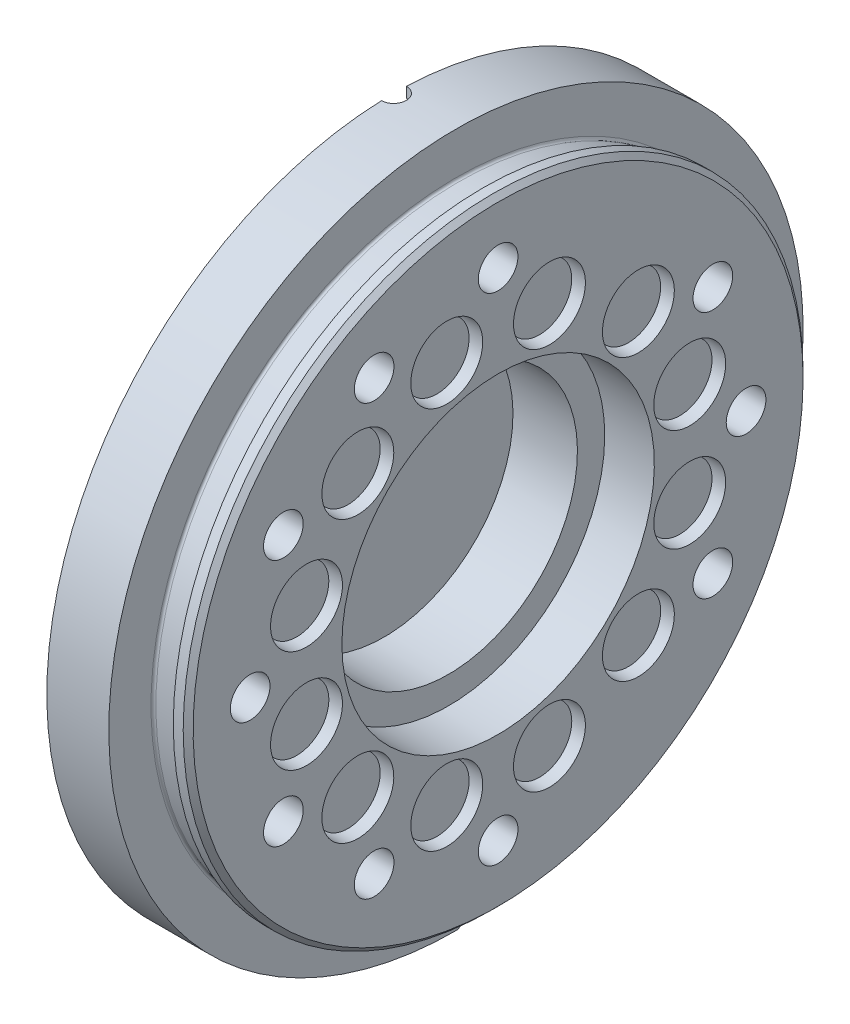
ISO-10303-21;
HEADER;
FILE_DESCRIPTION(('STEP AP214'),'2;1');
FILE_NAME('part.step','',(''),(''),'','','');
FILE_SCHEMA(('AUTOMOTIVE_DESIGN { 1 0 10303 214 1 1 1 1 }'));
ENDSEC;
DATA;
#1=APPLICATION_CONTEXT('core data for automotive mechanical design processes');
#2=APPLICATION_PROTOCOL_DEFINITION('international standard','automotive_design',2000,#1);
#3=PRODUCT_CONTEXT('',#1,'mechanical');
#4=PRODUCT('Part','Part','',(#3));
#5=PRODUCT_RELATED_PRODUCT_CATEGORY('part','',(#4));
#6=PRODUCT_DEFINITION_FORMATION('','',#4);
#7=PRODUCT_DEFINITION_CONTEXT('part definition',#1,'design');
#8=PRODUCT_DEFINITION('design','',#6,#7);
#9=PRODUCT_DEFINITION_SHAPE('','',#8);
#10=(LENGTH_UNIT() NAMED_UNIT(*) SI_UNIT(.MILLI.,.METRE.));
#11=(NAMED_UNIT(*) PLANE_ANGLE_UNIT() SI_UNIT($,.RADIAN.));
#12=(NAMED_UNIT(*) SI_UNIT($,.STERADIAN.) SOLID_ANGLE_UNIT());
#13=UNCERTAINTY_MEASURE_WITH_UNIT(LENGTH_MEASURE(1.E-05),#10,'distance_accuracy_value','');
#14=(GEOMETRIC_REPRESENTATION_CONTEXT(3) GLOBAL_UNCERTAINTY_ASSIGNED_CONTEXT((#13)) GLOBAL_UNIT_ASSIGNED_CONTEXT((#10,
#11,#12)) REPRESENTATION_CONTEXT('',''));
#15=CARTESIAN_POINT('',(0.,0.,0.));
#16=DIRECTION('',(0.,0.,1.));
#17=DIRECTION('',(1.,0.,0.));
#18=AXIS2_PLACEMENT_3D('',#15,#16,#17);
#19=CARTESIAN_POINT('',(1384.89999999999,-22.2738636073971,1619.27386360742));
#20=DIRECTION('',(-1.,4.71981357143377E-13,-4.71981357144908E-13));
#21=DIRECTION('',(6.67482436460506E-13,0.707106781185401,-0.707106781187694));
#22=AXIS2_PLACEMENT_3D('',#19,#20,#21);
#23=PLANE('',#22);
#24=CARTESIAN_POINT('',(1384.89999999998,2.80526157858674E-11,1647.));
#25=DIRECTION('',(-1.,4.71981357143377E-13,-4.71981357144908E-13));
#26=DIRECTION('',(-4.71981357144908E-13,0.,1.));
#27=AXIS2_PLACEMENT_3D('',#24,#25,#26);
#28=CIRCLE('',#27,4.);
#29=CARTESIAN_POINT('',(1384.89999999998,2.80526157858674E-11,1651.));
#30=VERTEX_POINT('',#29);
#31=EDGE_CURVE('E139',#30,#30,#28,.T.);
#32=ORIENTED_EDGE('',*,*,#31,.T.);
#33=EDGE_LOOP('',(#32));
#34=FACE_BOUND('',#33,.T.);
#35=CARTESIAN_POINT('',(1384.89999999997,-24.9999999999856,1640.30127018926));
#36=DIRECTION('',(-1.,4.71981357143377E-13,-4.71981357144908E-13));
#37=DIRECTION('',(-4.71981357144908E-13,0.,1.));
#38=AXIS2_PLACEMENT_3D('',#35,#36,#37);
#39=CIRCLE('',#38,4.);
#40=CARTESIAN_POINT('',(1384.89999999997,-24.9999999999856,1644.30127018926));
#41=VERTEX_POINT('',#40);
#42=EDGE_CURVE('E379',#41,#41,#39,.T.);
#43=ORIENTED_EDGE('',*,*,#42,.T.);
#44=EDGE_LOOP('',(#43));
#45=FACE_BOUND('',#44,.T.);
#46=CARTESIAN_POINT('',(1384.89999999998,-50.0000000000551,1597.00000000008));
#47=DIRECTION('',(-1.,4.71981357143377E-13,-4.71981357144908E-13));
#48=DIRECTION('',(-4.71981357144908E-13,0.,1.));
#49=AXIS2_PLACEMENT_3D('',#46,#47,#48);
#50=CIRCLE('',#49,4.);
#51=CARTESIAN_POINT('',(1384.89999999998,-50.0000000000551,1601.00000000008));
#52=VERTEX_POINT('',#51);
#53=EDGE_CURVE('E383',#52,#52,#50,.T.);
#54=ORIENTED_EDGE('',*,*,#53,.T.);
#55=EDGE_LOOP('',(#54));
#56=FACE_BOUND('',#55,.T.);
#57=CARTESIAN_POINT('',(1384.9,25.0000000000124,1640.30127018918));
#58=DIRECTION('',(-1.,4.71981357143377E-13,-4.71981357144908E-13));
#59=DIRECTION('',(-4.71981357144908E-13,0.,1.));
#60=AXIS2_PLACEMENT_3D('',#57,#58,#59);
#61=CIRCLE('',#60,4.);
#62=CARTESIAN_POINT('',(1384.9,25.0000000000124,1644.30127018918));
#63=VERTEX_POINT('',#62);
#64=EDGE_CURVE('E388',#63,#63,#61,.T.);
#65=ORIENTED_EDGE('',*,*,#64,.T.);
#66=EDGE_LOOP('',(#65));
#67=FACE_BOUND('',#66,.T.);
#68=CARTESIAN_POINT('',(1384.90000000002,-25.0000000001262,1553.69872981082));
#69=DIRECTION('',(-1.,4.71981357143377E-13,-4.71981357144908E-13));
#70=DIRECTION('',(-4.71981357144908E-13,0.,1.));
#71=AXIS2_PLACEMENT_3D('',#68,#69,#70);
#72=CIRCLE('',#71,4.);
#73=CARTESIAN_POINT('',(1384.90000000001,-25.0000000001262,1557.69872981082));
#74=VERTEX_POINT('',#73);
#75=EDGE_CURVE('E392',#74,#74,#72,.T.);
#76=ORIENTED_EDGE('',*,*,#75,.T.);
#77=EDGE_LOOP('',(#76));
#78=FACE_BOUND('',#77,.T.);
#79=CARTESIAN_POINT('',(1384.90000000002,43.301270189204,1621.99999999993));
#80=DIRECTION('',(-1.,4.71981357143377E-13,-4.71981357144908E-13));
#81=DIRECTION('',(-4.71981357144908E-13,0.,1.));
#82=AXIS2_PLACEMENT_3D('',#79,#80,#81);
#83=CIRCLE('',#82,4.);
#84=CARTESIAN_POINT('',(1384.90000000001,43.301270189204,1625.99999999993));
#85=VERTEX_POINT('',#84);
#86=EDGE_CURVE('E396',#85,#85,#83,.T.);
#87=ORIENTED_EDGE('',*,*,#86,.T.);
#88=EDGE_LOOP('',(#87));
#89=FACE_BOUND('',#88,.T.);
#90=CARTESIAN_POINT('',(1384.90000000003,-1.38106137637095E-10,1547.));
#91=DIRECTION('',(-1.,4.71981357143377E-13,-4.71981357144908E-13));
#92=DIRECTION('',(-4.71981357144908E-13,0.,1.));
#93=AXIS2_PLACEMENT_3D('',#90,#91,#92);
#94=CIRCLE('',#93,4.);
#95=CARTESIAN_POINT('',(1384.90000000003,-1.38106137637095E-10,1551.));
#96=VERTEX_POINT('',#95);
#97=EDGE_CURVE('E400',#96,#96,#94,.T.);
#98=ORIENTED_EDGE('',*,*,#97,.T.);
#99=EDGE_LOOP('',(#98));
#100=FACE_BOUND('',#99,.T.);
#101=CARTESIAN_POINT('',(1384.90000000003,49.9999999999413,1596.99999999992));
#102=DIRECTION('',(-1.,4.71981357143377E-13,-4.71981357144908E-13));
#103=DIRECTION('',(-4.71981357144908E-13,0.,1.));
#104=AXIS2_PLACEMENT_3D('',#101,#102,#103);
#105=CIRCLE('',#104,4.);
#106=CARTESIAN_POINT('',(1384.90000000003,49.9999999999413,1600.99999999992));
#107=VERTEX_POINT('',#106);
#108=EDGE_CURVE('E404',#107,#107,#105,.T.);
#109=ORIENTED_EDGE('',*,*,#108,.T.);
#110=EDGE_LOOP('',(#109));
#111=FACE_BOUND('',#110,.T.);
#112=CARTESIAN_POINT('',(1384.90000000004,24.9999999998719,1553.69872981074));
#113=DIRECTION('',(-1.,4.71981357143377E-13,-4.71981357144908E-13));
#114=DIRECTION('',(-4.71981357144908E-13,0.,1.));
#115=AXIS2_PLACEMENT_3D('',#112,#113,#114);
#116=CIRCLE('',#115,4.);
#117=CARTESIAN_POINT('',(1384.90000000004,24.9999999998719,1557.69872981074));
#118=VERTEX_POINT('',#117);
#119=EDGE_CURVE('E378',#118,#118,#116,.T.);
#120=ORIENTED_EDGE('',*,*,#119,.T.);
#121=EDGE_LOOP('',(#120));
#122=FACE_BOUND('',#121,.T.);
#123=CARTESIAN_POINT('',(1384.89999999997,-43.3012701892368,1622.00000000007));
#124=DIRECTION('',(-1.,4.71981357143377E-13,-4.71981357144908E-13));
#125=DIRECTION('',(-4.71981357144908E-13,0.,1.));
#126=AXIS2_PLACEMENT_3D('',#123,#124,#125);
#127=CIRCLE('',#126,4.);
#128=CARTESIAN_POINT('',(1384.89999999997,-43.3012701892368,1626.00000000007));
#129=VERTEX_POINT('',#128);
#130=EDGE_CURVE('E373',#129,#129,#127,.T.);
#131=ORIENTED_EDGE('',*,*,#130,.T.);
#132=EDGE_LOOP('',(#131));
#133=FACE_BOUND('',#132,.T.);
#134=CARTESIAN_POINT('',(1384.9,10.3527618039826,1558.36296694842));
#135=DIRECTION('',(-1.,6.44738523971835E-13,1.72757166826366E-13));
#136=DIRECTION('',(6.67482436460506E-13,0.965925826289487,0.258819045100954));
#137=AXIS2_PLACEMENT_3D('',#134,#135,#136);
#138=CIRCLE('',#137,7.25);
#139=CARTESIAN_POINT('',(1384.9,17.3557240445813,1560.2394050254));
#140=VERTEX_POINT('',#139);
#141=EDGE_CURVE('E437',#140,#140,#138,.T.);
#142=ORIENTED_EDGE('',*,*,#141,.T.);
#143=EDGE_LOOP('',(#142));
#144=FACE_BOUND('',#143,.T.);
#145=CARTESIAN_POINT('',(1384.9,28.28427124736,1568.71572875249));
#146=DIRECTION('',(-1.,4.71981357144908E-13,4.71981357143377E-13));
#147=DIRECTION('',(6.67482436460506E-13,0.707106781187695,0.7071067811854));
#148=AXIS2_PLACEMENT_3D('',#145,#146,#147);
#149=CIRCLE('',#148,7.25);
#150=CARTESIAN_POINT('',(1384.9,33.4107954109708,1573.84225291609));
#151=VERTEX_POINT('',#150);
#152=EDGE_CURVE('E441',#151,#151,#149,.T.);
#153=ORIENTED_EDGE('',*,*,#152,.T.);
#154=EDGE_LOOP('',(#153));
#155=FACE_BOUND('',#154,.T.);
#156=CARTESIAN_POINT('',(1384.9,38.6370330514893,1586.64723819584));
#157=DIRECTION('',(-1.,1.72757166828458E-13,6.44738523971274E-13));
#158=DIRECTION('',(6.67482436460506E-13,0.258819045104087,0.965925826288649));
#159=AXIS2_PLACEMENT_3D('',#156,#157,#158);
#160=CIRCLE('',#159,7.25);
#161=CARTESIAN_POINT('',(1384.9,40.513471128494,1593.65020043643));
#162=VERTEX_POINT('',#161);
#163=EDGE_CURVE('E445',#162,#162,#160,.T.);
#164=ORIENTED_EDGE('',*,*,#163,.T.);
#165=EDGE_LOOP('',(#164));
#166=FACE_BOUND('',#165,.T.);
#167=CARTESIAN_POINT('',(1384.9,38.6370330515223,1607.35276180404));
#168=DIRECTION('',(-1.,-1.72757166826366E-13,6.44738523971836E-13));
#169=DIRECTION('',(6.67482436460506E-13,-0.258819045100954,0.965925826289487));
#170=AXIS2_PLACEMENT_3D('',#167,#168,#169);
#171=CIRCLE('',#170,7.25);
#172=CARTESIAN_POINT('',(1384.9,36.7605949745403,1614.35572404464));
#173=VERTEX_POINT('',#172);
#174=EDGE_CURVE('E449',#173,#173,#171,.T.);
#175=ORIENTED_EDGE('',*,*,#174,.T.);
#176=EDGE_LOOP('',(#175));
#177=FACE_BOUND('',#176,.T.);
#178=CARTESIAN_POINT('',(1384.9,28.28427124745,1625.28427124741));
#179=DIRECTION('',(-1.,-4.71981357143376E-13,4.71981357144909E-13));
#180=DIRECTION('',(6.67482436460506E-13,-0.707106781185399,0.707106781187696));
#181=AXIS2_PLACEMENT_3D('',#178,#179,#180);
#182=CIRCLE('',#181,7.25);
#183=CARTESIAN_POINT('',(1384.9,23.1577470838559,1630.41079541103));
#184=VERTEX_POINT('',#183);
#185=EDGE_CURVE('E453',#184,#184,#182,.T.);
#186=ORIENTED_EDGE('',*,*,#185,.T.);
#187=EDGE_LOOP('',(#186));
#188=FACE_BOUND('',#187,.T.);
#189=CARTESIAN_POINT('',(1384.9,10.3527618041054,1635.63703305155));
#190=DIRECTION('',(-1.,-6.44738523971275E-13,1.7275716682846E-13));
#191=DIRECTION('',(6.67482436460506E-13,-0.96592582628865,0.258819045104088));
#192=AXIS2_PLACEMENT_3D('',#189,#190,#191);
#193=CIRCLE('',#192,7.25);
#194=CARTESIAN_POINT('',(1384.9,3.34979956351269,1637.51347112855));
#195=VERTEX_POINT('',#194);
#196=EDGE_CURVE('E457',#195,#195,#193,.T.);
#197=ORIENTED_EDGE('',*,*,#196,.T.);
#198=EDGE_LOOP('',(#197));
#199=FACE_BOUND('',#198,.T.);
#200=CARTESIAN_POINT('',(1384.9,-10.3527618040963,1635.63703305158));
#201=DIRECTION('',(-1.,-6.44738523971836E-13,-1.72757166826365E-13));
#202=DIRECTION('',(6.67482436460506E-13,-0.965925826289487,-0.258819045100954));
#203=AXIS2_PLACEMENT_3D('',#200,#201,#202);
#204=CIRCLE('',#203,7.25);
#205=CARTESIAN_POINT('',(1384.9,-17.355724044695,1633.7605949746));
#206=VERTEX_POINT('',#205);
#207=EDGE_CURVE('E461',#206,#206,#204,.T.);
#208=ORIENTED_EDGE('',*,*,#207,.T.);
#209=EDGE_LOOP('',(#208));
#210=FACE_BOUND('',#209,.T.);
#211=CARTESIAN_POINT('',(1384.9,-28.2842712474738,1625.2842712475));
#212=DIRECTION('',(-1.,-4.7198135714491E-13,-4.71981357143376E-13));
#213=DIRECTION('',(6.67482436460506E-13,-0.707106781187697,-0.707106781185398));
#214=AXIS2_PLACEMENT_3D('',#211,#212,#213);
#215=CIRCLE('',#214,7.25);
#216=CARTESIAN_POINT('',(1384.9,-33.4107954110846,1620.15774708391));
#217=VERTEX_POINT('',#216);
#218=EDGE_CURVE('E465',#217,#217,#215,.T.);
#219=ORIENTED_EDGE('',*,*,#218,.T.);
#220=EDGE_LOOP('',(#219));
#221=FACE_BOUND('',#220,.T.);
#222=CARTESIAN_POINT('',(1384.9,-38.6370330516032,1607.35276180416));
#223=DIRECTION('',(-1.,-1.7275716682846E-13,-6.44738523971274E-13));
#224=DIRECTION('',(6.67482436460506E-13,-0.258819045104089,-0.96592582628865));
#225=AXIS2_PLACEMENT_3D('',#222,#223,#224);
#226=CIRCLE('',#225,7.25);
#227=CARTESIAN_POINT('',(1384.9,-40.5134711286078,1600.34979956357));
#228=VERTEX_POINT('',#227);
#229=EDGE_CURVE('E469',#228,#228,#226,.T.);
#230=ORIENTED_EDGE('',*,*,#229,.T.);
#231=EDGE_LOOP('',(#230));
#232=FACE_BOUND('',#231,.T.);
#233=CARTESIAN_POINT('',(1384.9,-38.6370330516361,1586.64723819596));
#234=DIRECTION('',(-1.,1.72757166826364E-13,-6.44738523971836E-13));
#235=DIRECTION('',(6.67482436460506E-13,0.258819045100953,-0.965925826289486));
#236=AXIS2_PLACEMENT_3D('',#233,#234,#235);
#237=CIRCLE('',#236,7.25);
#238=CARTESIAN_POINT('',(1384.9,-36.7605949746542,1579.64427595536));
#239=VERTEX_POINT('',#238);
#240=EDGE_CURVE('E377',#239,#239,#237,.T.);
#241=ORIENTED_EDGE('',*,*,#240,.T.);
#242=EDGE_LOOP('',(#241));
#243=FACE_BOUND('',#242,.T.);
#244=CARTESIAN_POINT('',(1384.9,-10.3527618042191,1558.36296694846));
#245=DIRECTION('',(-1.,6.44738523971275E-13,-1.72757166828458E-13));
#246=DIRECTION('',(6.67482436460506E-13,0.965925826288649,-0.258819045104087));
#247=AXIS2_PLACEMENT_3D('',#244,#245,#246);
#248=CIRCLE('',#247,7.25);
#249=CARTESIAN_POINT('',(1384.9,-3.3497995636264,1556.48652887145));
#250=VERTEX_POINT('',#249);
#251=EDGE_CURVE('E476',#250,#250,#248,.T.);
#252=ORIENTED_EDGE('',*,*,#251,.T.);
#253=EDGE_LOOP('',(#252));
#254=FACE_BOUND('',#253,.T.);
#255=CARTESIAN_POINT('',(1384.9,-28.2842712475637,1568.71572875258));
#256=DIRECTION('',(-1.,4.71981357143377E-13,-4.71981357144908E-13));
#257=DIRECTION('',(6.67482436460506E-13,0.707106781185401,-0.707106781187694));
#258=AXIS2_PLACEMENT_3D('',#255,#256,#257);
#259=CIRCLE('',#258,7.25);
#260=CARTESIAN_POINT('',(1384.9,-23.1577470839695,1563.58920458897));
#261=VERTEX_POINT('',#260);
#262=EDGE_CURVE('E287',#261,#261,#259,.T.);
#263=ORIENTED_EDGE('',*,*,#262,.T.);
#264=EDGE_LOOP('',(#263));
#265=FACE_BOUND('',#264,.T.);
#266=CARTESIAN_POINT('',(1384.9,-5.59564186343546E-11,1597.));
#267=DIRECTION('',(-1.,4.71981357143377E-13,-4.71981357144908E-13));
#268=DIRECTION('',(6.67482436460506E-13,0.707106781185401,-0.707106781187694));
#269=AXIS2_PLACEMENT_3D('',#266,#267,#268);
#270=CIRCLE('',#269,61.5000000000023);
#271=CARTESIAN_POINT('',(1384.90000000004,43.4870670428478,1553.51293295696));
#272=VERTEX_POINT('',#271);
#273=EDGE_CURVE('E305',#272,#272,#270,.F.);
#274=ORIENTED_EDGE('',*,*,#273,.T.);
#275=EDGE_LOOP('',(#274));
#276=FACE_BOUND('',#275,.T.);
#277=CARTESIAN_POINT('',(1384.9,-5.59564186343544E-11,1597.));
#278=DIRECTION('',(-1.,4.71981357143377E-13,-4.71981357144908E-13));
#279=DIRECTION('',(-4.71981357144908E-13,0.,1.));
#280=AXIS2_PLACEMENT_3D('',#277,#278,#279);
#281=CIRCLE('',#280,31.5000000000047);
#282=CARTESIAN_POINT('',(1384.89999999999,-5.59564186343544E-11,1628.5));
#283=VERTEX_POINT('',#282);
#284=EDGE_CURVE('E11',#283,#283,#281,.T.);
#285=ORIENTED_EDGE('',*,*,#284,.T.);
#286=EDGE_LOOP('',(#285));
#287=FACE_BOUND('',#286,.T.);
#288=ADVANCED_FACE('F18',(#34,#45,#56,#67,#78,#89,#100,#111,#122,#133,#144,#155,#166,#177,#188,
#199,#210,#221,#232,#243,#254,#265,#276,#287),#23,.F.);
#289=CARTESIAN_POINT('',(1386.89999999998,-5.69003813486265E-11,1597.));
#290=DIRECTION('',(-1.,4.71981357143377E-13,-4.71981357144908E-13));
#291=DIRECTION('',(6.67482436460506E-13,0.707106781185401,-0.707106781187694));
#292=AXIS2_PLACEMENT_3D('',#289,#290,#291);
#293=CYLINDRICAL_SURFACE('',#292,70.0000000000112);
#294=CARTESIAN_POINT('',(1363.90000000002,69.9553428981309,1599.5));
#295=CARTESIAN_POINT('',(1363.97029088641,69.9553418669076,1599.50000676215));
#296=CARTESIAN_POINT('',(1364.04057854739,69.9554488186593,1599.49703554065));
#297=CARTESIAN_POINT('',(1364.18065056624,69.9558710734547,1599.48518946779));
#298=CARTESIAN_POINT('',(1364.25043494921,69.9561863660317,1599.47631491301));
#299=CARTESIAN_POINT('',(1364.38896021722,69.9570173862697,1599.45272310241));
#300=CARTESIAN_POINT('',(1364.45770182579,69.9575329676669,1599.43801011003));
#301=CARTESIAN_POINT('',(1364.59368364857,69.9587490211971,1599.4028611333));
#302=CARTESIAN_POINT('',(1364.66092388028,69.9594494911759,1599.38242521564));
#303=CARTESIAN_POINT('',(1364.8597402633,69.9618011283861,1599.31270005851));
#304=CARTESIAN_POINT('',(1364.9884723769,69.9637029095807,1599.25498309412));
#305=CARTESIAN_POINT('',(1365.2343239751,69.9679587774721,1599.1188090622));
#306=CARTESIAN_POINT('',(1365.3514456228,69.9703127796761,1599.04035586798));
#307=CARTESIAN_POINT('',(1365.57092862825,69.9752095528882,1598.86486871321));
#308=CARTESIAN_POINT('',(1365.67328377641,69.9777524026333,1598.76782697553));
#309=CARTESIAN_POINT('',(1365.86026367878,69.9827397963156,1598.55792457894));
#310=CARTESIAN_POINT('',(1365.94488573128,69.9851843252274,1598.44506151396));
#311=CARTESIAN_POINT('',(1366.09400232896,69.9896997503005,1598.2066979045));
#312=CARTESIAN_POINT('',(1366.15849237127,69.99177056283,1598.08119454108));
#313=CARTESIAN_POINT('',(1366.26547967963,69.9953042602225,1597.82114151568));
#314=CARTESIAN_POINT('',(1366.30797840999,69.9967671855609,1597.68659245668));
#315=CARTESIAN_POINT('',(1366.36976634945,69.9989198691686,1597.41231885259));
#316=CARTESIAN_POINT('',(1366.38906510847,69.9996099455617,1597.27259646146));
#317=CARTESIAN_POINT('',(1366.40393467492,70.0001402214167,1596.99189014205));
#318=CARTESIAN_POINT('',(1366.39950501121,69.9999804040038,1596.85090618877));
#319=CARTESIAN_POINT('',(1366.36705069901,69.9988291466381,1596.57175129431));
#320=CARTESIAN_POINT('',(1366.33903705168,69.9978380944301,1596.43357907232));
#321=CARTESIAN_POINT('',(1366.26022707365,69.9951365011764,1596.16390039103));
#322=CARTESIAN_POINT('',(1366.20943078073,69.9934259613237,1596.03239392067));
#323=CARTESIAN_POINT('',(1366.08648367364,69.9894774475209,1595.77974108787));
#324=CARTESIAN_POINT('',(1366.01432737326,69.9872393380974,1595.65859739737));
#325=CARTESIAN_POINT('',(1365.85071603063,69.9824880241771,1595.43014477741));
#326=CARTESIAN_POINT('',(1365.75926185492,69.9799748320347,1595.32283522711));
#327=CARTESIAN_POINT('',(1365.5596036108,69.9749551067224,1595.12504064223));
#328=CARTESIAN_POINT('',(1365.45139244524,69.9724485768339,1595.03456277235));
#329=CARTESIAN_POINT('',(1365.22126935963,69.9677250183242,1594.87302789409));
#330=CARTESIAN_POINT('',(1365.09935312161,69.9655080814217,1594.8019770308));
#331=CARTESIAN_POINT('',(1364.84526099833,69.9616135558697,1594.68131727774));
#332=CARTESIAN_POINT('',(1364.71307879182,69.9599363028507,1594.63172172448));
#333=CARTESIAN_POINT('',(1364.44235915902,69.957314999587,1594.55550484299));
#334=CARTESIAN_POINT('',(1364.30383176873,69.9563698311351,1594.52884846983));
#335=CARTESIAN_POINT('',(1364.12031475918,69.9556758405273,1594.50933260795));
#336=CARTESIAN_POINT('',(1364.07628589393,69.9555510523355,1594.50583104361));
#337=CARTESIAN_POINT('',(1363.98817731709,69.9553846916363,1594.50116793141));
#338=CARTESIAN_POINT('',(1363.94409781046,69.9553429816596,1594.50000251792));
#339=CARTESIAN_POINT('',(1363.90000000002,69.9553428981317,1594.5));
#340=B_SPLINE_CURVE_WITH_KNOTS('',3,(#294,#295,#296,#297,#298,#299,#300,#301,#302,#303,#304,
#305,#306,#307,#308,#309,#310,#311,#312,#313,#314,#315,#316,#317,#318,#319,#320,#321,#322,#323,
#324,#325,#326,#327,#328,#329,#330,#331,#332,#333,#334,#335,#336,#337,#338,#339),.UNSPECIFIED.,
.F.,.F.,(4,2,2,2,2,2,2,2,2,2,2,2,2,2,2,2,2,2,2,2,2,2,4),(0.,0.210803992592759,0.421597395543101,
0.632237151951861,0.842874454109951,1.26396791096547,1.68498276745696,2.1061741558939,
2.5274296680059,2.94877933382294,3.37010094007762,3.79124905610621,4.21240553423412,
4.63336566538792,5.05432509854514,5.47539274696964,5.89644149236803,6.3176690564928,
6.73902970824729,7.16065190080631,7.5816288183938,7.71408959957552,7.84633101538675),.UNSPECIFIED.);
#341=CARTESIAN_POINT('',(1363.90000000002,69.9553428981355,1599.5));
#342=VERTEX_POINT('',#341);
#343=CARTESIAN_POINT('',(1363.90000000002,69.9553428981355,1594.5));
#344=VERTEX_POINT('',#343);
#345=EDGE_CURVE('E115',#342,#344,#340,.T.);
#346=ORIENTED_EDGE('',*,*,#345,.F.);
#347=CARTESIAN_POINT('',(1363.90000000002,-4.60448101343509E-11,1597.));
#348=DIRECTION('',(-1.,4.71981357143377E-13,-4.71981357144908E-13));
#349=DIRECTION('',(6.67482436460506E-13,0.707106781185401,-0.707106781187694));
#350=AXIS2_PLACEMENT_3D('',#347,#348,#349);
#351=CIRCLE('',#350,70.0000000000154);
#352=CARTESIAN_POINT('',(1363.9,-69.9986848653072,1596.57091127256));
#353=VERTEX_POINT('',#352);
#354=EDGE_CURVE('E113',#353,#342,#351,.T.);
#355=ORIENTED_EDGE('',*,*,#354,.F.);
#356=DIRECTION('',(-1.,0.,0.));
#357=VECTOR('',#356,1.);
#358=CARTESIAN_POINT('',(1373.4,-69.9986848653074,1596.57091127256));
#359=LINE('',#358,#357);
#360=CARTESIAN_POINT('',(1376.4,-69.9986848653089,1596.57091127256));
#361=VERTEX_POINT('',#360);
#362=EDGE_CURVE('E847',#353,#361,#359,.F.);
#363=ORIENTED_EDGE('',*,*,#362,.T.);
#364=CARTESIAN_POINT('',(1376.40000000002,-5.19445770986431E-11,1597.));
#365=DIRECTION('',(-1.,4.71981357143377E-13,-4.71981357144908E-13));
#366=DIRECTION('',(6.67482436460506E-13,0.707106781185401,-0.707106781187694));
#367=AXIS2_PLACEMENT_3D('',#364,#365,#366);
#368=CIRCLE('',#367,70.000000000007);
#369=CARTESIAN_POINT('',(1376.4,-69.8581033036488,1592.54518206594));
#370=VERTEX_POINT('',#369);
#371=EDGE_CURVE('E293',#361,#370,#368,.T.);
#372=ORIENTED_EDGE('',*,*,#371,.T.);
#373=DIRECTION('',(-1.,0.,0.));
#374=VECTOR('',#373,1.);
#375=CARTESIAN_POINT('',(1373.40000000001,-69.8581033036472,1592.54518206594));
#376=LINE('',#375,#374);
#377=CARTESIAN_POINT('',(1363.9,-69.8581033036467,1592.54518206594));
#378=VERTEX_POINT('',#377);
#379=EDGE_CURVE('E859',#370,#378,#376,.T.);
#380=ORIENTED_EDGE('',*,*,#379,.T.);
#381=EDGE_CURVE('E284',#344,#378,#351,.T.);
#382=ORIENTED_EDGE('',*,*,#381,.F.);
#383=EDGE_LOOP('',(#346,#355,#363,#372,#380,#382));
#384=FACE_BOUND('',#383,.T.);
#385=ADVANCED_FACE('F173',(#384),#293,.T.);
#386=CARTESIAN_POINT('',(1363.89999999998,-49.497474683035,1646.49747468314));
#387=DIRECTION('',(1.,-4.71981357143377E-13,4.71981357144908E-13));
#388=DIRECTION('',(-6.67482436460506E-13,-0.707106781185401,0.707106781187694));
#389=AXIS2_PLACEMENT_3D('',#386,#387,#388);
#390=PLANE('',#389);
#391=DIRECTION('',(0.,-1.,0.));
#392=VECTOR('',#391,1.);
#393=CARTESIAN_POINT('',(1363.90000000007,99.9999999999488,1599.5));
#394=LINE('',#393,#392);
#395=CARTESIAN_POINT('',(1363.90000000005,67.8539608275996,1599.5));
#396=VERTEX_POINT('',#395);
#397=EDGE_CURVE('E99',#396,#342,#394,.F.);
#398=ORIENTED_EDGE('',*,*,#397,.F.);
#399=CARTESIAN_POINT('',(1363.90000000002,-4.85204731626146E-11,1597.));
#400=DIRECTION('',(1.,-4.71981357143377E-13,4.71981357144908E-13));
#401=DIRECTION('',(4.71981357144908E-13,0.,-1.));
#402=AXIS2_PLACEMENT_3D('',#399,#400,#401);
#403=CIRCLE('',#402,67.9);
#404=CARTESIAN_POINT('',(1363.90000000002,67.8539608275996,1594.5));
#405=VERTEX_POINT('',#404);
#406=EDGE_CURVE('E110',#396,#405,#403,.T.);
#407=ORIENTED_EDGE('',*,*,#406,.T.);
#408=DIRECTION('',(0.,-1.,0.));
#409=VECTOR('',#408,1.);
#410=CARTESIAN_POINT('',(1363.90000000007,99.9999999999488,1594.5));
#411=LINE('',#410,#409);
#412=EDGE_CURVE('E37',#344,#405,#411,.T.);
#413=ORIENTED_EDGE('',*,*,#412,.F.);
#414=ORIENTED_EDGE('',*,*,#381,.T.);
#415=CARTESIAN_POINT('',(1363.9,-71.020769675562,1593.64436672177));
#416=DIRECTION('',(1.,-4.71981357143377E-13,4.71981357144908E-13));
#417=DIRECTION('',(4.71981357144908E-13,0.,-1.));
#418=AXIS2_PLACEMENT_3D('',#415,#416,#417);
#419=CIRCLE('',#418,1.6);
#420=CARTESIAN_POINT('',(1363.9,-69.4225526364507,1593.71988026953));
#421=VERTEX_POINT('',#420);
#422=EDGE_CURVE('E134',#378,#421,#419,.T.);
#423=ORIENTED_EDGE('',*,*,#422,.T.);
#424=CARTESIAN_POINT('',(1363.90000000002,-5.06261699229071E-11,1597.));
#425=DIRECTION('',(1.,-4.71981357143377E-13,4.71981357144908E-13));
#426=DIRECTION('',(4.71981357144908E-13,0.,-1.));
#427=AXIS2_PLACEMENT_3D('',#424,#425,#426);
#428=CIRCLE('',#427,69.5);
#429=CARTESIAN_POINT('',(1363.90000000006,-69.4822523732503,1595.42945705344));
#430=VERTEX_POINT('',#429);
#431=EDGE_CURVE('E138',#421,#430,#428,.F.);
#432=ORIENTED_EDGE('',*,*,#431,.T.);
#433=CARTESIAN_POINT('',(1363.9,-71.0818437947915,1595.39330066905));
#434=DIRECTION('',(1.,-4.71981357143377E-13,4.71981357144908E-13));
#435=DIRECTION('',(4.71981357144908E-13,0.,-1.));
#436=AXIS2_PLACEMENT_3D('',#433,#434,#435);
#437=CIRCLE('',#436,1.6);
#438=EDGE_CURVE('E105',#430,#353,#437,.T.);
#439=ORIENTED_EDGE('',*,*,#438,.T.);
#440=ORIENTED_EDGE('',*,*,#354,.T.);
#441=EDGE_LOOP('',(#398,#407,#413,#414,#423,#432,#439,#440));
#442=FACE_BOUND('',#441,.T.);
#443=ADVANCED_FACE('F109',(#442),#390,.F.);
#444=CARTESIAN_POINT('',(1359.63,-4.7256394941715E-11,1597.));
#445=DIRECTION('',(1.,-2.96037054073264E-13,0.));
#446=DIRECTION('',(-1.0451264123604E-13,-0.342020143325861,-0.939692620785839));
#447=AXIS2_PLACEMENT_3D('',#444,#445,#446);
#448=CYLINDRICAL_SURFACE('',#447,67.9);
#449=CARTESIAN_POINT('',(1367.9,3.57120976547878E-10,1597.));
#450=DIRECTION('',(-1.,2.96284861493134E-13,0.));
#451=DIRECTION('',(-2.96284861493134E-13,-1.,0.));
#452=AXIS2_PLACEMENT_3D('',#449,#450,#451);
#453=CIRCLE('',#452,67.9);
#454=CARTESIAN_POINT('',(1367.89999999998,-67.8999999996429,1597.));
#455=VERTEX_POINT('',#454);
#456=EDGE_CURVE('E120',#455,#455,#453,.F.);
#457=ORIENTED_EDGE('',*,*,#456,.T.);
#458=EDGE_LOOP('',(#457));
#459=FACE_BOUND('',#458,.T.);
#460=CARTESIAN_POINT('',(1363.90000000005,67.8539608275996,1594.5));
#461=CARTESIAN_POINT('',(1363.97028939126,67.8539597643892,1594.4999932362));
#462=CARTESIAN_POINT('',(1364.04057555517,67.8540700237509,1594.50296433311));
#463=CARTESIAN_POINT('',(1364.18064456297,67.85450533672,1594.51480989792));
#464=CARTESIAN_POINT('',(1364.25042743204,67.8548303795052,1594.52368406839));
#465=CARTESIAN_POINT('',(1364.38894955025,67.8556870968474,1594.54727481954));
#466=CARTESIAN_POINT('',(1364.45768952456,67.8562186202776,1594.56198712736));
#467=CARTESIAN_POINT('',(1364.59366809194,67.8574722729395,1594.59713442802));
#468=CARTESIAN_POINT('',(1364.66090670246,67.8581943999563,1594.61756935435));
#469=CARTESIAN_POINT('',(1364.859718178,67.8606187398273,1594.68729101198));
#470=CARTESIAN_POINT('',(1364.98844706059,67.8625793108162,1594.74500495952));
#471=CARTESIAN_POINT('',(1365.23429286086,67.8669667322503,1594.88117162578));
#472=CARTESIAN_POINT('',(1365.35141193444,67.8693934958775,1594.95962048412));
#473=CARTESIAN_POINT('',(1365.5708936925,67.8744416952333,1595.13510006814));
#474=CARTESIAN_POINT('',(1365.6732497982,67.8770632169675,1595.2321390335));
#475=CARTESIAN_POINT('',(1365.86023230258,67.8822049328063,1595.44203604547));
#476=CARTESIAN_POINT('',(1365.94485599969,67.8847251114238,1595.55489649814));
#477=CARTESIAN_POINT('',(1366.09397788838,67.8893803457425,1595.79325749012));
#478=CARTESIAN_POINT('',(1366.15847123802,67.8915153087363,1595.91876106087));
#479=CARTESIAN_POINT('',(1366.26546490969,67.8951585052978,1596.17881561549));
#480=CARTESIAN_POINT('',(1366.30796669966,67.8966667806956,1596.31336599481));
#481=CARTESIAN_POINT('',(1366.36975930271,67.8988862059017,1596.58763944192));
#482=CARTESIAN_POINT('',(1366.38906029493,67.8995977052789,1596.7273602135));
#483=CARTESIAN_POINT('',(1366.4039347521,67.9001445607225,1597.00806378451));
#484=CARTESIAN_POINT('',(1366.39950775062,67.8999798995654,1597.1490466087));
#485=CARTESIAN_POINT('',(1366.36705962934,67.8987932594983,1597.42819551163));
#486=CARTESIAN_POINT('',(1366.33905018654,67.8977717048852,1597.56636294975));
#487=CARTESIAN_POINT('',(1366.26025041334,67.8949868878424,1597.83603276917));
#488=CARTESIAN_POINT('',(1366.20946011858,67.8932236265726,1597.96753516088));
#489=CARTESIAN_POINT('',(1366.08652586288,67.8891533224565,1598.22018284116));
#490=CARTESIAN_POINT('',(1366.01437610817,67.8868461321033,1598.34132530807));
#491=CARTESIAN_POINT('',(1365.85077874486,67.8819480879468,1598.56977689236));
#492=CARTESIAN_POINT('',(1365.75933199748,67.8793572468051,1598.67708662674));
#493=CARTESIAN_POINT('',(1365.55968546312,67.8741822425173,1598.87488692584));
#494=CARTESIAN_POINT('',(1365.45147799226,67.8715980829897,1598.96536973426));
#495=CARTESIAN_POINT('',(1365.22136112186,67.8667281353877,1599.12691513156));
#496=CARTESIAN_POINT('',(1365.09944740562,67.8644424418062,1599.1979715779));
#497=CARTESIAN_POINT('',(1364.84535871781,67.8604270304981,1599.31864294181));
#498=CARTESIAN_POINT('',(1364.71317741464,67.8586976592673,1599.36824450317));
#499=CARTESIAN_POINT('',(1364.4424580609,67.855994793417,1599.44447329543));
#500=CARTESIAN_POINT('',(1364.30393004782,67.8550201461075,1599.47113556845));
#501=CARTESIAN_POINT('',(1364.12039580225,67.8543043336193,1599.49066051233));
#502=CARTESIAN_POINT('',(1364.07635079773,67.8541755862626,1599.49416465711));
#503=CARTESIAN_POINT('',(1363.98820983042,67.8540039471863,1599.49883120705));
#504=CARTESIAN_POINT('',(1363.94411407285,67.8539609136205,1599.49999748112));
#505=CARTESIAN_POINT('',(1363.90000000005,67.8539608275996,1599.5));
#506=B_SPLINE_CURVE_WITH_KNOTS('',3,(#460,#461,#462,#463,#464,#465,#466,#467,#468,#469,#470,
#471,#472,#473,#474,#475,#476,#477,#478,#479,#480,#481,#482,#483,#484,#485,#486,#487,#488,#489,
#490,#491,#492,#493,#494,#495,#496,#497,#498,#499,#500,#501,#502,#503,#504,#505),.UNSPECIFIED.,
.F.,.F.,(4,2,2,2,2,2,2,2,2,2,2,2,2,2,2,2,2,2,2,2,2,2,4),(0.,0.210799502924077,0.421588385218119,
0.63222327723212,0.842855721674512,1.2639391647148,1.6849442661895,2.10613640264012,
2.52739266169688,2.94875016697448,3.37007954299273,3.79122399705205,4.21237673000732,
4.63332104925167,5.05426471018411,5.47532265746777,5.89636181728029,6.3175945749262,
6.73896037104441,7.16058810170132,7.58157060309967,7.71408023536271,7.84637039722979),.UNSPECIFIED.);
#507=EDGE_CURVE('E29',#405,#396,#506,.T.);
#508=ORIENTED_EDGE('',*,*,#507,.F.);
#509=ORIENTED_EDGE('',*,*,#406,.F.);
#510=EDGE_LOOP('',(#508,#509));
#511=FACE_BOUND('',#510,.T.);
#512=ADVANCED_FACE('F117',(#459,#511),#448,.F.);
#513=CARTESIAN_POINT('',(1376.90000000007,2.80526157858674E-11,1647.));
#514=DIRECTION('',(-1.,0.,0.));
#515=DIRECTION('',(0.,0.,1.));
#516=AXIS2_PLACEMENT_3D('',#513,#514,#515);
#517=PLANE('',#516);
#518=CARTESIAN_POINT('',(1376.90000000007,2.80526157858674E-11,1647.));
#519=DIRECTION('',(-1.,0.,0.));
#520=DIRECTION('',(0.,0.707106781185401,-0.707106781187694));
#521=AXIS2_PLACEMENT_3D('',#518,#519,#520);
#522=CIRCLE('',#521,4.);
#523=CARTESIAN_POINT('',(1376.90000000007,2.82842712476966,1644.17157287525));
#524=VERTEX_POINT('',#523);
#525=EDGE_CURVE('E384',#524,#524,#522,.F.);
#526=ORIENTED_EDGE('',*,*,#525,.T.);
#527=EDGE_LOOP('',(#526));
#528=FACE_BOUND('',#527,.T.);
#529=ADVANCED_FACE('F196',(#528),#517,.F.);
#530=CARTESIAN_POINT('',(1386.89999999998,-5.69003813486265E-11,1597.));
#531=DIRECTION('',(-1.,4.71981357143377E-13,-4.71981357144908E-13));
#532=DIRECTION('',(6.67482436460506E-13,0.707106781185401,-0.707106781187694));
#533=AXIS2_PLACEMENT_3D('',#530,#531,#532);
#534=CYLINDRICAL_SURFACE('',#533,62.5000000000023);
#535=CARTESIAN_POINT('',(1383.9,-5.54844372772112E-11,1597.));
#536=DIRECTION('',(-1.,4.71981357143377E-13,-4.71981357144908E-13));
#537=DIRECTION('',(6.67482436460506E-13,0.707106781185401,-0.707106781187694));
#538=AXIS2_PLACEMENT_3D('',#535,#536,#537);
#539=CIRCLE('',#538,62.5000000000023);
#540=CARTESIAN_POINT('',(1383.90000000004,44.1941738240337,1552.80582617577));
#541=VERTEX_POINT('',#540);
#542=EDGE_CURVE('E301',#541,#541,#539,.T.);
#543=ORIENTED_EDGE('',*,*,#542,.T.);
#544=EDGE_LOOP('',(#543));
#545=FACE_BOUND('',#544,.T.);
#546=CARTESIAN_POINT('',(1381.90000000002,-5.45404745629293E-11,1597.));
#547=DIRECTION('',(-1.,4.71981357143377E-13,-4.71981357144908E-13));
#548=DIRECTION('',(6.67482436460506E-13,0.707106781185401,-0.707106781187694));
#549=AXIS2_PLACEMENT_3D('',#546,#547,#548);
#550=CIRCLE('',#549,62.5000000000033);
#551=CARTESIAN_POINT('',(1381.90000000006,44.1941738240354,1552.80582617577));
#552=VERTEX_POINT('',#551);
#553=EDGE_CURVE('E297',#552,#552,#550,.T.);
#554=ORIENTED_EDGE('',*,*,#553,.F.);
#555=EDGE_LOOP('',(#554));
#556=FACE_BOUND('',#555,.T.);
#557=ADVANCED_FACE('F192',(#545,#556),#534,.T.);
#558=CARTESIAN_POINT('',(1381.89999999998,-44.1941738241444,1641.19417382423));
#559=DIRECTION('',(1.,-4.71981357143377E-13,4.71981357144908E-13));
#560=DIRECTION('',(-6.67482436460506E-13,-0.707106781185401,0.707106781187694));
#561=AXIS2_PLACEMENT_3D('',#558,#559,#560);
#562=PLANE('',#561);
#563=CARTESIAN_POINT('',(1381.90000000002,-5.45404745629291E-11,1597.));
#564=DIRECTION('',(1.,-4.71981357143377E-13,4.71981357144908E-13));
#565=DIRECTION('',(-6.67482436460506E-13,-0.707106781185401,0.707106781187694));
#566=AXIS2_PLACEMENT_3D('',#563,#564,#565);
#567=CIRCLE('',#566,61.5000000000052);
#568=CARTESIAN_POINT('',(1381.89999999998,-43.4870670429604,1640.48706704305));
#569=VERTEX_POINT('',#568);
#570=EDGE_CURVE('E317',#569,#569,#567,.T.);
#571=ORIENTED_EDGE('',*,*,#570,.T.);
#572=EDGE_LOOP('',(#571));
#573=FACE_BOUND('',#572,.T.);
#574=ORIENTED_EDGE('',*,*,#553,.T.);
#575=EDGE_LOOP('',(#574));
#576=FACE_BOUND('',#575,.T.);
#577=ADVANCED_FACE('F188',(#573,#576),#562,.F.);
#578=CARTESIAN_POINT('',(1386.89999999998,-5.69003813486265E-11,1597.));
#579=DIRECTION('',(-1.,4.71981357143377E-13,-4.71981357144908E-13));
#580=DIRECTION('',(6.67482436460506E-13,0.707106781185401,-0.707106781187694));
#581=AXIS2_PLACEMENT_3D('',#578,#579,#580);
#582=CYLINDRICAL_SURFACE('',#581,61.0000000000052);
#583=CARTESIAN_POINT('',(1381.40000000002,-5.43044838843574E-11,1597.));
#584=DIRECTION('',(1.,-4.71981357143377E-13,4.71981357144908E-13));
#585=DIRECTION('',(-6.67482436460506E-13,-0.707106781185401,0.707106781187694));
#586=AXIS2_PLACEMENT_3D('',#583,#584,#585);
#587=CIRCLE('',#586,61.0000000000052);
#588=CARTESIAN_POINT('',(1381.39999999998,-43.1335136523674,1640.13351365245));
#589=VERTEX_POINT('',#588);
#590=EDGE_CURVE('E313',#589,#589,#587,.F.);
#591=ORIENTED_EDGE('',*,*,#590,.T.);
#592=EDGE_LOOP('',(#591));
#593=FACE_BOUND('',#592,.T.);
#594=CARTESIAN_POINT('',(1376.90000000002,-5.21805677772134E-11,1597.));
#595=DIRECTION('',(-1.,4.71981357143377E-13,-4.71981357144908E-13));
#596=DIRECTION('',(6.67482436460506E-13,0.707106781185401,-0.707106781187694));
#597=AXIS2_PLACEMENT_3D('',#594,#595,#596);
#598=CIRCLE('',#597,61.0000000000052);
#599=CARTESIAN_POINT('',(1376.90000000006,43.133513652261,1553.86648634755));
#600=VERTEX_POINT('',#599);
#601=EDGE_CURVE('E309',#600,#600,#598,.F.);
#602=ORIENTED_EDGE('',*,*,#601,.T.);
#603=EDGE_LOOP('',(#602));
#604=FACE_BOUND('',#603,.T.);
#605=ADVANCED_FACE('F184',(#593,#604),#582,.T.);
#606=CARTESIAN_POINT('',(1376.39999999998,-43.1335136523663,1640.13351365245));
#607=DIRECTION('',(-1.,4.71981357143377E-13,-4.71981357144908E-13));
#608=DIRECTION('',(6.67482436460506E-13,0.707106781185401,-0.707106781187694));
#609=AXIS2_PLACEMENT_3D('',#606,#607,#608);
#610=PLANE('',#609);
#611=CARTESIAN_POINT('',(1376.40000000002,-5.19445770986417E-11,1597.));
#612=DIRECTION('',(-1.,4.71981357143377E-13,-4.71981357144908E-13));
#613=DIRECTION('',(6.67482436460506E-13,0.707106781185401,-0.707106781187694));
#614=AXIS2_PLACEMENT_3D('',#611,#612,#613);
#615=CIRCLE('',#614,61.5000000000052);
#616=CARTESIAN_POINT('',(1376.40000000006,43.4870670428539,1553.51293295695));
#617=VERTEX_POINT('',#616);
#618=EDGE_CURVE('E321',#617,#617,#615,.T.);
#619=ORIENTED_EDGE('',*,*,#618,.T.);
#620=EDGE_LOOP('',(#619));
#621=FACE_BOUND('',#620,.T.);
#622=ORIENTED_EDGE('',*,*,#371,.F.);
#623=CARTESIAN_POINT('',(1376.39999999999,-71.0818437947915,1595.39330066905));
#624=DIRECTION('',(-1.,4.71981357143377E-13,-4.71981357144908E-13));
#625=DIRECTION('',(-4.71981357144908E-13,0.,1.));
#626=AXIS2_PLACEMENT_3D('',#623,#624,#625);
#627=CIRCLE('',#626,1.6);
#628=CARTESIAN_POINT('',(1376.39999999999,-69.4822523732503,1595.42945705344));
#629=VERTEX_POINT('',#628);
#630=EDGE_CURVE('E130',#361,#629,#627,.T.);
#631=ORIENTED_EDGE('',*,*,#630,.T.);
#632=CARTESIAN_POINT('',(1376.40000000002,-5.06261699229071E-11,1597.));
#633=DIRECTION('',(-1.,4.71981357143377E-13,-4.71981357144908E-13));
#634=DIRECTION('',(-4.71981357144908E-13,0.,1.));
#635=AXIS2_PLACEMENT_3D('',#632,#633,#634);
#636=CIRCLE('',#635,69.5);
#637=CARTESIAN_POINT('',(1376.39999999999,-69.4225526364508,1593.71988026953));
#638=VERTEX_POINT('',#637);
#639=EDGE_CURVE('E851',#629,#638,#636,.F.);
#640=ORIENTED_EDGE('',*,*,#639,.T.);
#641=CARTESIAN_POINT('',(1376.4,-71.020769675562,1593.64436672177));
#642=DIRECTION('',(-1.,4.71981357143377E-13,-4.71981357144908E-13));
#643=DIRECTION('',(-4.71981357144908E-13,0.,1.));
#644=AXIS2_PLACEMENT_3D('',#641,#642,#643);
#645=CIRCLE('',#644,1.6);
#646=EDGE_CURVE('E855',#638,#370,#645,.T.);
#647=ORIENTED_EDGE('',*,*,#646,.T.);
#648=EDGE_LOOP('',(#622,#631,#640,#647));
#649=FACE_BOUND('',#648,.T.);
#650=ADVANCED_FACE('F180',(#621,#649),#610,.F.);
#651=CARTESIAN_POINT('',(1383.9,-5.54844372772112E-11,1597.));
#652=DIRECTION('',(-1.,4.71981357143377E-13,-4.71981357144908E-13));
#653=DIRECTION('',(6.67482436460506E-13,0.707106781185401,-0.707106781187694));
#654=AXIS2_PLACEMENT_3D('',#651,#652,#653);
#655=CONICAL_SURFACE('',#654,62.5000000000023,0.785398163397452);
#656=ORIENTED_EDGE('',*,*,#273,.F.);
#657=EDGE_LOOP('',(#656));
#658=FACE_BOUND('',#657,.T.);
#659=ORIENTED_EDGE('',*,*,#542,.F.);
#660=EDGE_LOOP('',(#659));
#661=FACE_BOUND('',#660,.T.);
#662=ADVANCED_FACE('F183',(#658,#661),#655,.T.);
#663=CARTESIAN_POINT('',(1381.40000000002,-5.43044838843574E-11,1597.));
#664=DIRECTION('',(1.,-4.71981357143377E-13,4.71981357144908E-13));
#665=DIRECTION('',(-6.67482436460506E-13,-0.707106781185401,0.707106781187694));
#666=AXIS2_PLACEMENT_3D('',#663,#664,#665);
#667=TOROIDAL_SURFACE('',#666,61.5000000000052,0.5);
#668=ORIENTED_EDGE('',*,*,#570,.F.);
#669=EDGE_LOOP('',(#668));
#670=FACE_BOUND('',#669,.T.);
#671=ORIENTED_EDGE('',*,*,#590,.F.);
#672=EDGE_LOOP('',(#671));
#673=FACE_BOUND('',#672,.T.);
#674=ADVANCED_FACE('F203',(#670,#673),#667,.F.);
#675=CARTESIAN_POINT('',(1376.90000000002,-5.21805677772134E-11,1597.));
#676=DIRECTION('',(-1.,4.71981357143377E-13,-4.71981357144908E-13));
#677=DIRECTION('',(6.67482436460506E-13,0.707106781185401,-0.707106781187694));
#678=AXIS2_PLACEMENT_3D('',#675,#676,#677);
#679=TOROIDAL_SURFACE('',#678,61.5000000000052,0.5);
#680=ORIENTED_EDGE('',*,*,#601,.F.);
#681=EDGE_LOOP('',(#680));
#682=FACE_BOUND('',#681,.T.);
#683=ORIENTED_EDGE('',*,*,#618,.F.);
#684=EDGE_LOOP('',(#683));
#685=FACE_BOUND('',#684,.T.);
#686=ADVANCED_FACE('F207',(#682,#685),#679,.F.);
#687=CARTESIAN_POINT('',(1374.9,-28.284271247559,1568.71572875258));
#688=DIRECTION('',(-1.,4.71981357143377E-13,-4.71981357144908E-13));
#689=DIRECTION('',(6.67482436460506E-13,0.707106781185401,-0.707106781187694));
#690=AXIS2_PLACEMENT_3D('',#687,#688,#689);
#691=PLANE('',#690);
#692=CARTESIAN_POINT('',(1374.9,-28.2793990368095,1568.71508731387));
#693=DIRECTION('',(-1.,4.71981357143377E-13,-4.71981357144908E-13));
#694=DIRECTION('',(-4.71981357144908E-13,0.,1.));
#695=AXIS2_PLACEMENT_3D('',#692,#693,#694);
#696=CIRCLE('',#695,6.5);
#697=CARTESIAN_POINT('',(1374.9,-28.2793990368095,1575.21508731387));
#698=VERTEX_POINT('',#697);
#699=EDGE_CURVE('E349',#698,#698,#696,.F.);
#700=ORIENTED_EDGE('',*,*,#699,.F.);
#701=EDGE_LOOP('',(#700));
#702=FACE_BOUND('',#701,.T.);
#703=CARTESIAN_POINT('',(1374.9,-28.284271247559,1568.71572875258));
#704=DIRECTION('',(-1.,4.71981357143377E-13,-4.71981357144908E-13));
#705=DIRECTION('',(6.67482436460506E-13,0.707106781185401,-0.707106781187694));
#706=AXIS2_PLACEMENT_3D('',#703,#704,#705);
#707=CIRCLE('',#706,7.25);
#708=CARTESIAN_POINT('',(1374.9,-23.1577470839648,1563.58920458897));
#709=VERTEX_POINT('',#708);
#710=EDGE_CURVE('E278',#709,#709,#707,.F.);
#711=ORIENTED_EDGE('',*,*,#710,.T.);
#712=EDGE_LOOP('',(#711));
#713=FACE_BOUND('',#712,.T.);
#714=ADVANCED_FACE('F211',(#702,#713),#691,.F.);
#715=CARTESIAN_POINT('',(1384.9,-28.2842712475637,1568.71572875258));
#716=DIRECTION('',(-1.,4.71981357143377E-13,-4.71981357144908E-13));
#717=DIRECTION('',(6.67482436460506E-13,0.707106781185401,-0.707106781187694));
#718=AXIS2_PLACEMENT_3D('',#715,#716,#717);
#719=CYLINDRICAL_SURFACE('',#718,7.25);
#720=ORIENTED_EDGE('',*,*,#710,.F.);
#721=EDGE_LOOP('',(#720));
#722=FACE_BOUND('',#721,.T.);
#723=ORIENTED_EDGE('',*,*,#262,.F.);
#724=EDGE_LOOP('',(#723));
#725=FACE_BOUND('',#724,.T.);
#726=ADVANCED_FACE('F904',(#722,#725),#719,.F.);
#727=CARTESIAN_POINT('',(1374.9,-10.3527618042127,1558.36296694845));
#728=DIRECTION('',(-1.,6.44738523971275E-13,-1.72757166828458E-13));
#729=DIRECTION('',(6.67482436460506E-13,0.965925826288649,-0.258819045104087));
#730=AXIS2_PLACEMENT_3D('',#727,#728,#729);
#731=PLANE('',#730);
#732=CARTESIAN_POINT('',(1374.9,-10.348221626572,1558.36484755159));
#733=DIRECTION('',(-1.,6.44738523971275E-13,-1.72757166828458E-13));
#734=DIRECTION('',(-6.44738523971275E-13,-1.,0.));
#735=AXIS2_PLACEMENT_3D('',#732,#733,#734);
#736=CIRCLE('',#735,6.5);
#737=CARTESIAN_POINT('',(1374.9,-16.848221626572,1558.36484755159));
#738=VERTEX_POINT('',#737);
#739=EDGE_CURVE('E325',#738,#738,#736,.F.);
#740=ORIENTED_EDGE('',*,*,#739,.F.);
#741=EDGE_LOOP('',(#740));
#742=FACE_BOUND('',#741,.T.);
#743=CARTESIAN_POINT('',(1374.9,-10.3527618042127,1558.36296694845));
#744=DIRECTION('',(-1.,6.44738523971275E-13,-1.72757166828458E-13));
#745=DIRECTION('',(6.67482436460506E-13,0.965925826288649,-0.258819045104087));
#746=AXIS2_PLACEMENT_3D('',#743,#744,#745);
#747=CIRCLE('',#746,7.25);
#748=CARTESIAN_POINT('',(1374.9,-3.34979956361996,1556.48652887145));
#749=VERTEX_POINT('',#748);
#750=EDGE_CURVE('E492',#749,#749,#747,.T.);
#751=ORIENTED_EDGE('',*,*,#750,.F.);
#752=EDGE_LOOP('',(#751));
#753=FACE_BOUND('',#752,.T.);
#754=ADVANCED_FACE('F907',(#742,#753),#731,.F.);
#755=CARTESIAN_POINT('',(1384.9,-10.3527618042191,1558.36296694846));
#756=DIRECTION('',(-1.,6.44738523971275E-13,-1.72757166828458E-13));
#757=DIRECTION('',(6.67482436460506E-13,0.965925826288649,-0.258819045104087));
#758=AXIS2_PLACEMENT_3D('',#755,#756,#757);
#759=CYLINDRICAL_SURFACE('',#758,7.25);
#760=ORIENTED_EDGE('',*,*,#750,.T.);
#761=EDGE_LOOP('',(#760));
#762=FACE_BOUND('',#761,.T.);
#763=ORIENTED_EDGE('',*,*,#251,.F.);
#764=EDGE_LOOP('',(#763));
#765=FACE_BOUND('',#764,.T.);
#766=ADVANCED_FACE('F919',(#762,#765),#759,.F.);
#767=CARTESIAN_POINT('',(1374.9,-38.6370330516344,1586.64723819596));
#768=DIRECTION('',(-1.,1.72757166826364E-13,-6.44738523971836E-13));
#769=DIRECTION('',(6.67482436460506E-13,0.258819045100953,-0.965925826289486));
#770=AXIS2_PLACEMENT_3D('',#767,#768,#769);
#771=PLANE('',#770);
#772=CARTESIAN_POINT('',(1374.9,-38.6331343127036,1586.64424658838));
#773=DIRECTION('',(-1.,1.72757166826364E-13,-6.44738523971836E-13));
#774=DIRECTION('',(-6.44738523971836E-13,0.,1.));
#775=AXIS2_PLACEMENT_3D('',#772,#773,#774);
#776=CIRCLE('',#775,6.5);
#777=CARTESIAN_POINT('',(1374.9,-38.6331343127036,1593.14424658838));
#778=VERTEX_POINT('',#777);
#779=EDGE_CURVE('E333',#778,#778,#776,.F.);
#780=ORIENTED_EDGE('',*,*,#779,.F.);
#781=EDGE_LOOP('',(#780));
#782=FACE_BOUND('',#781,.T.);
#783=CARTESIAN_POINT('',(1374.9,-38.6370330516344,1586.64723819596));
#784=DIRECTION('',(-1.,1.72757166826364E-13,-6.44738523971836E-13));
#785=DIRECTION('',(6.67482436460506E-13,0.258819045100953,-0.965925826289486));
#786=AXIS2_PLACEMENT_3D('',#783,#784,#785);
#787=CIRCLE('',#786,7.25);
#788=CARTESIAN_POINT('',(1374.9,-36.7605949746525,1579.64427595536));
#789=VERTEX_POINT('',#788);
#790=EDGE_CURVE('E585',#789,#789,#787,.T.);
#791=ORIENTED_EDGE('',*,*,#790,.F.);
#792=EDGE_LOOP('',(#791));
#793=FACE_BOUND('',#792,.T.);
#794=ADVANCED_FACE('F922',(#782,#793),#771,.F.);
#795=CARTESIAN_POINT('',(1384.9,-38.6370330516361,1586.64723819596));
#796=DIRECTION('',(-1.,1.72757166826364E-13,-6.44738523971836E-13));
#797=DIRECTION('',(6.67482436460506E-13,0.258819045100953,-0.965925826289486));
#798=AXIS2_PLACEMENT_3D('',#795,#796,#797);
#799=CYLINDRICAL_SURFACE('',#798,7.25);
#800=ORIENTED_EDGE('',*,*,#790,.T.);
#801=EDGE_LOOP('',(#800));
#802=FACE_BOUND('',#801,.T.);
#803=ORIENTED_EDGE('',*,*,#240,.F.);
#804=EDGE_LOOP('',(#803));
#805=FACE_BOUND('',#804,.T.);
#806=ADVANCED_FACE('F1052',(#802,#805),#799,.F.);
#807=CARTESIAN_POINT('',(1374.9,-38.6370330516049,1607.35276180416));
#808=DIRECTION('',(-1.,-1.7275716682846E-13,-6.44738523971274E-13));
#809=DIRECTION('',(6.67482436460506E-13,-0.258819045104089,-0.96592582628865));
#810=AXIS2_PLACEMENT_3D('',#807,#808,#809);
#811=PLANE('',#810);
#812=CARTESIAN_POINT('',(1374.9,-38.6351524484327,1607.34822162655));
#813=DIRECTION('',(-1.,-1.7275716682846E-13,-6.44738523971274E-13));
#814=DIRECTION('',(-6.44738523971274E-13,0.,1.));
#815=AXIS2_PLACEMENT_3D('',#812,#813,#814);
#816=CIRCLE('',#815,6.5);
#817=CARTESIAN_POINT('',(1374.9,-38.6351524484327,1613.84822162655));
#818=VERTEX_POINT('',#817);
#819=EDGE_CURVE('E361',#818,#818,#816,.F.);
#820=ORIENTED_EDGE('',*,*,#819,.F.);
#821=EDGE_LOOP('',(#820));
#822=FACE_BOUND('',#821,.T.);
#823=CARTESIAN_POINT('',(1374.9,-38.6370330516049,1607.35276180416));
#824=DIRECTION('',(-1.,-1.7275716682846E-13,-6.44738523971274E-13));
#825=DIRECTION('',(6.67482436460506E-13,-0.258819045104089,-0.96592582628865));
#826=AXIS2_PLACEMENT_3D('',#823,#824,#825);
#827=CIRCLE('',#826,7.25);
#828=CARTESIAN_POINT('',(1374.9,-40.5134711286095,1600.34979956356));
#829=VERTEX_POINT('',#828);
#830=EDGE_CURVE('E594',#829,#829,#827,.T.);
#831=ORIENTED_EDGE('',*,*,#830,.F.);
#832=EDGE_LOOP('',(#831));
#833=FACE_BOUND('',#832,.T.);
#834=ADVANCED_FACE('F1055',(#822,#833),#811,.F.);
#835=CARTESIAN_POINT('',(1384.9,-38.6370330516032,1607.35276180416));
#836=DIRECTION('',(-1.,-1.7275716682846E-13,-6.44738523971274E-13));
#837=DIRECTION('',(6.67482436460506E-13,-0.258819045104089,-0.96592582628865));
#838=AXIS2_PLACEMENT_3D('',#835,#836,#837);
#839=CYLINDRICAL_SURFACE('',#838,7.25);
#840=ORIENTED_EDGE('',*,*,#830,.T.);
#841=EDGE_LOOP('',(#840));
#842=FACE_BOUND('',#841,.T.);
#843=ORIENTED_EDGE('',*,*,#229,.F.);
#844=EDGE_LOOP('',(#843));
#845=FACE_BOUND('',#844,.T.);
#846=ADVANCED_FACE('F942',(#842,#845),#839,.F.);
#847=CARTESIAN_POINT('',(1374.9,-28.2842712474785,1625.2842712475));
#848=DIRECTION('',(-1.,-4.7198135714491E-13,-4.71981357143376E-13));
#849=DIRECTION('',(6.67482436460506E-13,-0.707106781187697,-0.707106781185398));
#850=AXIS2_PLACEMENT_3D('',#847,#848,#849);
#851=PLANE('',#850);
#852=CARTESIAN_POINT('',(1374.9,-28.2849126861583,1625.27939903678));
#853=DIRECTION('',(-1.,-4.7198135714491E-13,-4.71981357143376E-13));
#854=DIRECTION('',(4.7198135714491E-13,-1.,0.));
#855=AXIS2_PLACEMENT_3D('',#852,#853,#854);
#856=CIRCLE('',#855,6.5);
#857=CARTESIAN_POINT('',(1374.9,-34.7849126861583,1625.27939903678));
#858=VERTEX_POINT('',#857);
#859=EDGE_CURVE('E365',#858,#858,#856,.F.);
#860=ORIENTED_EDGE('',*,*,#859,.F.);
#861=EDGE_LOOP('',(#860));
#862=FACE_BOUND('',#861,.T.);
#863=CARTESIAN_POINT('',(1374.9,-28.2842712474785,1625.2842712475));
#864=DIRECTION('',(-1.,-4.7198135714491E-13,-4.71981357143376E-13));
#865=DIRECTION('',(6.67482436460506E-13,-0.707106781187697,-0.707106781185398));
#866=AXIS2_PLACEMENT_3D('',#863,#864,#865);
#867=CIRCLE('',#866,7.25);
#868=CARTESIAN_POINT('',(1374.9,-33.4107954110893,1620.15774708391));
#869=VERTEX_POINT('',#868);
#870=EDGE_CURVE('E505',#869,#869,#867,.T.);
#871=ORIENTED_EDGE('',*,*,#870,.F.);
#872=EDGE_LOOP('',(#871));
#873=FACE_BOUND('',#872,.T.);
#874=ADVANCED_FACE('F938',(#862,#873),#851,.F.);
#875=CARTESIAN_POINT('',(1384.9,-28.2842712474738,1625.2842712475));
#876=DIRECTION('',(-1.,-4.7198135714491E-13,-4.71981357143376E-13));
#877=DIRECTION('',(6.67482436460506E-13,-0.707106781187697,-0.707106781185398));
#878=AXIS2_PLACEMENT_3D('',#875,#876,#877);
#879=CYLINDRICAL_SURFACE('',#878,7.25);
#880=ORIENTED_EDGE('',*,*,#870,.T.);
#881=EDGE_LOOP('',(#880));
#882=FACE_BOUND('',#881,.T.);
#883=ORIENTED_EDGE('',*,*,#218,.F.);
#884=EDGE_LOOP('',(#883));
#885=FACE_BOUND('',#884,.T.);
#886=ADVANCED_FACE('F934',(#882,#885),#879,.F.);
#887=CARTESIAN_POINT('',(1374.9,-10.3527618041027,1635.63703305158));
#888=DIRECTION('',(-1.,-6.44738523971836E-13,-1.72757166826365E-13));
#889=DIRECTION('',(6.67482436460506E-13,-0.965925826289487,-0.258819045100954));
#890=AXIS2_PLACEMENT_3D('',#887,#888,#889);
#891=PLANE('',#890);
#892=CARTESIAN_POINT('',(1374.9,-10.3557534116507,1635.63313431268));
#893=DIRECTION('',(-1.,-6.44738523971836E-13,-1.72757166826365E-13));
#894=DIRECTION('',(6.44738523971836E-13,-1.,0.));
#895=AXIS2_PLACEMENT_3D('',#892,#893,#894);
#896=CIRCLE('',#895,6.5);
#897=CARTESIAN_POINT('',(1374.9,-16.8557534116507,1635.63313431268));
#898=VERTEX_POINT('',#897);
#899=EDGE_CURVE('E341',#898,#898,#896,.F.);
#900=ORIENTED_EDGE('',*,*,#899,.F.);
#901=EDGE_LOOP('',(#900));
#902=FACE_BOUND('',#901,.T.);
#903=CARTESIAN_POINT('',(1374.9,-10.3527618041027,1635.63703305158));
#904=DIRECTION('',(-1.,-6.44738523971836E-13,-1.72757166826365E-13));
#905=DIRECTION('',(6.67482436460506E-13,-0.965925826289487,-0.258819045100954));
#906=AXIS2_PLACEMENT_3D('',#903,#904,#905);
#907=CIRCLE('',#906,7.25);
#908=CARTESIAN_POINT('',(1374.9,-17.3557240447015,1633.7605949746));
#909=VERTEX_POINT('',#908);
#910=EDGE_CURVE('E516',#909,#909,#907,.T.);
#911=ORIENTED_EDGE('',*,*,#910,.F.);
#912=EDGE_LOOP('',(#911));
#913=FACE_BOUND('',#912,.T.);
#914=ADVANCED_FACE('F937',(#902,#913),#891,.F.);
#915=CARTESIAN_POINT('',(1384.9,-10.3527618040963,1635.63703305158));
#916=DIRECTION('',(-1.,-6.44738523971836E-13,-1.72757166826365E-13));
#917=DIRECTION('',(6.67482436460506E-13,-0.965925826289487,-0.258819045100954));
#918=AXIS2_PLACEMENT_3D('',#915,#916,#917);
#919=CYLINDRICAL_SURFACE('',#918,7.25);
#920=ORIENTED_EDGE('',*,*,#910,.T.);
#921=EDGE_LOOP('',(#920));
#922=FACE_BOUND('',#921,.T.);
#923=ORIENTED_EDGE('',*,*,#207,.F.);
#924=EDGE_LOOP('',(#923));
#925=FACE_BOUND('',#924,.T.);
#926=ADVANCED_FACE('F951',(#922,#925),#919,.F.);
#927=CARTESIAN_POINT('',(1374.9,10.3527618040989,1635.63703305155));
#928=DIRECTION('',(-1.,-6.44738523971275E-13,1.7275716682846E-13));
#929=DIRECTION('',(6.67482436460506E-13,-0.96592582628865,0.258819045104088));
#930=AXIS2_PLACEMENT_3D('',#927,#928,#929);
#931=PLANE('',#930);
#932=CARTESIAN_POINT('',(1374.9,10.3482216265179,1635.63515244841));
#933=DIRECTION('',(-1.,-6.44738523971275E-13,1.7275716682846E-13));
#934=DIRECTION('',(6.44738523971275E-13,-1.,0.));
#935=AXIS2_PLACEMENT_3D('',#932,#933,#934);
#936=CIRCLE('',#935,6.5);
#937=CARTESIAN_POINT('',(1374.9,3.8482216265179,1635.63515244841));
#938=VERTEX_POINT('',#937);
#939=EDGE_CURVE('E357',#938,#938,#936,.F.);
#940=ORIENTED_EDGE('',*,*,#939,.F.);
#941=EDGE_LOOP('',(#940));
#942=FACE_BOUND('',#941,.T.);
#943=CARTESIAN_POINT('',(1374.9,10.3527618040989,1635.63703305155));
#944=DIRECTION('',(-1.,-6.44738523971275E-13,1.7275716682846E-13));
#945=DIRECTION('',(6.67482436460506E-13,-0.96592582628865,0.258819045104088));
#946=AXIS2_PLACEMENT_3D('',#943,#944,#945);
#947=CIRCLE('',#946,7.25);
#948=CARTESIAN_POINT('',(1374.9,3.34979956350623,1637.51347112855));
#949=VERTEX_POINT('',#948);
#950=EDGE_CURVE('E526',#949,#949,#947,.T.);
#951=ORIENTED_EDGE('',*,*,#950,.F.);
#952=EDGE_LOOP('',(#951));
#953=FACE_BOUND('',#952,.T.);
#954=ADVANCED_FACE('F954',(#942,#953),#931,.F.);
#955=CARTESIAN_POINT('',(1384.9,10.3527618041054,1635.63703305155));
#956=DIRECTION('',(-1.,-6.44738523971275E-13,1.7275716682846E-13));
#957=DIRECTION('',(6.67482436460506E-13,-0.96592582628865,0.258819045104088));
#958=AXIS2_PLACEMENT_3D('',#955,#956,#957);
#959=CYLINDRICAL_SURFACE('',#958,7.25);
#960=ORIENTED_EDGE('',*,*,#950,.T.);
#961=EDGE_LOOP('',(#960));
#962=FACE_BOUND('',#961,.T.);
#963=ORIENTED_EDGE('',*,*,#196,.F.);
#964=EDGE_LOOP('',(#963));
#965=FACE_BOUND('',#964,.T.);
#966=ADVANCED_FACE('F966',(#962,#965),#959,.F.);
#967=CARTESIAN_POINT('',(1374.9,28.2842712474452,1625.28427124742));
#968=DIRECTION('',(-1.,-4.71981357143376E-13,4.71981357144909E-13));
#969=DIRECTION('',(6.67482436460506E-13,-0.707106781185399,0.707106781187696));
#970=AXIS2_PLACEMENT_3D('',#967,#968,#969);
#971=PLANE('',#970);
#972=CARTESIAN_POINT('',(1374.9,28.2793990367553,1625.28491268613));
#973=DIRECTION('',(-1.,-4.71981357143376E-13,4.71981357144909E-13));
#974=DIRECTION('',(4.71981357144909E-13,0.,1.));
#975=AXIS2_PLACEMENT_3D('',#972,#973,#974);
#976=CIRCLE('',#975,6.5);
#977=CARTESIAN_POINT('',(1374.9,28.2793990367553,1631.78491268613));
#978=VERTEX_POINT('',#977);
#979=EDGE_CURVE('E337',#978,#978,#976,.F.);
#980=ORIENTED_EDGE('',*,*,#979,.F.);
#981=EDGE_LOOP('',(#980));
#982=FACE_BOUND('',#981,.T.);
#983=CARTESIAN_POINT('',(1374.9,28.2842712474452,1625.28427124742));
#984=DIRECTION('',(-1.,-4.71981357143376E-13,4.71981357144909E-13));
#985=DIRECTION('',(6.67482436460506E-13,-0.707106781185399,0.707106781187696));
#986=AXIS2_PLACEMENT_3D('',#983,#984,#985);
#987=CIRCLE('',#986,7.25);
#988=CARTESIAN_POINT('',(1374.9,23.1577470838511,1630.41079541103));
#989=VERTEX_POINT('',#988);
#990=EDGE_CURVE('E536',#989,#989,#987,.T.);
#991=ORIENTED_EDGE('',*,*,#990,.F.);
#992=EDGE_LOOP('',(#991));
#993=FACE_BOUND('',#992,.T.);
#994=ADVANCED_FACE('F969',(#982,#993),#971,.F.);
#995=CARTESIAN_POINT('',(1384.9,28.28427124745,1625.28427124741));
#996=DIRECTION('',(-1.,-4.71981357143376E-13,4.71981357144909E-13));
#997=DIRECTION('',(6.67482436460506E-13,-0.707106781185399,0.707106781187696));
#998=AXIS2_PLACEMENT_3D('',#995,#996,#997);
#999=CYLINDRICAL_SURFACE('',#998,7.25);
#1000=ORIENTED_EDGE('',*,*,#990,.T.);
#1001=EDGE_LOOP('',(#1000));
#1002=FACE_BOUND('',#1001,.T.);
#1003=ORIENTED_EDGE('',*,*,#185,.F.);
#1004=EDGE_LOOP('',(#1003));
#1005=FACE_BOUND('',#1004,.T.);
#1006=ADVANCED_FACE('F981',(#1002,#1005),#999,.F.);
#1007=CARTESIAN_POINT('',(1374.9,38.6370330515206,1607.35276180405));
#1008=DIRECTION('',(-1.,-1.72757166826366E-13,6.44738523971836E-13));
#1009=DIRECTION('',(6.67482436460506E-13,-0.258819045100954,0.965925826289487));
#1010=AXIS2_PLACEMENT_3D('',#1007,#1008,#1009);
#1011=PLANE('',#1010);
#1012=CARTESIAN_POINT('',(1374.9,38.6331343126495,1607.35575341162));
#1013=DIRECTION('',(-1.,-1.72757166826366E-13,6.44738523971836E-13));
#1014=DIRECTION('',(6.44738523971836E-13,0.,1.));
#1015=AXIS2_PLACEMENT_3D('',#1012,#1013,#1014);
#1016=CIRCLE('',#1015,6.5);
#1017=CARTESIAN_POINT('',(1374.9,38.6331343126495,1613.85575341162));
#1018=VERTEX_POINT('',#1017);
#1019=EDGE_CURVE('E329',#1018,#1018,#1016,.F.);
#1020=ORIENTED_EDGE('',*,*,#1019,.F.);
#1021=EDGE_LOOP('',(#1020));
#1022=FACE_BOUND('',#1021,.T.);
#1023=CARTESIAN_POINT('',(1374.9,38.6370330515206,1607.35276180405));
#1024=DIRECTION('',(-1.,-1.72757166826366E-13,6.44738523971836E-13));
#1025=DIRECTION('',(6.67482436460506E-13,-0.258819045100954,0.965925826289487));
#1026=AXIS2_PLACEMENT_3D('',#1023,#1024,#1025);
#1027=CIRCLE('',#1026,7.25);
#1028=CARTESIAN_POINT('',(1374.9,36.7605949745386,1614.35572404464));
#1029=VERTEX_POINT('',#1028);
#1030=EDGE_CURVE('E546',#1029,#1029,#1027,.T.);
#1031=ORIENTED_EDGE('',*,*,#1030,.F.);
#1032=EDGE_LOOP('',(#1031));
#1033=FACE_BOUND('',#1032,.T.);
#1034=ADVANCED_FACE('F984',(#1022,#1033),#1011,.F.);
#1035=CARTESIAN_POINT('',(1384.9,38.6370330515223,1607.35276180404));
#1036=DIRECTION('',(-1.,-1.72757166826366E-13,6.44738523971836E-13));
#1037=DIRECTION('',(6.67482436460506E-13,-0.258819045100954,0.965925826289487));
#1038=AXIS2_PLACEMENT_3D('',#1035,#1036,#1037);
#1039=CYLINDRICAL_SURFACE('',#1038,7.25);
#1040=ORIENTED_EDGE('',*,*,#1030,.T.);
#1041=EDGE_LOOP('',(#1040));
#1042=FACE_BOUND('',#1041,.T.);
#1043=ORIENTED_EDGE('',*,*,#174,.F.);
#1044=EDGE_LOOP('',(#1043));
#1045=FACE_BOUND('',#1044,.T.);
#1046=ADVANCED_FACE('F996',(#1042,#1045),#1039,.F.);
#1047=CARTESIAN_POINT('',(1374.9,38.6370330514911,1586.64723819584));
#1048=DIRECTION('',(-1.,1.72757166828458E-13,6.44738523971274E-13));
#1049=DIRECTION('',(6.67482436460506E-13,0.258819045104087,0.965925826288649));
#1050=AXIS2_PLACEMENT_3D('',#1047,#1048,#1049);
#1051=PLANE('',#1050);
#1052=CARTESIAN_POINT('',(1374.9,38.6351524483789,1586.65177837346));
#1053=DIRECTION('',(-1.,1.72757166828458E-13,6.44738523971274E-13));
#1054=DIRECTION('',(6.44738523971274E-13,0.,1.));
#1055=AXIS2_PLACEMENT_3D('',#1052,#1053,#1054);
#1056=CIRCLE('',#1055,6.5);
#1057=CARTESIAN_POINT('',(1374.9,38.6351524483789,1593.15177837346));
#1058=VERTEX_POINT('',#1057);
#1059=EDGE_CURVE('E369',#1058,#1058,#1056,.F.);
#1060=ORIENTED_EDGE('',*,*,#1059,.F.);
#1061=EDGE_LOOP('',(#1060));
#1062=FACE_BOUND('',#1061,.T.);
#1063=CARTESIAN_POINT('',(1374.9,38.6370330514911,1586.64723819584));
#1064=DIRECTION('',(-1.,1.72757166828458E-13,6.44738523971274E-13));
#1065=DIRECTION('',(6.67482436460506E-13,0.258819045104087,0.965925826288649));
#1066=AXIS2_PLACEMENT_3D('',#1063,#1064,#1065);
#1067=CIRCLE('',#1066,7.25);
#1068=CARTESIAN_POINT('',(1374.9,40.5134711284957,1593.65020043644));
#1069=VERTEX_POINT('',#1068);
#1070=EDGE_CURVE('E556',#1069,#1069,#1067,.T.);
#1071=ORIENTED_EDGE('',*,*,#1070,.F.);
#1072=EDGE_LOOP('',(#1071));
#1073=FACE_BOUND('',#1072,.T.);
#1074=ADVANCED_FACE('F999',(#1062,#1073),#1051,.F.);
#1075=CARTESIAN_POINT('',(1384.9,38.6370330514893,1586.64723819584));
#1076=DIRECTION('',(-1.,1.72757166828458E-13,6.44738523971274E-13));
#1077=DIRECTION('',(6.67482436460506E-13,0.258819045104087,0.965925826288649));
#1078=AXIS2_PLACEMENT_3D('',#1075,#1076,#1077);
#1079=CYLINDRICAL_SURFACE('',#1078,7.25);
#1080=ORIENTED_EDGE('',*,*,#1070,.T.);
#1081=EDGE_LOOP('',(#1080));
#1082=FACE_BOUND('',#1081,.T.);
#1083=ORIENTED_EDGE('',*,*,#163,.F.);
#1084=EDGE_LOOP('',(#1083));
#1085=FACE_BOUND('',#1084,.T.);
#1086=ADVANCED_FACE('F1011',(#1082,#1085),#1079,.F.);
#1087=CARTESIAN_POINT('',(1374.9,28.2842712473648,1568.7157287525));
#1088=DIRECTION('',(-1.,4.71981357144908E-13,4.71981357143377E-13));
#1089=DIRECTION('',(6.67482436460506E-13,0.707106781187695,0.7071067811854));
#1090=AXIS2_PLACEMENT_3D('',#1087,#1088,#1089);
#1091=PLANE('',#1090);
#1092=CARTESIAN_POINT('',(1374.9,28.2849126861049,1568.72060096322));
#1093=DIRECTION('',(-1.,4.71981357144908E-13,4.71981357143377E-13));
#1094=DIRECTION('',(-4.71981357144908E-13,-1.,0.));
#1095=AXIS2_PLACEMENT_3D('',#1092,#1093,#1094);
#1096=CIRCLE('',#1095,6.5);
#1097=CARTESIAN_POINT('',(1374.9,21.7849126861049,1568.72060096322));
#1098=VERTEX_POINT('',#1097);
#1099=EDGE_CURVE('E353',#1098,#1098,#1096,.F.);
#1100=ORIENTED_EDGE('',*,*,#1099,.F.);
#1101=EDGE_LOOP('',(#1100));
#1102=FACE_BOUND('',#1101,.T.);
#1103=CARTESIAN_POINT('',(1374.9,28.2842712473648,1568.7157287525));
#1104=DIRECTION('',(-1.,4.71981357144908E-13,4.71981357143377E-13));
#1105=DIRECTION('',(6.67482436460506E-13,0.707106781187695,0.7071067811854));
#1106=AXIS2_PLACEMENT_3D('',#1103,#1104,#1105);
#1107=CIRCLE('',#1106,7.25);
#1108=CARTESIAN_POINT('',(1374.9,33.4107954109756,1573.84225291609));
#1109=VERTEX_POINT('',#1108);
#1110=EDGE_CURVE('E566',#1109,#1109,#1107,.T.);
#1111=ORIENTED_EDGE('',*,*,#1110,.F.);
#1112=EDGE_LOOP('',(#1111));
#1113=FACE_BOUND('',#1112,.T.);
#1114=ADVANCED_FACE('F1014',(#1102,#1113),#1091,.F.);
#1115=CARTESIAN_POINT('',(1384.9,28.28427124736,1568.71572875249));
#1116=DIRECTION('',(-1.,4.71981357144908E-13,4.71981357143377E-13));
#1117=DIRECTION('',(6.67482436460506E-13,0.707106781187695,0.7071067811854));
#1118=AXIS2_PLACEMENT_3D('',#1115,#1116,#1117);
#1119=CYLINDRICAL_SURFACE('',#1118,7.25);
#1120=ORIENTED_EDGE('',*,*,#1110,.T.);
#1121=EDGE_LOOP('',(#1120));
#1122=FACE_BOUND('',#1121,.T.);
#1123=ORIENTED_EDGE('',*,*,#152,.F.);
#1124=EDGE_LOOP('',(#1123));
#1125=FACE_BOUND('',#1124,.T.);
#1126=ADVANCED_FACE('F1024',(#1122,#1125),#1119,.F.);
#1127=CARTESIAN_POINT('',(1374.9,10.352761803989,1558.36296694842));
#1128=DIRECTION('',(-1.,6.44738523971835E-13,1.72757166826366E-13));
#1129=DIRECTION('',(6.67482436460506E-13,0.965925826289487,0.258819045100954));
#1130=AXIS2_PLACEMENT_3D('',#1127,#1128,#1129);
#1131=PLANE('',#1130);
#1132=CARTESIAN_POINT('',(1374.9,10.3557534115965,1558.36686568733));
#1133=DIRECTION('',(-1.,6.44738523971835E-13,1.72757166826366E-13));
#1134=DIRECTION('',(-6.44738523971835E-13,-1.,0.));
#1135=AXIS2_PLACEMENT_3D('',#1132,#1133,#1134);
#1136=CIRCLE('',#1135,6.5);
#1137=CARTESIAN_POINT('',(1374.9,3.85575341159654,1558.36686568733));
#1138=VERTEX_POINT('',#1137);
#1139=EDGE_CURVE('E345',#1138,#1138,#1136,.F.);
#1140=ORIENTED_EDGE('',*,*,#1139,.F.);
#1141=EDGE_LOOP('',(#1140));
#1142=FACE_BOUND('',#1141,.T.);
#1143=CARTESIAN_POINT('',(1374.9,10.352761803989,1558.36296694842));
#1144=DIRECTION('',(-1.,6.44738523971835E-13,1.72757166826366E-13));
#1145=DIRECTION('',(6.67482436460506E-13,0.965925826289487,0.258819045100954));
#1146=AXIS2_PLACEMENT_3D('',#1143,#1144,#1145);
#1147=CIRCLE('',#1146,7.25);
#1148=CARTESIAN_POINT('',(1374.9,17.3557240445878,1560.23940502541));
#1149=VERTEX_POINT('',#1148);
#1150=EDGE_CURVE('E575',#1149,#1149,#1147,.T.);
#1151=ORIENTED_EDGE('',*,*,#1150,.F.);
#1152=EDGE_LOOP('',(#1151));
#1153=FACE_BOUND('',#1152,.T.);
#1154=ADVANCED_FACE('F1027',(#1142,#1153),#1131,.F.);
#1155=CARTESIAN_POINT('',(1384.9,10.3527618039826,1558.36296694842));
#1156=DIRECTION('',(-1.,6.44738523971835E-13,1.72757166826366E-13));
#1157=DIRECTION('',(6.67482436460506E-13,0.965925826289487,0.258819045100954));
#1158=AXIS2_PLACEMENT_3D('',#1155,#1156,#1157);
#1159=CYLINDRICAL_SURFACE('',#1158,7.25);
#1160=ORIENTED_EDGE('',*,*,#1150,.T.);
#1161=EDGE_LOOP('',(#1160));
#1162=FACE_BOUND('',#1161,.T.);
#1163=ORIENTED_EDGE('',*,*,#141,.F.);
#1164=EDGE_LOOP('',(#1163));
#1165=FACE_BOUND('',#1164,.T.);
#1166=ADVANCED_FACE('F217',(#1162,#1165),#1159,.F.);
#1167=CARTESIAN_POINT('',(1384.9,-43.3012701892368,1622.00000000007));
#1168=DIRECTION('',(-1.,4.71981357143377E-13,-4.71981357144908E-13));
#1169=DIRECTION('',(6.67482436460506E-13,0.707106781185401,-0.707106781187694));
#1170=AXIS2_PLACEMENT_3D('',#1167,#1168,#1169);
#1171=CYLINDRICAL_SURFACE('',#1170,4.);
#1172=CARTESIAN_POINT('',(1368.89999999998,-43.3012701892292,1622.00000000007));
#1173=DIRECTION('',(1.,-4.71027737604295E-13,4.71027737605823E-13));
#1174=DIRECTION('',(4.71027737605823E-13,0.,-1.));
#1175=AXIS2_PLACEMENT_3D('',#1172,#1173,#1174);
#1176=CIRCLE('',#1175,4.);
#1177=CARTESIAN_POINT('',(1368.89999999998,-43.3012701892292,1618.00000000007));
#1178=VERTEX_POINT('',#1177);
#1179=EDGE_CURVE('E783',#1178,#1178,#1176,.F.);
#1180=ORIENTED_EDGE('',*,*,#1179,.T.);
#1181=EDGE_LOOP('',(#1180));
#1182=FACE_BOUND('',#1181,.T.);
#1183=ORIENTED_EDGE('',*,*,#130,.F.);
#1184=EDGE_LOOP('',(#1183));
#1185=FACE_BOUND('',#1184,.T.);
#1186=ADVANCED_FACE('F213',(#1182,#1185),#1171,.F.);
#1187=CARTESIAN_POINT('',(1384.9,24.9999999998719,1553.69872981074));
#1188=DIRECTION('',(-1.,0.,0.));
#1189=DIRECTION('',(0.,0.707106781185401,-0.707106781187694));
#1190=AXIS2_PLACEMENT_3D('',#1187,#1188,#1189);
#1191=CYLINDRICAL_SURFACE('',#1190,4.);
#1192=CARTESIAN_POINT('',(1368.90000000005,24.9999999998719,1553.69872981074));
#1193=DIRECTION('',(1.,-4.71027737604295E-13,4.71027737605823E-13));
#1194=DIRECTION('',(4.71027737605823E-13,0.,-1.));
#1195=AXIS2_PLACEMENT_3D('',#1192,#1193,#1194);
#1196=CIRCLE('',#1195,4.);
#1197=CARTESIAN_POINT('',(1368.90000000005,24.9999999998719,1549.69872981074));
#1198=VERTEX_POINT('',#1197);
#1199=EDGE_CURVE('E2170',#1198,#1198,#1196,.F.);
#1200=ORIENTED_EDGE('',*,*,#1199,.T.);
#1201=EDGE_LOOP('',(#1200));
#1202=FACE_BOUND('',#1201,.T.);
#1203=ORIENTED_EDGE('',*,*,#119,.F.);
#1204=EDGE_LOOP('',(#1203));
#1205=FACE_BOUND('',#1204,.T.);
#1206=ADVANCED_FACE('F216',(#1202,#1205),#1191,.F.);
#1207=CARTESIAN_POINT('',(1384.9,49.9999999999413,1596.99999999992));
#1208=DIRECTION('',(-1.,0.,0.));
#1209=DIRECTION('',(0.,0.707106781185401,-0.707106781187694));
#1210=AXIS2_PLACEMENT_3D('',#1207,#1208,#1209);
#1211=CYLINDRICAL_SURFACE('',#1210,4.);
#1212=CARTESIAN_POINT('',(1368.90000000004,49.9999999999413,1596.99999999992));
#1213=DIRECTION('',(1.,-4.71027737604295E-13,4.71027737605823E-13));
#1214=DIRECTION('',(4.71027737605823E-13,0.,-1.));
#1215=AXIS2_PLACEMENT_3D('',#1212,#1213,#1214);
#1216=CIRCLE('',#1215,4.);
#1217=CARTESIAN_POINT('',(1368.90000000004,49.9999999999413,1592.99999999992));
#1218=VERTEX_POINT('',#1217);
#1219=EDGE_CURVE('E2179',#1218,#1218,#1216,.F.);
#1220=ORIENTED_EDGE('',*,*,#1219,.T.);
#1221=EDGE_LOOP('',(#1220));
#1222=FACE_BOUND('',#1221,.T.);
#1223=ORIENTED_EDGE('',*,*,#108,.F.);
#1224=EDGE_LOOP('',(#1223));
#1225=FACE_BOUND('',#1224,.T.);
#1226=ADVANCED_FACE('F221',(#1222,#1225),#1211,.F.);
#1227=CARTESIAN_POINT('',(1384.9,-1.38106137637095E-10,1547.));
#1228=DIRECTION('',(-1.,0.,0.));
#1229=DIRECTION('',(0.,0.707106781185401,-0.707106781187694));
#1230=AXIS2_PLACEMENT_3D('',#1227,#1228,#1229);
#1231=CYLINDRICAL_SURFACE('',#1230,4.);
#1232=CARTESIAN_POINT('',(1368.90000000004,-1.38106137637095E-10,1547.));
#1233=DIRECTION('',(1.,-4.71027737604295E-13,4.71027737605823E-13));
#1234=DIRECTION('',(4.71027737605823E-13,0.,-1.));
#1235=AXIS2_PLACEMENT_3D('',#1232,#1233,#1234);
#1236=CIRCLE('',#1235,4.);
#1237=CARTESIAN_POINT('',(1368.90000000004,-1.38106137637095E-10,1543.));
#1238=VERTEX_POINT('',#1237);
#1239=EDGE_CURVE('E2187',#1238,#1238,#1236,.F.);
#1240=ORIENTED_EDGE('',*,*,#1239,.T.);
#1241=EDGE_LOOP('',(#1240));
#1242=FACE_BOUND('',#1241,.T.);
#1243=ORIENTED_EDGE('',*,*,#97,.F.);
#1244=EDGE_LOOP('',(#1243));
#1245=FACE_BOUND('',#1244,.T.);
#1246=ADVANCED_FACE('F225',(#1242,#1245),#1231,.F.);
#1247=CARTESIAN_POINT('',(1384.9,43.301270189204,1621.99999999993));
#1248=DIRECTION('',(-1.,0.,0.));
#1249=DIRECTION('',(0.,0.707106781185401,-0.707106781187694));
#1250=AXIS2_PLACEMENT_3D('',#1247,#1248,#1249);
#1251=CYLINDRICAL_SURFACE('',#1250,4.);
#1252=CARTESIAN_POINT('',(1368.90000000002,43.301270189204,1621.99999999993));
#1253=DIRECTION('',(1.,-4.71027737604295E-13,4.71027737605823E-13));
#1254=DIRECTION('',(4.71027737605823E-13,0.,-1.));
#1255=AXIS2_PLACEMENT_3D('',#1252,#1253,#1254);
#1256=CIRCLE('',#1255,4.);
#1257=CARTESIAN_POINT('',(1368.90000000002,43.301270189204,1617.99999999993));
#1258=VERTEX_POINT('',#1257);
#1259=EDGE_CURVE('E2195',#1258,#1258,#1256,.F.);
#1260=ORIENTED_EDGE('',*,*,#1259,.T.);
#1261=EDGE_LOOP('',(#1260));
#1262=FACE_BOUND('',#1261,.T.);
#1263=ORIENTED_EDGE('',*,*,#86,.F.);
#1264=EDGE_LOOP('',(#1263));
#1265=FACE_BOUND('',#1264,.T.);
#1266=ADVANCED_FACE('F229',(#1262,#1265),#1251,.F.);
#1267=CARTESIAN_POINT('',(1384.9,-25.0000000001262,1553.69872981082));
#1268=DIRECTION('',(-1.,0.,0.));
#1269=DIRECTION('',(0.,0.707106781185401,-0.707106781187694));
#1270=AXIS2_PLACEMENT_3D('',#1267,#1268,#1269);
#1271=CYLINDRICAL_SURFACE('',#1270,4.);
#1272=CARTESIAN_POINT('',(1368.90000000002,-25.0000000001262,1553.69872981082));
#1273=DIRECTION('',(1.,-4.71027737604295E-13,4.71027737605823E-13));
#1274=DIRECTION('',(4.71027737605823E-13,0.,-1.));
#1275=AXIS2_PLACEMENT_3D('',#1272,#1273,#1274);
#1276=CIRCLE('',#1275,4.);
#1277=CARTESIAN_POINT('',(1368.90000000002,-25.0000000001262,1549.69872981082));
#1278=VERTEX_POINT('',#1277);
#1279=EDGE_CURVE('E2203',#1278,#1278,#1276,.F.);
#1280=ORIENTED_EDGE('',*,*,#1279,.T.);
#1281=EDGE_LOOP('',(#1280));
#1282=FACE_BOUND('',#1281,.T.);
#1283=ORIENTED_EDGE('',*,*,#75,.F.);
#1284=EDGE_LOOP('',(#1283));
#1285=FACE_BOUND('',#1284,.T.);
#1286=ADVANCED_FACE('F233',(#1282,#1285),#1271,.F.);
#1287=CARTESIAN_POINT('',(1384.9,25.0000000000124,1640.30127018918));
#1288=DIRECTION('',(-1.,0.,0.));
#1289=DIRECTION('',(0.,0.707106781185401,-0.707106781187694));
#1290=AXIS2_PLACEMENT_3D('',#1287,#1288,#1289);
#1291=CYLINDRICAL_SURFACE('',#1290,4.);
#1292=CARTESIAN_POINT('',(1368.9,25.0000000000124,1640.30127018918));
#1293=DIRECTION('',(1.,-4.71027737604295E-13,4.71027737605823E-13));
#1294=DIRECTION('',(4.71027737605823E-13,0.,-1.));
#1295=AXIS2_PLACEMENT_3D('',#1292,#1293,#1294);
#1296=CIRCLE('',#1295,4.);
#1297=CARTESIAN_POINT('',(1368.9,25.0000000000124,1636.30127018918));
#1298=VERTEX_POINT('',#1297);
#1299=EDGE_CURVE('E2211',#1298,#1298,#1296,.F.);
#1300=ORIENTED_EDGE('',*,*,#1299,.T.);
#1301=EDGE_LOOP('',(#1300));
#1302=FACE_BOUND('',#1301,.T.);
#1303=ORIENTED_EDGE('',*,*,#64,.F.);
#1304=EDGE_LOOP('',(#1303));
#1305=FACE_BOUND('',#1304,.T.);
#1306=ADVANCED_FACE('F237',(#1302,#1305),#1291,.F.);
#1307=CARTESIAN_POINT('',(1384.9,-50.0000000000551,1597.00000000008));
#1308=DIRECTION('',(-1.,0.,0.));
#1309=DIRECTION('',(0.,0.707106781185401,-0.707106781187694));
#1310=AXIS2_PLACEMENT_3D('',#1307,#1308,#1309);
#1311=CYLINDRICAL_SURFACE('',#1310,4.);
#1312=CARTESIAN_POINT('',(1368.9,-50.0000000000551,1597.00000000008));
#1313=DIRECTION('',(1.,-4.71027737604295E-13,4.71027737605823E-13));
#1314=DIRECTION('',(4.71027737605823E-13,0.,-1.));
#1315=AXIS2_PLACEMENT_3D('',#1312,#1313,#1314);
#1316=CIRCLE('',#1315,4.);
#1317=CARTESIAN_POINT('',(1368.9,-50.0000000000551,1593.00000000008));
#1318=VERTEX_POINT('',#1317);
#1319=EDGE_CURVE('E22',#1318,#1318,#1316,.F.);
#1320=ORIENTED_EDGE('',*,*,#1319,.T.);
#1321=EDGE_LOOP('',(#1320));
#1322=FACE_BOUND('',#1321,.T.);
#1323=ORIENTED_EDGE('',*,*,#53,.F.);
#1324=EDGE_LOOP('',(#1323));
#1325=FACE_BOUND('',#1324,.T.);
#1326=ADVANCED_FACE('F241',(#1322,#1325),#1311,.F.);
#1327=CARTESIAN_POINT('',(1384.9,-24.9999999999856,1640.30127018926));
#1328=DIRECTION('',(-1.,0.,0.));
#1329=DIRECTION('',(0.,0.707106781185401,-0.707106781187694));
#1330=AXIS2_PLACEMENT_3D('',#1327,#1328,#1329);
#1331=CYLINDRICAL_SURFACE('',#1330,4.);
#1332=CARTESIAN_POINT('',(1368.89999999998,-24.9999999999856,1640.30127018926));
#1333=DIRECTION('',(1.,-4.71027737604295E-13,4.71027737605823E-13));
#1334=DIRECTION('',(4.71027737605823E-13,0.,-1.));
#1335=AXIS2_PLACEMENT_3D('',#1332,#1333,#1334);
#1336=CIRCLE('',#1335,4.);
#1337=CARTESIAN_POINT('',(1368.89999999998,-24.9999999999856,1636.30127018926));
#1338=VERTEX_POINT('',#1337);
#1339=EDGE_CURVE('E788',#1338,#1338,#1336,.F.);
#1340=ORIENTED_EDGE('',*,*,#1339,.T.);
#1341=EDGE_LOOP('',(#1340));
#1342=FACE_BOUND('',#1341,.T.);
#1343=ORIENTED_EDGE('',*,*,#42,.F.);
#1344=EDGE_LOOP('',(#1343));
#1345=FACE_BOUND('',#1344,.T.);
#1346=ADVANCED_FACE('F245',(#1342,#1345),#1331,.F.);
#1347=CARTESIAN_POINT('',(1382.90000000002,-10.348221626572,1558.36484755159));
#1348=DIRECTION('',(1.,0.,0.));
#1349=DIRECTION('',(0.,0.965925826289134,-0.258819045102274));
#1350=AXIS2_PLACEMENT_3D('',#1347,#1348,#1349);
#1351=PLANE('',#1350);
#1352=CARTESIAN_POINT('',(1382.90000000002,-10.348221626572,1558.36484755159));
#1353=DIRECTION('',(1.,0.,0.));
#1354=DIRECTION('',(0.,0.965925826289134,-0.258819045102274));
#1355=AXIS2_PLACEMENT_3D('',#1352,#1353,#1354);
#1356=CIRCLE('',#1355,6.5);
#1357=CARTESIAN_POINT('',(1382.90000000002,-4.06970375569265,1556.68252375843));
#1358=VERTEX_POINT('',#1357);
#1359=EDGE_CURVE('E639',#1358,#1358,#1356,.T.);
#1360=ORIENTED_EDGE('',*,*,#1359,.T.);
#1361=EDGE_LOOP('',(#1360));
#1362=FACE_BOUND('',#1361,.T.);
#1363=ADVANCED_FACE('F249',(#1362),#1351,.T.);
#1364=CARTESIAN_POINT('',(1424.90000000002,-10.348221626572,1558.36484755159));
#1365=DIRECTION('',(1.,0.,0.));
#1366=DIRECTION('',(0.,0.965925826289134,-0.258819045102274));
#1367=AXIS2_PLACEMENT_3D('',#1364,#1365,#1366);
#1368=CYLINDRICAL_SURFACE('',#1367,6.5);
#1369=ORIENTED_EDGE('',*,*,#1359,.F.);
#1370=EDGE_LOOP('',(#1369));
#1371=FACE_BOUND('',#1370,.T.);
#1372=ORIENTED_EDGE('',*,*,#739,.T.);
#1373=EDGE_LOOP('',(#1372));
#1374=FACE_BOUND('',#1373,.T.);
#1375=ADVANCED_FACE('F1105',(#1371,#1374),#1368,.T.);
#1376=CARTESIAN_POINT('',(1382.90000000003,38.6331343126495,1607.35575341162));
#1377=DIRECTION('',(1.,0.,0.));
#1378=DIRECTION('',(0.,-0.258819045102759,0.965925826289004));
#1379=AXIS2_PLACEMENT_3D('',#1376,#1377,#1378);
#1380=PLANE('',#1379);
#1381=CARTESIAN_POINT('',(1382.90000000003,38.6331343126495,1607.35575341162));
#1382=DIRECTION('',(1.,0.,0.));
#1383=DIRECTION('',(0.,-0.258819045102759,0.965925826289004));
#1384=AXIS2_PLACEMENT_3D('',#1381,#1382,#1383);
#1385=CIRCLE('',#1384,6.5);
#1386=CARTESIAN_POINT('',(1382.90000000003,36.9508105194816,1613.6342712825));
#1387=VERTEX_POINT('',#1386);
#1388=EDGE_CURVE('E647',#1387,#1387,#1385,.T.);
#1389=ORIENTED_EDGE('',*,*,#1388,.T.);
#1390=EDGE_LOOP('',(#1389));
#1391=FACE_BOUND('',#1390,.T.);
#1392=ADVANCED_FACE('F1109',(#1391),#1380,.T.);
#1393=CARTESIAN_POINT('',(1424.90000000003,38.6331343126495,1607.35575341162));
#1394=DIRECTION('',(1.,0.,0.));
#1395=DIRECTION('',(0.,-0.258819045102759,0.965925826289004));
#1396=AXIS2_PLACEMENT_3D('',#1393,#1394,#1395);
#1397=CYLINDRICAL_SURFACE('',#1396,6.5);
#1398=ORIENTED_EDGE('',*,*,#1388,.F.);
#1399=EDGE_LOOP('',(#1398));
#1400=FACE_BOUND('',#1399,.T.);
#1401=ORIENTED_EDGE('',*,*,#1019,.T.);
#1402=EDGE_LOOP('',(#1401));
#1403=FACE_BOUND('',#1402,.T.);
#1404=ADVANCED_FACE('F1121',(#1400,#1403),#1397,.T.);
#1405=CARTESIAN_POINT('',(1382.90000000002,-38.6331343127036,1586.64424658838));
#1406=DIRECTION('',(1.,0.,0.));
#1407=DIRECTION('',(0.,0.258819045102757,-0.965925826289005));
#1408=AXIS2_PLACEMENT_3D('',#1405,#1406,#1407);
#1409=PLANE('',#1408);
#1410=CARTESIAN_POINT('',(1382.90000000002,-38.6331343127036,1586.64424658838));
#1411=DIRECTION('',(1.,0.,0.));
#1412=DIRECTION('',(0.,0.258819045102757,-0.965925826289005));
#1413=AXIS2_PLACEMENT_3D('',#1410,#1411,#1412);
#1414=CIRCLE('',#1413,6.5);
#1415=CARTESIAN_POINT('',(1382.90000000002,-36.9508105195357,1580.3657287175));
#1416=VERTEX_POINT('',#1415);
#1417=EDGE_CURVE('E655',#1416,#1416,#1414,.T.);
#1418=ORIENTED_EDGE('',*,*,#1417,.T.);
#1419=EDGE_LOOP('',(#1418));
#1420=FACE_BOUND('',#1419,.T.);
#1421=ADVANCED_FACE('F1125',(#1420),#1409,.T.);
#1422=CARTESIAN_POINT('',(1424.90000000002,-38.6331343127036,1586.64424658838));
#1423=DIRECTION('',(1.,0.,0.));
#1424=DIRECTION('',(0.,0.258819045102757,-0.965925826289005));
#1425=AXIS2_PLACEMENT_3D('',#1422,#1423,#1424);
#1426=CYLINDRICAL_SURFACE('',#1425,6.5);
#1427=ORIENTED_EDGE('',*,*,#1417,.F.);
#1428=EDGE_LOOP('',(#1427));
#1429=FACE_BOUND('',#1428,.T.);
#1430=ORIENTED_EDGE('',*,*,#779,.T.);
#1431=EDGE_LOOP('',(#1430));
#1432=FACE_BOUND('',#1431,.T.);
#1433=ADVANCED_FACE('F1137',(#1429,#1432),#1426,.T.);
#1434=CARTESIAN_POINT('',(1382.90000000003,28.2793990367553,1625.28491268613));
#1435=DIRECTION('',(1.,0.,0.));
#1436=DIRECTION('',(0.,-0.707106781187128,0.707106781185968));
#1437=AXIS2_PLACEMENT_3D('',#1434,#1435,#1436);
#1438=PLANE('',#1437);
#1439=CARTESIAN_POINT('',(1382.90000000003,28.2793990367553,1625.28491268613));
#1440=DIRECTION('',(1.,0.,0.));
#1441=DIRECTION('',(0.,-0.707106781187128,0.707106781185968));
#1442=AXIS2_PLACEMENT_3D('',#1439,#1440,#1441);
#1443=CIRCLE('',#1442,6.5);
#1444=CARTESIAN_POINT('',(1382.90000000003,23.6832049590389,1629.88110676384));
#1445=VERTEX_POINT('',#1444);
#1446=EDGE_CURVE('E663',#1445,#1445,#1443,.T.);
#1447=ORIENTED_EDGE('',*,*,#1446,.T.);
#1448=EDGE_LOOP('',(#1447));
#1449=FACE_BOUND('',#1448,.T.);
#1450=ADVANCED_FACE('F1141',(#1449),#1438,.T.);
#1451=CARTESIAN_POINT('',(1424.90000000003,28.2793990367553,1625.28491268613));
#1452=DIRECTION('',(1.,0.,0.));
#1453=DIRECTION('',(0.,-0.707106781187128,0.707106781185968));
#1454=AXIS2_PLACEMENT_3D('',#1451,#1452,#1453);
#1455=CYLINDRICAL_SURFACE('',#1454,6.5);
#1456=ORIENTED_EDGE('',*,*,#1446,.F.);
#1457=EDGE_LOOP('',(#1456));
#1458=FACE_BOUND('',#1457,.T.);
#1459=ORIENTED_EDGE('',*,*,#979,.T.);
#1460=EDGE_LOOP('',(#1459));
#1461=FACE_BOUND('',#1460,.T.);
#1462=ADVANCED_FACE('F1153',(#1458,#1461),#1455,.T.);
#1463=CARTESIAN_POINT('',(1382.90000000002,-10.3557534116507,1635.63313431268));
#1464=DIRECTION('',(1.,0.,0.));
#1465=DIRECTION('',(0.,-0.965925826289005,-0.258819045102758));
#1466=AXIS2_PLACEMENT_3D('',#1463,#1464,#1465);
#1467=PLANE('',#1466);
#1468=CARTESIAN_POINT('',(1382.90000000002,-10.3557534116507,1635.63313431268));
#1469=DIRECTION('',(1.,0.,0.));
#1470=DIRECTION('',(0.,-0.965925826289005,-0.258819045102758));
#1471=AXIS2_PLACEMENT_3D('',#1468,#1469,#1470);
#1472=CIRCLE('',#1471,6.5);
#1473=CARTESIAN_POINT('',(1382.90000000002,-16.6342712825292,1633.95081051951));
#1474=VERTEX_POINT('',#1473);
#1475=EDGE_CURVE('E671',#1474,#1474,#1472,.T.);
#1476=ORIENTED_EDGE('',*,*,#1475,.T.);
#1477=EDGE_LOOP('',(#1476));
#1478=FACE_BOUND('',#1477,.T.);
#1479=ADVANCED_FACE('F1157',(#1478),#1467,.T.);
#1480=CARTESIAN_POINT('',(1424.90000000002,-10.3557534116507,1635.63313431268));
#1481=DIRECTION('',(1.,0.,0.));
#1482=DIRECTION('',(0.,-0.965925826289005,-0.258819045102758));
#1483=AXIS2_PLACEMENT_3D('',#1480,#1481,#1482);
#1484=CYLINDRICAL_SURFACE('',#1483,6.5);
#1485=ORIENTED_EDGE('',*,*,#1475,.F.);
#1486=EDGE_LOOP('',(#1485));
#1487=FACE_BOUND('',#1486,.T.);
#1488=ORIENTED_EDGE('',*,*,#899,.T.);
#1489=EDGE_LOOP('',(#1488));
#1490=FACE_BOUND('',#1489,.T.);
#1491=ADVANCED_FACE('F1169',(#1487,#1490),#1484,.T.);
#1492=CARTESIAN_POINT('',(1382.90000000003,10.3557534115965,1558.36686568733));
#1493=DIRECTION('',(1.,0.,0.));
#1494=DIRECTION('',(0.,0.965925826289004,0.25881904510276));
#1495=AXIS2_PLACEMENT_3D('',#1492,#1493,#1494);
#1496=PLANE('',#1495);
#1497=CARTESIAN_POINT('',(1382.90000000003,10.3557534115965,1558.36686568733));
#1498=DIRECTION('',(1.,0.,0.));
#1499=DIRECTION('',(0.,0.965925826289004,0.25881904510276));
#1500=AXIS2_PLACEMENT_3D('',#1497,#1498,#1499);
#1501=CIRCLE('',#1500,6.5);
#1502=CARTESIAN_POINT('',(1382.90000000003,16.6342712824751,1560.04918948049));
#1503=VERTEX_POINT('',#1502);
#1504=EDGE_CURVE('E679',#1503,#1503,#1501,.T.);
#1505=ORIENTED_EDGE('',*,*,#1504,.T.);
#1506=EDGE_LOOP('',(#1505));
#1507=FACE_BOUND('',#1506,.T.);
#1508=ADVANCED_FACE('F1173',(#1507),#1496,.T.);
#1509=CARTESIAN_POINT('',(1424.90000000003,10.3557534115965,1558.36686568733));
#1510=DIRECTION('',(1.,0.,0.));
#1511=DIRECTION('',(0.,0.965925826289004,0.25881904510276));
#1512=AXIS2_PLACEMENT_3D('',#1509,#1510,#1511);
#1513=CYLINDRICAL_SURFACE('',#1512,6.5);
#1514=ORIENTED_EDGE('',*,*,#1504,.F.);
#1515=EDGE_LOOP('',(#1514));
#1516=FACE_BOUND('',#1515,.T.);
#1517=ORIENTED_EDGE('',*,*,#1139,.T.);
#1518=EDGE_LOOP('',(#1517));
#1519=FACE_BOUND('',#1518,.T.);
#1520=ADVANCED_FACE('F1185',(#1516,#1519),#1513,.T.);
#1521=CARTESIAN_POINT('',(1382.90000000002,-28.2793990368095,1568.71508731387));
#1522=DIRECTION('',(1.,0.,0.));
#1523=DIRECTION('',(0.,0.70710678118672,-0.707106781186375));
#1524=AXIS2_PLACEMENT_3D('',#1521,#1522,#1523);
#1525=PLANE('',#1524);
#1526=CARTESIAN_POINT('',(1382.90000000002,-28.2793990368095,1568.71508731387));
#1527=DIRECTION('',(1.,0.,0.));
#1528=DIRECTION('',(0.,0.70710678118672,-0.707106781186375));
#1529=AXIS2_PLACEMENT_3D('',#1526,#1527,#1528);
#1530=CIRCLE('',#1529,6.5);
#1531=CARTESIAN_POINT('',(1382.90000000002,-23.6832049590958,1564.11889323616));
#1532=VERTEX_POINT('',#1531);
#1533=EDGE_CURVE('E691',#1532,#1532,#1530,.T.);
#1534=ORIENTED_EDGE('',*,*,#1533,.T.);
#1535=EDGE_LOOP('',(#1534));
#1536=FACE_BOUND('',#1535,.T.);
#1537=ADVANCED_FACE('F1189',(#1536),#1525,.T.);
#1538=CARTESIAN_POINT('',(1424.90000000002,-28.2793990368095,1568.71508731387));
#1539=DIRECTION('',(1.,0.,0.));
#1540=DIRECTION('',(0.,0.70710678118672,-0.707106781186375));
#1541=AXIS2_PLACEMENT_3D('',#1538,#1539,#1540);
#1542=CYLINDRICAL_SURFACE('',#1541,6.5);
#1543=ORIENTED_EDGE('',*,*,#1533,.F.);
#1544=EDGE_LOOP('',(#1543));
#1545=FACE_BOUND('',#1544,.T.);
#1546=ORIENTED_EDGE('',*,*,#699,.T.);
#1547=EDGE_LOOP('',(#1546));
#1548=FACE_BOUND('',#1547,.T.);
#1549=ADVANCED_FACE('F1201',(#1545,#1548),#1542,.T.);
#1550=CARTESIAN_POINT('',(1382.90000000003,28.2849126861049,1568.72060096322));
#1551=DIRECTION('',(1.,0.,0.));
#1552=DIRECTION('',(0.,0.707106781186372,0.707106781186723));
#1553=AXIS2_PLACEMENT_3D('',#1550,#1551,#1552);
#1554=PLANE('',#1553);
#1555=CARTESIAN_POINT('',(1382.90000000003,28.2849126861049,1568.72060096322));
#1556=DIRECTION('',(1.,0.,0.));
#1557=DIRECTION('',(0.,0.707106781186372,0.707106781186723));
#1558=AXIS2_PLACEMENT_3D('',#1555,#1556,#1557);
#1559=CIRCLE('',#1558,6.5);
#1560=CARTESIAN_POINT('',(1382.90000000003,32.8811067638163,1573.31679504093));
#1561=VERTEX_POINT('',#1560);
#1562=EDGE_CURVE('E699',#1561,#1561,#1559,.T.);
#1563=ORIENTED_EDGE('',*,*,#1562,.T.);
#1564=EDGE_LOOP('',(#1563));
#1565=FACE_BOUND('',#1564,.T.);
#1566=ADVANCED_FACE('F1205',(#1565),#1554,.T.);
#1567=CARTESIAN_POINT('',(1424.90000000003,28.2849126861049,1568.72060096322));
#1568=DIRECTION('',(1.,0.,0.));
#1569=DIRECTION('',(0.,0.707106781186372,0.707106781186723));
#1570=AXIS2_PLACEMENT_3D('',#1567,#1568,#1569);
#1571=CYLINDRICAL_SURFACE('',#1570,6.5);
#1572=ORIENTED_EDGE('',*,*,#1562,.F.);
#1573=EDGE_LOOP('',(#1572));
#1574=FACE_BOUND('',#1573,.T.);
#1575=ORIENTED_EDGE('',*,*,#1099,.T.);
#1576=EDGE_LOOP('',(#1575));
#1577=FACE_BOUND('',#1576,.T.);
#1578=ADVANCED_FACE('F1217',(#1574,#1577),#1571,.T.);
#1579=CARTESIAN_POINT('',(1382.90000000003,10.3482216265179,1635.63515244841));
#1580=DIRECTION('',(1.,0.,0.));
#1581=DIRECTION('',(0.,-0.965925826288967,0.2588190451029));
#1582=AXIS2_PLACEMENT_3D('',#1579,#1580,#1581);
#1583=PLANE('',#1582);
#1584=CARTESIAN_POINT('',(1382.90000000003,10.3482216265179,1635.63515244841));
#1585=DIRECTION('',(1.,0.,0.));
#1586=DIRECTION('',(0.,-0.965925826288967,0.2588190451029));
#1587=AXIS2_PLACEMENT_3D('',#1584,#1585,#1586);
#1588=CIRCLE('',#1587,6.5);
#1589=CARTESIAN_POINT('',(1382.90000000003,4.06970375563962,1637.31747624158));
#1590=VERTEX_POINT('',#1589);
#1591=EDGE_CURVE('E707',#1590,#1590,#1588,.T.);
#1592=ORIENTED_EDGE('',*,*,#1591,.T.);
#1593=EDGE_LOOP('',(#1592));
#1594=FACE_BOUND('',#1593,.T.);
#1595=ADVANCED_FACE('F1221',(#1594),#1583,.T.);
#1596=CARTESIAN_POINT('',(1424.90000000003,10.3482216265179,1635.63515244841));
#1597=DIRECTION('',(1.,0.,0.));
#1598=DIRECTION('',(0.,-0.965925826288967,0.2588190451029));
#1599=AXIS2_PLACEMENT_3D('',#1596,#1597,#1598);
#1600=CYLINDRICAL_SURFACE('',#1599,6.5);
#1601=ORIENTED_EDGE('',*,*,#1591,.F.);
#1602=EDGE_LOOP('',(#1601));
#1603=FACE_BOUND('',#1602,.T.);
#1604=ORIENTED_EDGE('',*,*,#939,.T.);
#1605=EDGE_LOOP('',(#1604));
#1606=FACE_BOUND('',#1605,.T.);
#1607=ADVANCED_FACE('F1233',(#1603,#1606),#1600,.T.);
#1608=CARTESIAN_POINT('',(1382.90000000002,-38.6351524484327,1607.34822162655));
#1609=DIRECTION('',(1.,0.,0.));
#1610=DIRECTION('',(0.,-0.258819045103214,-0.965925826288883));
#1611=AXIS2_PLACEMENT_3D('',#1608,#1609,#1610);
#1612=PLANE('',#1611);
#1613=CARTESIAN_POINT('',(1382.90000000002,-38.6351524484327,1607.34822162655));
#1614=DIRECTION('',(1.,0.,0.));
#1615=DIRECTION('',(0.,-0.258819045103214,-0.965925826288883));
#1616=AXIS2_PLACEMENT_3D('',#1613,#1614,#1615);
#1617=CIRCLE('',#1616,6.5);
#1618=CARTESIAN_POINT('',(1382.90000000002,-40.3174762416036,1601.06970375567));
#1619=VERTEX_POINT('',#1618);
#1620=EDGE_CURVE('E715',#1619,#1619,#1617,.T.);
#1621=ORIENTED_EDGE('',*,*,#1620,.T.);
#1622=EDGE_LOOP('',(#1621));
#1623=FACE_BOUND('',#1622,.T.);
#1624=ADVANCED_FACE('F1237',(#1623),#1612,.T.);
#1625=CARTESIAN_POINT('',(1424.90000000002,-38.6351524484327,1607.34822162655));
#1626=DIRECTION('',(1.,0.,0.));
#1627=DIRECTION('',(0.,-0.258819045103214,-0.965925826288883));
#1628=AXIS2_PLACEMENT_3D('',#1625,#1626,#1627);
#1629=CYLINDRICAL_SURFACE('',#1628,6.5);
#1630=ORIENTED_EDGE('',*,*,#1620,.F.);
#1631=EDGE_LOOP('',(#1630));
#1632=FACE_BOUND('',#1631,.T.);
#1633=ORIENTED_EDGE('',*,*,#819,.T.);
#1634=EDGE_LOOP('',(#1633));
#1635=FACE_BOUND('',#1634,.T.);
#1636=ADVANCED_FACE('F1249',(#1632,#1635),#1629,.T.);
#1637=CARTESIAN_POINT('',(1382.90000000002,-28.2849126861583,1625.27939903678));
#1638=DIRECTION('',(1.,0.,0.));
#1639=DIRECTION('',(0.,-0.707106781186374,-0.707106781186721));
#1640=AXIS2_PLACEMENT_3D('',#1637,#1638,#1639);
#1641=PLANE('',#1640);
#1642=CARTESIAN_POINT('',(1382.90000000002,-28.2849126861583,1625.27939903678));
#1643=DIRECTION('',(1.,0.,0.));
#1644=DIRECTION('',(0.,-0.707106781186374,-0.707106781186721));
#1645=AXIS2_PLACEMENT_3D('',#1642,#1643,#1644);
#1646=CIRCLE('',#1645,6.5);
#1647=CARTESIAN_POINT('',(1382.90000000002,-32.8811067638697,1620.68320495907));
#1648=VERTEX_POINT('',#1647);
#1649=EDGE_CURVE('E723',#1648,#1648,#1646,.T.);
#1650=ORIENTED_EDGE('',*,*,#1649,.T.);
#1651=EDGE_LOOP('',(#1650));
#1652=FACE_BOUND('',#1651,.T.);
#1653=ADVANCED_FACE('F1253',(#1652),#1641,.T.);
#1654=CARTESIAN_POINT('',(1424.90000000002,-28.2849126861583,1625.27939903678));
#1655=DIRECTION('',(1.,0.,0.));
#1656=DIRECTION('',(0.,-0.707106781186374,-0.707106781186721));
#1657=AXIS2_PLACEMENT_3D('',#1654,#1655,#1656);
#1658=CYLINDRICAL_SURFACE('',#1657,6.5);
#1659=ORIENTED_EDGE('',*,*,#1649,.F.);
#1660=EDGE_LOOP('',(#1659));
#1661=FACE_BOUND('',#1660,.T.);
#1662=ORIENTED_EDGE('',*,*,#859,.T.);
#1663=EDGE_LOOP('',(#1662));
#1664=FACE_BOUND('',#1663,.T.);
#1665=ADVANCED_FACE('F1265',(#1661,#1664),#1658,.T.);
#1666=CARTESIAN_POINT('',(1382.90000000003,38.6351524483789,1586.65177837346));
#1667=DIRECTION('',(1.,0.,0.));
#1668=DIRECTION('',(0.,0.258819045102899,0.965925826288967));
#1669=AXIS2_PLACEMENT_3D('',#1666,#1667,#1668);
#1670=PLANE('',#1669);
#1671=CARTESIAN_POINT('',(1382.90000000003,38.6351524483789,1586.65177837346));
#1672=DIRECTION('',(1.,0.,0.));
#1673=DIRECTION('',(0.,0.258819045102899,0.965925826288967));
#1674=AXIS2_PLACEMENT_3D('',#1671,#1672,#1673);
#1675=CIRCLE('',#1674,6.5);
#1676=CARTESIAN_POINT('',(1382.90000000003,40.3174762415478,1592.93029624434));
#1677=VERTEX_POINT('',#1676);
#1678=EDGE_CURVE('E731',#1677,#1677,#1675,.T.);
#1679=ORIENTED_EDGE('',*,*,#1678,.T.);
#1680=EDGE_LOOP('',(#1679));
#1681=FACE_BOUND('',#1680,.T.);
#1682=ADVANCED_FACE('F1269',(#1681),#1670,.T.);
#1683=CARTESIAN_POINT('',(1424.90000000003,38.6351524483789,1586.65177837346));
#1684=DIRECTION('',(1.,0.,0.));
#1685=DIRECTION('',(0.,0.258819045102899,0.965925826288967));
#1686=AXIS2_PLACEMENT_3D('',#1683,#1684,#1685);
#1687=CYLINDRICAL_SURFACE('',#1686,6.5);
#1688=ORIENTED_EDGE('',*,*,#1678,.F.);
#1689=EDGE_LOOP('',(#1688));
#1690=FACE_BOUND('',#1689,.T.);
#1691=ORIENTED_EDGE('',*,*,#1059,.T.);
#1692=EDGE_LOOP('',(#1691));
#1693=FACE_BOUND('',#1692,.T.);
#1694=ADVANCED_FACE('F254',(#1690,#1693),#1687,.T.);
#1695=CARTESIAN_POINT('',(1384.90000000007,2.80526157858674E-11,1647.));
#1696=DIRECTION('',(-1.,0.,0.));
#1697=DIRECTION('',(0.,0.707106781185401,-0.707106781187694));
#1698=AXIS2_PLACEMENT_3D('',#1695,#1696,#1697);
#1699=CYLINDRICAL_SURFACE('',#1698,4.);
#1700=ORIENTED_EDGE('',*,*,#525,.F.);
#1701=EDGE_LOOP('',(#1700));
#1702=FACE_BOUND('',#1701,.T.);
#1703=ORIENTED_EDGE('',*,*,#31,.F.);
#1704=EDGE_LOOP('',(#1703));
#1705=FACE_BOUND('',#1704,.T.);
#1706=ADVANCED_FACE('F251',(#1702,#1705),#1699,.F.);
#1707=CARTESIAN_POINT('',(1368.90000000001,-4.82845004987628E-11,1597.));
#1708=DIRECTION('',(1.,-4.71027737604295E-13,4.71027737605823E-13));
#1709=DIRECTION('',(4.71027737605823E-13,0.,-1.));
#1710=AXIS2_PLACEMENT_3D('',#1707,#1708,#1709);
#1711=PLANE('',#1710);
#1712=ORIENTED_EDGE('',*,*,#1339,.F.);
#1713=EDGE_LOOP('',(#1712));
#1714=FACE_BOUND('',#1713,.T.);
#1715=ADVANCED_FACE('F20',(#1714),#1711,.T.);
#1716=ORIENTED_EDGE('',*,*,#1319,.F.);
#1717=EDGE_LOOP('',(#1716));
#1718=FACE_BOUND('',#1717,.T.);
#1719=ADVANCED_FACE('F2579',(#1718),#1711,.T.);
#1720=ORIENTED_EDGE('',*,*,#1299,.F.);
#1721=EDGE_LOOP('',(#1720));
#1722=FACE_BOUND('',#1721,.T.);
#1723=ADVANCED_FACE('F2569',(#1722),#1711,.T.);
#1724=ORIENTED_EDGE('',*,*,#1279,.F.);
#1725=EDGE_LOOP('',(#1724));
#1726=FACE_BOUND('',#1725,.T.);
#1727=ADVANCED_FACE('F2559',(#1726),#1711,.T.);
#1728=ORIENTED_EDGE('',*,*,#1259,.F.);
#1729=EDGE_LOOP('',(#1728));
#1730=FACE_BOUND('',#1729,.T.);
#1731=ADVANCED_FACE('F2549',(#1730),#1711,.T.);
#1732=ORIENTED_EDGE('',*,*,#1239,.F.);
#1733=EDGE_LOOP('',(#1732));
#1734=FACE_BOUND('',#1733,.T.);
#1735=ADVANCED_FACE('F2539',(#1734),#1711,.T.);
#1736=ORIENTED_EDGE('',*,*,#1219,.F.);
#1737=EDGE_LOOP('',(#1736));
#1738=FACE_BOUND('',#1737,.T.);
#1739=ADVANCED_FACE('F2529',(#1738),#1711,.T.);
#1740=ORIENTED_EDGE('',*,*,#1199,.F.);
#1741=EDGE_LOOP('',(#1740));
#1742=FACE_BOUND('',#1741,.T.);
#1743=ADVANCED_FACE('F2519',(#1742),#1711,.T.);
#1744=ORIENTED_EDGE('',*,*,#1179,.F.);
#1745=EDGE_LOOP('',(#1744));
#1746=FACE_BOUND('',#1745,.T.);
#1747=ADVANCED_FACE('F2510',(#1746),#1711,.T.);
#1748=CARTESIAN_POINT('',(1367.9,-4.98371050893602E-11,1597.));
#1749=DIRECTION('',(-1.,2.96284861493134E-13,0.));
#1750=DIRECTION('',(2.06903925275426E-13,0.707106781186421,-0.707106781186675));
#1751=AXIS2_PLACEMENT_3D('',#1748,#1749,#1750);
#1752=PLANE('',#1751);
#1753=CARTESIAN_POINT('',(1367.9,3.57120976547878E-10,1597.));
#1754=DIRECTION('',(-1.,2.96284861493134E-13,0.));
#1755=DIRECTION('',(2.96284861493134E-13,1.,0.));
#1756=AXIS2_PLACEMENT_3D('',#1753,#1754,#1755);
#1757=CIRCLE('',#1756,40.0000000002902);
#1758=CARTESIAN_POINT('',(1367.90000000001,40.0000000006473,1597.));
#1759=VERTEX_POINT('',#1758);
#1760=EDGE_CURVE('E881',#1759,#1759,#1757,.T.);
#1761=ORIENTED_EDGE('',*,*,#1760,.F.);
#1762=EDGE_LOOP('',(#1761));
#1763=FACE_BOUND('',#1762,.T.);
#1764=ORIENTED_EDGE('',*,*,#456,.F.);
#1765=EDGE_LOOP('',(#1764));
#1766=FACE_BOUND('',#1765,.T.);
#1767=ADVANCED_FACE('F2399',(#1763,#1766),#1752,.T.);
#1768=CARTESIAN_POINT('',(1393.40000000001,-71.0818437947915,1595.39330066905));
#1769=DIRECTION('',(-1.,0.,0.));
#1770=DIRECTION('',(0.,0.,1.));
#1771=AXIS2_PLACEMENT_3D('',#1768,#1769,#1770);
#1772=CYLINDRICAL_SURFACE('',#1771,1.6);
#1773=ORIENTED_EDGE('',*,*,#362,.F.);
#1774=ORIENTED_EDGE('',*,*,#438,.F.);
#1775=DIRECTION('',(-1.,0.,0.));
#1776=VECTOR('',#1775,1.);
#1777=CARTESIAN_POINT('',(1393.40000000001,-69.4822523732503,1595.42945705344));
#1778=LINE('',#1777,#1776);
#1779=EDGE_CURVE('E862',#430,#629,#1778,.F.);
#1780=ORIENTED_EDGE('',*,*,#1779,.T.);
#1781=ORIENTED_EDGE('',*,*,#630,.F.);
#1782=EDGE_LOOP('',(#1773,#1774,#1780,#1781));
#1783=FACE_BOUND('',#1782,.T.);
#1784=ADVANCED_FACE('F874',(#1783),#1772,.F.);
#1785=CARTESIAN_POINT('',(1393.40000000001,-5.06261699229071E-11,1597.));
#1786=DIRECTION('',(-1.,0.,0.));
#1787=DIRECTION('',(0.,0.,1.));
#1788=AXIS2_PLACEMENT_3D('',#1785,#1786,#1787);
#1789=CYLINDRICAL_SURFACE('',#1788,69.5);
#1790=ORIENTED_EDGE('',*,*,#1779,.F.);
#1791=ORIENTED_EDGE('',*,*,#431,.F.);
#1792=DIRECTION('',(-1.,0.,0.));
#1793=VECTOR('',#1792,1.);
#1794=CARTESIAN_POINT('',(1393.40000000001,-69.4225526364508,1593.71988026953));
#1795=LINE('',#1794,#1793);
#1796=EDGE_CURVE('E45',#421,#638,#1795,.F.);
#1797=ORIENTED_EDGE('',*,*,#1796,.T.);
#1798=ORIENTED_EDGE('',*,*,#639,.F.);
#1799=EDGE_LOOP('',(#1790,#1791,#1797,#1798));
#1800=FACE_BOUND('',#1799,.T.);
#1801=ADVANCED_FACE('F871',(#1800),#1789,.T.);
#1802=CARTESIAN_POINT('',(1393.40000000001,-71.020769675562,1593.64436672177));
#1803=DIRECTION('',(-1.,0.,0.));
#1804=DIRECTION('',(0.,0.,1.));
#1805=AXIS2_PLACEMENT_3D('',#1802,#1803,#1804);
#1806=CYLINDRICAL_SURFACE('',#1805,1.6);
#1807=ORIENTED_EDGE('',*,*,#1796,.F.);
#1808=ORIENTED_EDGE('',*,*,#422,.F.);
#1809=ORIENTED_EDGE('',*,*,#379,.F.);
#1810=ORIENTED_EDGE('',*,*,#646,.F.);
#1811=EDGE_LOOP('',(#1807,#1808,#1809,#1810));
#1812=FACE_BOUND('',#1811,.T.);
#1813=ADVANCED_FACE('F159',(#1812),#1806,.F.);
#1814=CARTESIAN_POINT('',(1363.90000000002,99.9999999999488,1597.));
#1815=DIRECTION('',(0.,-1.,0.));
#1816=DIRECTION('',(0.,0.,-1.));
#1817=AXIS2_PLACEMENT_3D('',#1814,#1815,#1816);
#1818=CYLINDRICAL_SURFACE('',#1817,2.5);
#1819=ORIENTED_EDGE('',*,*,#345,.T.);
#1820=ORIENTED_EDGE('',*,*,#412,.T.);
#1821=ORIENTED_EDGE('',*,*,#507,.T.);
#1822=ORIENTED_EDGE('',*,*,#397,.T.);
#1823=EDGE_LOOP('',(#1819,#1820,#1821,#1822));
#1824=FACE_BOUND('',#1823,.T.);
#1825=ADVANCED_FACE('F98',(#1824),#1818,.F.);
#1826=CARTESIAN_POINT('',(1347.9,3.63046673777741E-10,1597.));
#1827=DIRECTION('',(1.,-2.96284861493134E-13,0.));
#1828=DIRECTION('',(2.96284861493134E-13,1.,0.));
#1829=AXIS2_PLACEMENT_3D('',#1826,#1827,#1828);
#1830=CYLINDRICAL_SURFACE('',#1829,40.0000000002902);
#1831=CARTESIAN_POINT('',(1347.9,3.63046673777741E-10,1597.));
#1832=DIRECTION('',(-1.,2.96284861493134E-13,0.));
#1833=DIRECTION('',(2.96284861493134E-13,1.,0.));
#1834=AXIS2_PLACEMENT_3D('',#1831,#1832,#1833);
#1835=CIRCLE('',#1834,40.0000000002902);
#1836=CARTESIAN_POINT('',(1347.90000000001,40.0000000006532,1597.));
#1837=VERTEX_POINT('',#1836);
#1838=EDGE_CURVE('E877',#1837,#1837,#1835,.T.);
#1839=ORIENTED_EDGE('',*,*,#1838,.F.);
#1840=EDGE_LOOP('',(#1839));
#1841=FACE_BOUND('',#1840,.T.);
#1842=ORIENTED_EDGE('',*,*,#1760,.T.);
#1843=EDGE_LOOP('',(#1842));
#1844=FACE_BOUND('',#1843,.T.);
#1845=ADVANCED_FACE('F158',(#1841,#1844),#1830,.T.);
#1846=CARTESIAN_POINT('',(1347.9,3.63046673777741E-10,1597.));
#1847=DIRECTION('',(-1.,2.96284861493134E-13,0.));
#1848=DIRECTION('',(-2.96284861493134E-13,-1.,0.));
#1849=AXIS2_PLACEMENT_3D('',#1846,#1847,#1848);
#1850=PLANE('',#1849);
#1851=ORIENTED_EDGE('',*,*,#1838,.T.);
#1852=EDGE_LOOP('',(#1851));
#1853=FACE_BOUND('',#1852,.T.);
#1854=ADVANCED_FACE('F900',(#1853),#1850,.T.);
#1855=CARTESIAN_POINT('',(1361.9,-4.51689431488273E-11,1597.));
#1856=DIRECTION('',(1.,-4.71027737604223E-13,4.71027737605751E-13));
#1857=DIRECTION('',(4.71027737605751E-13,0.,-1.));
#1858=AXIS2_PLACEMENT_3D('',#1855,#1856,#1857);
#1859=PLANE('',#1858);
#1860=CARTESIAN_POINT('',(1361.9,-4.51689431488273E-11,1597.));
#1861=DIRECTION('',(1.,-4.71027737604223E-13,4.71027737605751E-13));
#1862=DIRECTION('',(6.66133814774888E-13,0.7071067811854,-0.707106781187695));
#1863=AXIS2_PLACEMENT_3D('',#1860,#1861,#1862);
#1864=CIRCLE('',#1863,26.000000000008);
#1865=CARTESIAN_POINT('',(1361.90000000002,18.3847763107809,1578.61522368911));
#1866=VERTEX_POINT('',#1865);
#1867=EDGE_CURVE('E886',#1866,#1866,#1864,.T.);
#1868=ORIENTED_EDGE('',*,*,#1867,.T.);
#1869=EDGE_LOOP('',(#1868));
#1870=FACE_BOUND('',#1869,.T.);
#1871=ADVANCED_FACE('F893',(#1870),#1859,.T.);
#1872=CARTESIAN_POINT('',(1386.89999999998,-5.69003813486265E-11,1597.));
#1873=DIRECTION('',(-1.,4.71981357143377E-13,-4.71981357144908E-13));
#1874=DIRECTION('',(6.67482436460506E-13,0.707106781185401,-0.707106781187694));
#1875=AXIS2_PLACEMENT_3D('',#1872,#1873,#1874);
#1876=CYLINDRICAL_SURFACE('',#1875,26.0000000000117);
#1877=CARTESIAN_POINT('',(1374.9,-5.12366050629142E-11,1597.));
#1878=DIRECTION('',(-1.,4.71981357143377E-13,-4.71981357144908E-13));
#1879=DIRECTION('',(6.67482436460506E-13,0.707106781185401,-0.707106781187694));
#1880=AXIS2_PLACEMENT_3D('',#1877,#1878,#1879);
#1881=CIRCLE('',#1880,26.000000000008);
#1882=CARTESIAN_POINT('',(1374.90000000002,18.3847763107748,1578.61522368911));
#1883=VERTEX_POINT('',#1882);
#1884=EDGE_CURVE('E277',#1883,#1883,#1881,.T.);
#1885=ORIENTED_EDGE('',*,*,#1884,.F.);
#1886=EDGE_LOOP('',(#1885));
#1887=FACE_BOUND('',#1886,.T.);
#1888=ORIENTED_EDGE('',*,*,#1867,.F.);
#1889=EDGE_LOOP('',(#1888));
#1890=FACE_BOUND('',#1889,.T.);
#1891=ADVANCED_FACE('F267',(#1887,#1890),#1876,.F.);
#1892=CARTESIAN_POINT('',(1374.89999999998,-18.3847763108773,1615.38477631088));
#1893=DIRECTION('',(-1.,4.71981357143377E-13,-4.71981357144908E-13));
#1894=DIRECTION('',(6.67482436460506E-13,0.707106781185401,-0.707106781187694));
#1895=AXIS2_PLACEMENT_3D('',#1892,#1893,#1894);
#1896=PLANE('',#1895);
#1897=CARTESIAN_POINT('',(1374.9,-5.12366050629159E-11,1597.));
#1898=DIRECTION('',(-1.,4.71981357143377E-13,-4.71981357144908E-13));
#1899=DIRECTION('',(6.67482436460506E-13,0.707106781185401,-0.707106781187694));
#1900=AXIS2_PLACEMENT_3D('',#1897,#1898,#1899);
#1901=CIRCLE('',#1900,31.500000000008);
#1902=CARTESIAN_POINT('',(1374.90000000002,22.2738636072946,1574.72613639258));
#1903=VERTEX_POINT('',#1902);
#1904=EDGE_CURVE('E273',#1903,#1903,#1901,.T.);
#1905=ORIENTED_EDGE('',*,*,#1904,.F.);
#1906=EDGE_LOOP('',(#1905));
#1907=FACE_BOUND('',#1906,.T.);
#1908=ORIENTED_EDGE('',*,*,#1884,.T.);
#1909=EDGE_LOOP('',(#1908));
#1910=FACE_BOUND('',#1909,.T.);
#1911=ADVANCED_FACE('F260',(#1907,#1910),#1896,.F.);
#1912=CARTESIAN_POINT('',(1386.89999999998,-5.69003813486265E-11,1597.));
#1913=DIRECTION('',(-1.,4.71981357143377E-13,-4.71981357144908E-13));
#1914=DIRECTION('',(6.67482436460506E-13,0.707106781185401,-0.707106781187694));
#1915=AXIS2_PLACEMENT_3D('',#1912,#1913,#1914);
#1916=CYLINDRICAL_SURFACE('',#1915,31.5000000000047);
#1917=ORIENTED_EDGE('',*,*,#1904,.T.);
#1918=EDGE_LOOP('',(#1917));
#1919=FACE_BOUND('',#1918,.T.);
#1920=ORIENTED_EDGE('',*,*,#284,.F.);
#1921=EDGE_LOOP('',(#1920));
#1922=FACE_BOUND('',#1921,.T.);
#1923=ADVANCED_FACE('F258',(#1919,#1922),#1916,.F.);
#1924=CLOSED_SHELL('',(#288,#385,#443,#512,#529,#557,#577,#605,#650,#662,#674,#686,#714,#726,
#754,#766,#794,#806,#834,#846,#874,#886,#914,#926,#954,#966,#994,#1006,#1034,#1046,#1074,#1086,
#1114,#1126,#1154,#1166,#1186,#1206,#1226,#1246,#1266,#1286,#1306,#1326,#1346,#1363,#1375,#1392,
#1404,#1421,#1433,#1450,#1462,#1479,#1491,#1508,#1520,#1537,#1549,#1566,#1578,#1595,#1607,#1624,
#1636,#1653,#1665,#1682,#1694,#1706,#1715,#1719,#1723,#1727,#1731,#1735,#1739,#1743,#1747,#1767,
#1784,#1801,#1813,#1825,#1845,#1854,#1871,#1891,#1911,#1923));
#1925=CARTESIAN_POINT('',(1334.9,38.637033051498,1586.64723819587));
#1926=DIRECTION('',(-1.,1.72757166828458E-13,6.44738523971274E-13));
#1927=DIRECTION('',(6.67482436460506E-13,0.258819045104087,0.965925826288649));
#1928=AXIS2_PLACEMENT_3D('',#1925,#1926,#1927);
#1929=CYLINDRICAL_SURFACE('',#1928,4.5);
#1930=CARTESIAN_POINT('',(1373.40000000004,38.6370330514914,1586.64723819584));
#1931=DIRECTION('',(1.,-4.71027737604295E-13,4.71027737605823E-13));
#1932=DIRECTION('',(4.71027737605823E-13,0.,-1.));
#1933=AXIS2_PLACEMENT_3D('',#1930,#1931,#1932);
#1934=CIRCLE('',#1933,4.5);
#1935=CARTESIAN_POINT('',(1373.40000000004,38.6370330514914,1582.14723819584));
#1936=VERTEX_POINT('',#1935);
#1937=EDGE_CURVE('E771',#1936,#1936,#1934,.F.);
#1938=ORIENTED_EDGE('',*,*,#1937,.T.);
#1939=EDGE_LOOP('',(#1938));
#1940=FACE_BOUND('',#1939,.T.);
#1941=CARTESIAN_POINT('',(1374.9,38.6370330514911,1586.64723819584));
#1942=DIRECTION('',(-1.,1.72757166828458E-13,6.44738523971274E-13));
#1943=DIRECTION('',(6.67482436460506E-13,0.258819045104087,0.965925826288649));
#1944=AXIS2_PLACEMENT_3D('',#1941,#1942,#1943);
#1945=CIRCLE('',#1944,4.5);
#1946=CARTESIAN_POINT('',(1374.9,39.8017187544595,1590.99390441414));
#1947=VERTEX_POINT('',#1946);
#1948=EDGE_CURVE('E552',#1947,#1947,#1945,.T.);
#1949=ORIENTED_EDGE('',*,*,#1948,.F.);
#1950=EDGE_LOOP('',(#1949));
#1951=FACE_BOUND('',#1950,.T.);
#1952=ADVANCED_FACE('F1019',(#1940,#1951),#1929,.F.);
#1953=CARTESIAN_POINT('',(1374.90000000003,39.6704286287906,1590.51548167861));
#1954=DIRECTION('',(1.,0.,0.));
#1955=DIRECTION('',(0.,0.258819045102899,0.965925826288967));
#1956=AXIS2_PLACEMENT_3D('',#1953,#1954,#1955);
#1957=PLANE('',#1956);
#1958=CARTESIAN_POINT('',(1374.90000000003,38.6351524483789,1586.65177837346));
#1959=DIRECTION('',(1.,0.,0.));
#1960=DIRECTION('',(0.,0.258819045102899,0.965925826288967));
#1961=AXIS2_PLACEMENT_3D('',#1958,#1959,#1960);
#1962=CIRCLE('',#1961,4.);
#1963=CARTESIAN_POINT('',(1374.90000000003,39.6704286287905,1590.51548167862));
#1964=VERTEX_POINT('',#1963);
#1965=EDGE_CURVE('E727',#1964,#1964,#1962,.T.);
#1966=ORIENTED_EDGE('',*,*,#1965,.T.);
#1967=EDGE_LOOP('',(#1966));
#1968=FACE_BOUND('',#1967,.T.);
#1969=ORIENTED_EDGE('',*,*,#1948,.T.);
#1970=EDGE_LOOP('',(#1969));
#1971=FACE_BOUND('',#1970,.T.);
#1972=ADVANCED_FACE('F1021',(#1968,#1971),#1957,.F.);
#1973=CARTESIAN_POINT('',(1424.90000000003,38.6351524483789,1586.65177837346));
#1974=DIRECTION('',(1.,0.,0.));
#1975=DIRECTION('',(0.,0.258819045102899,0.965925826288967));
#1976=AXIS2_PLACEMENT_3D('',#1973,#1974,#1975);
#1977=CYLINDRICAL_SURFACE('',#1976,4.);
#1978=CARTESIAN_POINT('',(1373.40000000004,38.6351524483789,1586.65177837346));
#1979=DIRECTION('',(1.,-4.71027737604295E-13,4.71027737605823E-13));
#1980=DIRECTION('',(4.71027737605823E-13,0.,-1.));
#1981=AXIS2_PLACEMENT_3D('',#1978,#1979,#1980);
#1982=CIRCLE('',#1981,4.);
#1983=CARTESIAN_POINT('',(1373.40000000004,38.6351524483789,1582.65177837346));
#1984=VERTEX_POINT('',#1983);
#1985=EDGE_CURVE('E119',#1984,#1984,#1982,.T.);
#1986=ORIENTED_EDGE('',*,*,#1985,.T.);
#1987=EDGE_LOOP('',(#1986));
#1988=FACE_BOUND('',#1987,.T.);
#1989=ORIENTED_EDGE('',*,*,#1965,.F.);
#1990=EDGE_LOOP('',(#1989));
#1991=FACE_BOUND('',#1990,.T.);
#1992=ADVANCED_FACE('F1287',(#1988,#1991),#1977,.T.);
#1993=CARTESIAN_POINT('',(1373.40000000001,-5.04041253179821E-11,1597.));
#1994=DIRECTION('',(1.,-4.71027737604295E-13,4.71027737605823E-13));
#1995=DIRECTION('',(4.71027737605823E-13,0.,-1.));
#1996=AXIS2_PLACEMENT_3D('',#1993,#1994,#1995);
#1997=PLANE('',#1996);
#1998=ORIENTED_EDGE('',*,*,#1937,.F.);
#1999=EDGE_LOOP('',(#1998));
#2000=FACE_BOUND('',#1999,.T.);
#2001=ORIENTED_EDGE('',*,*,#1985,.F.);
#2002=EDGE_LOOP('',(#2001));
#2003=FACE_BOUND('',#2002,.T.);
#2004=ADVANCED_FACE('F1290',(#2000,#2003),#1997,.T.);
#2005=CLOSED_SHELL('',(#1952,#1972,#1992,#2004));
#2006=CARTESIAN_POINT('',(1373.89999999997,-21.2499999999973,1633.80607966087));
#2007=DIRECTION('',(1.,0.,0.));
#2008=DIRECTION('',(0.,-0.707106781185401,0.707106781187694));
#2009=AXIS2_PLACEMENT_3D('',#2006,#2007,#2008);
#2010=PLANE('',#2009);
#2011=CARTESIAN_POINT('',(1373.89999999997,-21.2499999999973,1633.80607966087));
#2012=DIRECTION('',(1.,0.,0.));
#2013=DIRECTION('',(0.,-0.707106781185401,0.707106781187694));
#2014=AXIS2_PLACEMENT_3D('',#2011,#2012,#2013);
#2015=CIRCLE('',#2014,2.5);
#2016=CARTESIAN_POINT('',(1373.89999999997,-23.4150635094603,1632.55607966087));
#2017=VERTEX_POINT('',#2016);
#2018=CARTESIAN_POINT('',(1373.89999999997,-19.0849364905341,1635.05607966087));
#2019=VERTEX_POINT('',#2018);
#2020=EDGE_CURVE('E631',#2017,#2019,#2015,.F.);
#2021=ORIENTED_EDGE('',*,*,#2020,.T.);
#2022=DIRECTION('',(0.,-0.499999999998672,0.866025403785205));
#2023=VECTOR('',#2022,1.);
#2024=CARTESIAN_POINT('',(1373.89999999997,-18.5849364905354,1634.19005425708));
#2025=LINE('',#2024,#2023);
#2026=CARTESIAN_POINT('',(1373.89999999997,-18.5849364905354,1634.19005425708));
#2027=VERTEX_POINT('',#2026);
#2028=EDGE_CURVE('E609',#2019,#2027,#2025,.F.);
#2029=ORIENTED_EDGE('',*,*,#2028,.T.);
#2030=CARTESIAN_POINT('',(1373.89999999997,-20.7499999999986,1632.94005425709));
#2031=DIRECTION('',(1.,0.,0.));
#2032=DIRECTION('',(0.,-0.707106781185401,0.707106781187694));
#2033=AXIS2_PLACEMENT_3D('',#2030,#2031,#2032);
#2034=CIRCLE('',#2033,2.5);
#2035=CARTESIAN_POINT('',(1373.89999999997,-22.9150635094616,1631.69005425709));
#2036=VERTEX_POINT('',#2035);
#2037=EDGE_CURVE('E623',#2027,#2036,#2034,.F.);
#2038=ORIENTED_EDGE('',*,*,#2037,.T.);
#2039=DIRECTION('',(0.,0.499999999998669,-0.866025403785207));
#2040=VECTOR('',#2039,1.);
#2041=CARTESIAN_POINT('',(1373.89999999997,-23.4150635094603,1632.55607966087));
#2042=LINE('',#2041,#2040);
#2043=EDGE_CURVE('E627',#2036,#2017,#2042,.F.);
#2044=ORIENTED_EDGE('',*,*,#2043,.T.);
#2045=EDGE_LOOP('',(#2021,#2029,#2038,#2044));
#2046=FACE_BOUND('',#2045,.T.);
#2047=ADVANCED_FACE('F1098',(#2046),#2010,.F.);
#2048=CARTESIAN_POINT('',(1367.89999999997,-18.5849364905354,1634.19005425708));
#2049=DIRECTION('',(0.,0.866025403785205,0.499999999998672));
#2050=DIRECTION('',(0.,-0.499999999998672,0.866025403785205));
#2051=AXIS2_PLACEMENT_3D('',#2048,#2049,#2050);
#2052=PLANE('',#2051);
#2053=DIRECTION('',(1.,0.,0.));
#2054=VECTOR('',#2053,1.);
#2055=CARTESIAN_POINT('',(1367.89999999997,-19.0849364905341,1635.05607966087));
#2056=LINE('',#2055,#2054);
#2057=CARTESIAN_POINT('',(1373.39999999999,-19.0849364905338,1635.05607966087));
#2058=VERTEX_POINT('',#2057);
#2059=EDGE_CURVE('E604',#2019,#2058,#2056,.F.);
#2060=ORIENTED_EDGE('',*,*,#2059,.T.);
#2061=DIRECTION('',(6.43435855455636E-13,0.499999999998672,-0.866025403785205));
#2062=VECTOR('',#2061,1.);
#2063=CARTESIAN_POINT('',(1373.39999999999,-18.5849364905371,1634.19005425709));
#2064=LINE('',#2063,#2062);
#2065=CARTESIAN_POINT('',(1373.39999999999,-18.5849364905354,1634.19005425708));
#2066=VERTEX_POINT('',#2065);
#2067=EDGE_CURVE('E797',#2058,#2066,#2064,.T.);
#2068=ORIENTED_EDGE('',*,*,#2067,.T.);
#2069=DIRECTION('',(1.,0.,0.));
#2070=VECTOR('',#2069,1.);
#2071=CARTESIAN_POINT('',(1367.89999999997,-18.5849364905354,1634.19005425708));
#2072=LINE('',#2071,#2070);
#2073=EDGE_CURVE('E608',#2027,#2066,#2072,.F.);
#2074=ORIENTED_EDGE('',*,*,#2073,.F.);
#2075=ORIENTED_EDGE('',*,*,#2028,.F.);
#2076=EDGE_LOOP('',(#2060,#2068,#2074,#2075));
#2077=FACE_BOUND('',#2076,.T.);
#2078=ADVANCED_FACE('F1094',(#2077),#2052,.F.);
#2079=CARTESIAN_POINT('',(1367.89999999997,-20.7499999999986,1632.94005425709));
#2080=DIRECTION('',(1.,0.,0.));
#2081=DIRECTION('',(0.,-0.707106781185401,0.707106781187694));
#2082=AXIS2_PLACEMENT_3D('',#2079,#2080,#2081);
#2083=CYLINDRICAL_SURFACE('',#2082,2.5);
#2084=ORIENTED_EDGE('',*,*,#2073,.T.);
#2085=CARTESIAN_POINT('',(1373.39999999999,-20.7499999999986,1632.94005425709));
#2086=DIRECTION('',(1.,-4.71027737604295E-13,4.71027737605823E-13));
#2087=DIRECTION('',(4.71027737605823E-13,0.,-1.));
#2088=AXIS2_PLACEMENT_3D('',#2085,#2086,#2087);
#2089=CIRCLE('',#2088,2.5);
#2090=CARTESIAN_POINT('',(1373.39999999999,-22.9150635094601,1631.69005425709));
#2091=VERTEX_POINT('',#2090);
#2092=EDGE_CURVE('E793',#2066,#2091,#2089,.F.);
#2093=ORIENTED_EDGE('',*,*,#2092,.T.);
#2094=DIRECTION('',(1.,0.,0.));
#2095=VECTOR('',#2094,1.);
#2096=CARTESIAN_POINT('',(1367.89999999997,-22.9150635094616,1631.69005425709));
#2097=LINE('',#2096,#2095);
#2098=EDGE_CURVE('E613',#2036,#2091,#2097,.F.);
#2099=ORIENTED_EDGE('',*,*,#2098,.F.);
#2100=ORIENTED_EDGE('',*,*,#2037,.F.);
#2101=EDGE_LOOP('',(#2084,#2093,#2099,#2100));
#2102=FACE_BOUND('',#2101,.T.);
#2103=ADVANCED_FACE('F1090',(#2102),#2083,.F.);
#2104=CARTESIAN_POINT('',(1367.89999999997,-23.4150635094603,1632.55607966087));
#2105=DIRECTION('',(0.,-0.866025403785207,-0.499999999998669));
#2106=DIRECTION('',(0.,0.499999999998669,-0.866025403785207));
#2107=AXIS2_PLACEMENT_3D('',#2104,#2105,#2106);
#2108=PLANE('',#2107);
#2109=ORIENTED_EDGE('',*,*,#2098,.T.);
#2110=DIRECTION('',(-6.43435855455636E-13,-0.499999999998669,0.866025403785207));
#2111=VECTOR('',#2110,1.);
#2112=CARTESIAN_POINT('',(1373.39999999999,-23.4150635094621,1632.55607966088));
#2113=LINE('',#2112,#2111);
#2114=CARTESIAN_POINT('',(1373.39999999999,-23.4150635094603,1632.55607966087));
#2115=VERTEX_POINT('',#2114);
#2116=EDGE_CURVE('E789',#2091,#2115,#2113,.T.);
#2117=ORIENTED_EDGE('',*,*,#2116,.T.);
#2118=DIRECTION('',(1.,0.,0.));
#2119=VECTOR('',#2118,1.);
#2120=CARTESIAN_POINT('',(1367.89999999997,-23.4150635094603,1632.55607966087));
#2121=LINE('',#2120,#2119);
#2122=EDGE_CURVE('E603',#2017,#2115,#2121,.F.);
#2123=ORIENTED_EDGE('',*,*,#2122,.F.);
#2124=ORIENTED_EDGE('',*,*,#2043,.F.);
#2125=EDGE_LOOP('',(#2109,#2117,#2123,#2124));
#2126=FACE_BOUND('',#2125,.T.);
#2127=ADVANCED_FACE('F1084',(#2126),#2108,.F.);
#2128=CARTESIAN_POINT('',(1367.89999999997,-21.2499999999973,1633.80607966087));
#2129=DIRECTION('',(1.,0.,0.));
#2130=DIRECTION('',(0.,-0.707106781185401,0.707106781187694));
#2131=AXIS2_PLACEMENT_3D('',#2128,#2129,#2130);
#2132=CYLINDRICAL_SURFACE('',#2131,2.5);
#2133=ORIENTED_EDGE('',*,*,#2122,.T.);
#2134=CARTESIAN_POINT('',(1373.39999999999,-21.2499999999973,1633.80607966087));
#2135=DIRECTION('',(1.,-4.71027737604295E-13,4.71027737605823E-13));
#2136=DIRECTION('',(4.71027737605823E-13,0.,-1.));
#2137=AXIS2_PLACEMENT_3D('',#2134,#2135,#2136);
#2138=CIRCLE('',#2137,2.5);
#2139=EDGE_CURVE('E784',#2115,#2058,#2138,.F.);
#2140=ORIENTED_EDGE('',*,*,#2139,.T.);
#2141=ORIENTED_EDGE('',*,*,#2059,.F.);
#2142=ORIENTED_EDGE('',*,*,#2020,.F.);
#2143=EDGE_LOOP('',(#2133,#2140,#2141,#2142));
#2144=FACE_BOUND('',#2143,.T.);
#2145=ADVANCED_FACE('F1080',(#2144),#2132,.F.);
#2146=ORIENTED_EDGE('',*,*,#2139,.F.);
#2147=ORIENTED_EDGE('',*,*,#2116,.F.);
#2148=ORIENTED_EDGE('',*,*,#2092,.F.);
#2149=ORIENTED_EDGE('',*,*,#2067,.F.);
#2150=EDGE_LOOP('',(#2146,#2147,#2148,#2149));
#2151=FACE_BOUND('',#2150,.T.);
#2152=ADVANCED_FACE('F1083',(#2151),#1997,.T.);
#2153=CLOSED_SHELL('',(#2047,#2078,#2103,#2127,#2145,#2152));
#2154=CARTESIAN_POINT('',(1334.9,-10.3527618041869,1558.36296694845));
#2155=DIRECTION('',(-1.,6.44738523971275E-13,-1.72757166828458E-13));
#2156=DIRECTION('',(6.67482436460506E-13,0.965925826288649,-0.258819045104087));
#2157=AXIS2_PLACEMENT_3D('',#2154,#2155,#2156);
#2158=CYLINDRICAL_SURFACE('',#2157,4.5);
#2159=CARTESIAN_POINT('',(1373.40000000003,-10.3527618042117,1558.36296694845));
#2160=DIRECTION('',(1.,-4.71027737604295E-13,4.71027737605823E-13));
#2161=DIRECTION('',(4.71027737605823E-13,0.,-1.));
#2162=AXIS2_PLACEMENT_3D('',#2159,#2160,#2161);
#2163=CIRCLE('',#2162,4.5);
#2164=CARTESIAN_POINT('',(1373.40000000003,-10.3527618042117,1553.86296694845));
#2165=VERTEX_POINT('',#2164);
#2166=EDGE_CURVE('E739',#2165,#2165,#2163,.F.);
#2167=ORIENTED_EDGE('',*,*,#2166,.T.);
#2168=EDGE_LOOP('',(#2167));
#2169=FACE_BOUND('',#2168,.T.);
#2170=CARTESIAN_POINT('',(1374.9,-10.3527618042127,1558.36296694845));
#2171=DIRECTION('',(-1.,6.44738523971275E-13,-1.72757166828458E-13));
#2172=DIRECTION('',(6.67482436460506E-13,0.965925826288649,-0.258819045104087));
#2173=AXIS2_PLACEMENT_3D('',#2170,#2171,#2172);
#2174=CIRCLE('',#2173,4.5);
#2175=CARTESIAN_POINT('',(1374.9,-6.00609558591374,1557.19828124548));
#2176=VERTEX_POINT('',#2175);
#2177=EDGE_CURVE('E488',#2176,#2176,#2174,.T.);
#2178=ORIENTED_EDGE('',*,*,#2177,.F.);
#2179=EDGE_LOOP('',(#2178));
#2180=FACE_BOUND('',#2179,.T.);
#2181=ADVANCED_FACE('F927',(#2169,#2180),#2158,.F.);
#2182=CARTESIAN_POINT('',(1374.90000000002,-6.48451832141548,1557.32957137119));
#2183=DIRECTION('',(1.,0.,0.));
#2184=DIRECTION('',(0.,0.965925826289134,-0.258819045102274));
#2185=AXIS2_PLACEMENT_3D('',#2182,#2183,#2184);
#2186=PLANE('',#2185);
#2187=CARTESIAN_POINT('',(1374.90000000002,-10.348221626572,1558.36484755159));
#2188=DIRECTION('',(1.,0.,0.));
#2189=DIRECTION('',(0.,0.965925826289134,-0.258819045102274));
#2190=AXIS2_PLACEMENT_3D('',#2187,#2188,#2189);
#2191=CIRCLE('',#2190,4.);
#2192=CARTESIAN_POINT('',(1374.90000000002,-6.48451832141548,1557.32957137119));
#2193=VERTEX_POINT('',#2192);
#2194=EDGE_CURVE('E635',#2193,#2193,#2191,.T.);
#2195=ORIENTED_EDGE('',*,*,#2194,.T.);
#2196=EDGE_LOOP('',(#2195));
#2197=FACE_BOUND('',#2196,.T.);
#2198=ORIENTED_EDGE('',*,*,#2177,.T.);
#2199=EDGE_LOOP('',(#2198));
#2200=FACE_BOUND('',#2199,.T.);
#2201=ADVANCED_FACE('F930',(#2197,#2200),#2186,.F.);
#2202=CARTESIAN_POINT('',(1424.90000000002,-10.348221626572,1558.36484755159));
#2203=DIRECTION('',(1.,0.,0.));
#2204=DIRECTION('',(0.,0.965925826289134,-0.258819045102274));
#2205=AXIS2_PLACEMENT_3D('',#2202,#2203,#2204);
#2206=CYLINDRICAL_SURFACE('',#2205,4.);
#2207=CARTESIAN_POINT('',(1373.40000000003,-10.348221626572,1558.36484755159));
#2208=DIRECTION('',(1.,-4.71027737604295E-13,4.71027737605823E-13));
#2209=DIRECTION('',(4.71027737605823E-13,0.,-1.));
#2210=AXIS2_PLACEMENT_3D('',#2207,#2208,#2209);
#2211=CIRCLE('',#2210,4.);
#2212=CARTESIAN_POINT('',(1373.40000000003,-10.348221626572,1554.36484755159));
#2213=VERTEX_POINT('',#2212);
#2214=EDGE_CURVE('E801',#2213,#2213,#2211,.T.);
#2215=ORIENTED_EDGE('',*,*,#2214,.T.);
#2216=EDGE_LOOP('',(#2215));
#2217=FACE_BOUND('',#2216,.T.);
#2218=ORIENTED_EDGE('',*,*,#2194,.F.);
#2219=EDGE_LOOP('',(#2218));
#2220=FACE_BOUND('',#2219,.T.);
#2221=ADVANCED_FACE('F1113',(#2217,#2220),#2206,.T.);
#2222=ORIENTED_EDGE('',*,*,#2166,.F.);
#2223=EDGE_LOOP('',(#2222));
#2224=FACE_BOUND('',#2223,.T.);
#2225=ORIENTED_EDGE('',*,*,#2214,.F.);
#2226=EDGE_LOOP('',(#2225));
#2227=FACE_BOUND('',#2226,.T.);
#2228=ADVANCED_FACE('F1117',(#2224,#2227),#1997,.T.);
#2229=CLOSED_SHELL('',(#2181,#2201,#2221,#2228));
#2230=CARTESIAN_POINT('',(1334.9,38.6370330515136,1607.35276180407));
#2231=DIRECTION('',(-1.,-1.72757166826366E-13,6.44738523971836E-13));
#2232=DIRECTION('',(6.67482436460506E-13,-0.258819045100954,0.965925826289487));
#2233=AXIS2_PLACEMENT_3D('',#2230,#2231,#2232);
#2234=CYLINDRICAL_SURFACE('',#2233,4.5);
#2235=CARTESIAN_POINT('',(1373.40000000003,38.6370330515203,1607.35276180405));
#2236=DIRECTION('',(1.,-4.71027737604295E-13,4.71027737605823E-13));
#2237=DIRECTION('',(4.71027737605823E-13,0.,-1.));
#2238=AXIS2_PLACEMENT_3D('',#2235,#2236,#2237);
#2239=CIRCLE('',#2238,4.5);
#2240=CARTESIAN_POINT('',(1373.40000000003,38.6370330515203,1602.85276180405));
#2241=VERTEX_POINT('',#2240);
#2242=EDGE_CURVE('E767',#2241,#2241,#2239,.F.);
#2243=ORIENTED_EDGE('',*,*,#2242,.T.);
#2244=EDGE_LOOP('',(#2243));
#2245=FACE_BOUND('',#2244,.T.);
#2246=CARTESIAN_POINT('',(1374.9,38.6370330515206,1607.35276180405));
#2247=DIRECTION('',(-1.,-1.72757166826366E-13,6.44738523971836E-13));
#2248=DIRECTION('',(6.67482436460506E-13,-0.258819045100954,0.965925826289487));
#2249=AXIS2_PLACEMENT_3D('',#2246,#2247,#2248);
#2250=CIRCLE('',#2249,4.5);
#2251=CARTESIAN_POINT('',(1374.9,37.4723473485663,1611.69942802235));
#2252=VERTEX_POINT('',#2251);
#2253=EDGE_CURVE('E542',#2252,#2252,#2250,.T.);
#2254=ORIENTED_EDGE('',*,*,#2253,.F.);
#2255=EDGE_LOOP('',(#2254));
#2256=FACE_BOUND('',#2255,.T.);
#2257=ADVANCED_FACE('F1004',(#2245,#2256),#2234,.F.);
#2258=CARTESIAN_POINT('',(1374.90000000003,37.5978581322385,1611.21945671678));
#2259=DIRECTION('',(1.,0.,0.));
#2260=DIRECTION('',(0.,-0.258819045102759,0.965925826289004));
#2261=AXIS2_PLACEMENT_3D('',#2258,#2259,#2260);
#2262=PLANE('',#2261);
#2263=CARTESIAN_POINT('',(1374.90000000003,38.6331343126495,1607.35575341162));
#2264=DIRECTION('',(1.,0.,0.));
#2265=DIRECTION('',(0.,-0.258819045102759,0.965925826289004));
#2266=AXIS2_PLACEMENT_3D('',#2263,#2264,#2265);
#2267=CIRCLE('',#2266,4.);
#2268=CARTESIAN_POINT('',(1374.90000000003,37.5978581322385,1611.21945671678));
#2269=VERTEX_POINT('',#2268);
#2270=EDGE_CURVE('E643',#2269,#2269,#2267,.T.);
#2271=ORIENTED_EDGE('',*,*,#2270,.T.);
#2272=EDGE_LOOP('',(#2271));
#2273=FACE_BOUND('',#2272,.T.);
#2274=ORIENTED_EDGE('',*,*,#2253,.T.);
#2275=EDGE_LOOP('',(#2274));
#2276=FACE_BOUND('',#2275,.T.);
#2277=ADVANCED_FACE('F1007',(#2273,#2276),#2262,.F.);
#2278=CARTESIAN_POINT('',(1424.90000000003,38.6331343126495,1607.35575341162));
#2279=DIRECTION('',(1.,0.,0.));
#2280=DIRECTION('',(0.,-0.258819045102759,0.965925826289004));
#2281=AXIS2_PLACEMENT_3D('',#2278,#2279,#2280);
#2282=CYLINDRICAL_SURFACE('',#2281,4.);
#2283=CARTESIAN_POINT('',(1373.40000000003,38.6331343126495,1607.35575341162));
#2284=DIRECTION('',(1.,-4.71027737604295E-13,4.71027737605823E-13));
#2285=DIRECTION('',(4.71027737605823E-13,0.,-1.));
#2286=AXIS2_PLACEMENT_3D('',#2283,#2284,#2285);
#2287=CIRCLE('',#2286,4.);
#2288=CARTESIAN_POINT('',(1373.40000000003,38.6331343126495,1603.35575341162));
#2289=VERTEX_POINT('',#2288);
#2290=EDGE_CURVE('E805',#2289,#2289,#2287,.T.);
#2291=ORIENTED_EDGE('',*,*,#2290,.T.);
#2292=EDGE_LOOP('',(#2291));
#2293=FACE_BOUND('',#2292,.T.);
#2294=ORIENTED_EDGE('',*,*,#2270,.F.);
#2295=EDGE_LOOP('',(#2294));
#2296=FACE_BOUND('',#2295,.T.);
#2297=ADVANCED_FACE('F1129',(#2293,#2296),#2282,.T.);
#2298=ORIENTED_EDGE('',*,*,#2242,.F.);
#2299=EDGE_LOOP('',(#2298));
#2300=FACE_BOUND('',#2299,.T.);
#2301=ORIENTED_EDGE('',*,*,#2290,.F.);
#2302=EDGE_LOOP('',(#2301));
#2303=FACE_BOUND('',#2302,.T.);
#2304=ADVANCED_FACE('F1133',(#2300,#2303),#1997,.T.);
#2305=CLOSED_SHELL('',(#2257,#2277,#2297,#2304));
#2306=CARTESIAN_POINT('',(1334.9,-38.6370330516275,1586.64723819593));
#2307=DIRECTION('',(-1.,1.72757166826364E-13,-6.44738523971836E-13));
#2308=DIRECTION('',(6.67482436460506E-13,0.258819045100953,-0.965925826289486));
#2309=AXIS2_PLACEMENT_3D('',#2306,#2307,#2308);
#2310=CYLINDRICAL_SURFACE('',#2309,4.5);
#2311=CARTESIAN_POINT('',(1373.4,-38.6370330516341,1586.64723819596));
#2312=DIRECTION('',(1.,-4.71027737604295E-13,4.71027737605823E-13));
#2313=DIRECTION('',(4.71027737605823E-13,0.,-1.));
#2314=AXIS2_PLACEMENT_3D('',#2311,#2312,#2313);
#2315=CIRCLE('',#2314,4.5);
#2316=CARTESIAN_POINT('',(1373.4,-38.6370330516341,1582.14723819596));
#2317=VERTEX_POINT('',#2316);
#2318=EDGE_CURVE('E743',#2317,#2317,#2315,.F.);
#2319=ORIENTED_EDGE('',*,*,#2318,.T.);
#2320=EDGE_LOOP('',(#2319));
#2321=FACE_BOUND('',#2320,.T.);
#2322=CARTESIAN_POINT('',(1374.9,-38.6370330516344,1586.64723819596));
#2323=DIRECTION('',(-1.,1.72757166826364E-13,-6.44738523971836E-13));
#2324=DIRECTION('',(6.67482436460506E-13,0.258819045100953,-0.965925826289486));
#2325=AXIS2_PLACEMENT_3D('',#2322,#2323,#2324);
#2326=CIRCLE('',#2325,4.5);
#2327=CARTESIAN_POINT('',(1374.9,-37.4723473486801,1582.30057197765));
#2328=VERTEX_POINT('',#2327);
#2329=EDGE_CURVE('E581',#2328,#2328,#2326,.T.);
#2330=ORIENTED_EDGE('',*,*,#2329,.F.);
#2331=EDGE_LOOP('',(#2330));
#2332=FACE_BOUND('',#2331,.T.);
#2333=ADVANCED_FACE('F1060',(#2321,#2332),#2310,.F.);
#2334=CARTESIAN_POINT('',(1374.90000000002,-37.5978581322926,1582.78054328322));
#2335=DIRECTION('',(1.,0.,0.));
#2336=DIRECTION('',(0.,0.258819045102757,-0.965925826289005));
#2337=AXIS2_PLACEMENT_3D('',#2334,#2335,#2336);
#2338=PLANE('',#2337);
#2339=CARTESIAN_POINT('',(1374.90000000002,-38.6331343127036,1586.64424658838));
#2340=DIRECTION('',(1.,0.,0.));
#2341=DIRECTION('',(0.,0.258819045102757,-0.965925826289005));
#2342=AXIS2_PLACEMENT_3D('',#2339,#2340,#2341);
#2343=CIRCLE('',#2342,4.);
#2344=CARTESIAN_POINT('',(1374.90000000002,-37.5978581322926,1582.78054328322));
#2345=VERTEX_POINT('',#2344);
#2346=EDGE_CURVE('E651',#2345,#2345,#2343,.T.);
#2347=ORIENTED_EDGE('',*,*,#2346,.T.);
#2348=EDGE_LOOP('',(#2347));
#2349=FACE_BOUND('',#2348,.T.);
#2350=ORIENTED_EDGE('',*,*,#2329,.T.);
#2351=EDGE_LOOP('',(#2350));
#2352=FACE_BOUND('',#2351,.T.);
#2353=ADVANCED_FACE('F1063',(#2349,#2352),#2338,.F.);
#2354=CARTESIAN_POINT('',(1424.90000000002,-38.6331343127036,1586.64424658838));
#2355=DIRECTION('',(1.,0.,0.));
#2356=DIRECTION('',(0.,0.258819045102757,-0.965925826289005));
#2357=AXIS2_PLACEMENT_3D('',#2354,#2355,#2356);
#2358=CYLINDRICAL_SURFACE('',#2357,4.);
#2359=CARTESIAN_POINT('',(1373.4,-38.6331343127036,1586.64424658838));
#2360=DIRECTION('',(1.,-4.71027737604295E-13,4.71027737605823E-13));
#2361=DIRECTION('',(4.71027737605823E-13,0.,-1.));
#2362=AXIS2_PLACEMENT_3D('',#2359,#2360,#2361);
#2363=CIRCLE('',#2362,4.);
#2364=CARTESIAN_POINT('',(1373.4,-38.6331343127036,1582.64424658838));
#2365=VERTEX_POINT('',#2364);
#2366=EDGE_CURVE('E809',#2365,#2365,#2363,.T.);
#2367=ORIENTED_EDGE('',*,*,#2366,.T.);
#2368=EDGE_LOOP('',(#2367));
#2369=FACE_BOUND('',#2368,.T.);
#2370=ORIENTED_EDGE('',*,*,#2346,.F.);
#2371=EDGE_LOOP('',(#2370));
#2372=FACE_BOUND('',#2371,.T.);
#2373=ADVANCED_FACE('F1145',(#2369,#2372),#2358,.T.);
#2374=ORIENTED_EDGE('',*,*,#2318,.F.);
#2375=EDGE_LOOP('',(#2374));
#2376=FACE_BOUND('',#2375,.T.);
#2377=ORIENTED_EDGE('',*,*,#2366,.F.);
#2378=EDGE_LOOP('',(#2377));
#2379=FACE_BOUND('',#2378,.T.);
#2380=ADVANCED_FACE('F1149',(#2376,#2379),#1997,.T.);
#2381=CLOSED_SHELL('',(#2333,#2353,#2373,#2380));
#2382=CARTESIAN_POINT('',(1334.9,28.2842712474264,1625.28427124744));
#2383=DIRECTION('',(-1.,-4.71981357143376E-13,4.71981357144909E-13));
#2384=DIRECTION('',(6.67482436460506E-13,-0.707106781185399,0.707106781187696));
#2385=AXIS2_PLACEMENT_3D('',#2382,#2383,#2384);
#2386=CYLINDRICAL_SURFACE('',#2385,4.5);
#2387=CARTESIAN_POINT('',(1373.40000000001,28.2842712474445,1625.28427124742));
#2388=DIRECTION('',(1.,-4.71027737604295E-13,4.71027737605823E-13));
#2389=DIRECTION('',(4.71027737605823E-13,0.,-1.));
#2390=AXIS2_PLACEMENT_3D('',#2387,#2388,#2389);
#2391=CIRCLE('',#2390,4.5);
#2392=CARTESIAN_POINT('',(1373.40000000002,28.2842712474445,1620.78427124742));
#2393=VERTEX_POINT('',#2392);
#2394=EDGE_CURVE('E763',#2393,#2393,#2391,.F.);
#2395=ORIENTED_EDGE('',*,*,#2394,.T.);
#2396=EDGE_LOOP('',(#2395));
#2397=FACE_BOUND('',#2396,.T.);
#2398=CARTESIAN_POINT('',(1374.9,28.2842712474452,1625.28427124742));
#2399=DIRECTION('',(-1.,-4.71981357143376E-13,4.71981357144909E-13));
#2400=DIRECTION('',(6.67482436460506E-13,-0.707106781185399,0.707106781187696));
#2401=AXIS2_PLACEMENT_3D('',#2398,#2399,#2400);
#2402=CIRCLE('',#2401,4.5);
#2403=CARTESIAN_POINT('',(1374.9,25.102290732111,1628.46625176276));
#2404=VERTEX_POINT('',#2403);
#2405=EDGE_CURVE('E532',#2404,#2404,#2402,.T.);
#2406=ORIENTED_EDGE('',*,*,#2405,.F.);
#2407=EDGE_LOOP('',(#2406));
#2408=FACE_BOUND('',#2407,.T.);
#2409=ADVANCED_FACE('F989',(#2397,#2408),#2386,.F.);
#2410=CARTESIAN_POINT('',(1374.90000000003,25.4509719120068,1628.11333981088));
#2411=DIRECTION('',(1.,0.,0.));
#2412=DIRECTION('',(0.,-0.707106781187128,0.707106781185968));
#2413=AXIS2_PLACEMENT_3D('',#2410,#2411,#2412);
#2414=PLANE('',#2413);
#2415=CARTESIAN_POINT('',(1374.90000000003,28.2793990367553,1625.28491268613));
#2416=DIRECTION('',(1.,0.,0.));
#2417=DIRECTION('',(0.,-0.707106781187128,0.707106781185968));
#2418=AXIS2_PLACEMENT_3D('',#2415,#2416,#2417);
#2419=CIRCLE('',#2418,4.);
#2420=CARTESIAN_POINT('',(1374.90000000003,25.4509719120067,1628.11333981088));
#2421=VERTEX_POINT('',#2420);
#2422=EDGE_CURVE('E659',#2421,#2421,#2419,.T.);
#2423=ORIENTED_EDGE('',*,*,#2422,.T.);
#2424=EDGE_LOOP('',(#2423));
#2425=FACE_BOUND('',#2424,.T.);
#2426=ORIENTED_EDGE('',*,*,#2405,.T.);
#2427=EDGE_LOOP('',(#2426));
#2428=FACE_BOUND('',#2427,.T.);
#2429=ADVANCED_FACE('F992',(#2425,#2428),#2414,.F.);
#2430=CARTESIAN_POINT('',(1424.90000000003,28.2793990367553,1625.28491268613));
#2431=DIRECTION('',(1.,0.,0.));
#2432=DIRECTION('',(0.,-0.707106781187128,0.707106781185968));
#2433=AXIS2_PLACEMENT_3D('',#2430,#2431,#2432);
#2434=CYLINDRICAL_SURFACE('',#2433,4.);
#2435=CARTESIAN_POINT('',(1373.40000000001,28.2793990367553,1625.28491268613));
#2436=DIRECTION('',(1.,-4.71027737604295E-13,4.71027737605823E-13));
#2437=DIRECTION('',(4.71027737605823E-13,0.,-1.));
#2438=AXIS2_PLACEMENT_3D('',#2435,#2436,#2437);
#2439=CIRCLE('',#2438,4.);
#2440=CARTESIAN_POINT('',(1373.40000000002,28.2793990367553,1621.28491268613));
#2441=VERTEX_POINT('',#2440);
#2442=EDGE_CURVE('E813',#2441,#2441,#2439,.T.);
#2443=ORIENTED_EDGE('',*,*,#2442,.T.);
#2444=EDGE_LOOP('',(#2443));
#2445=FACE_BOUND('',#2444,.T.);
#2446=ORIENTED_EDGE('',*,*,#2422,.F.);
#2447=EDGE_LOOP('',(#2446));
#2448=FACE_BOUND('',#2447,.T.);
#2449=ADVANCED_FACE('F1161',(#2445,#2448),#2434,.T.);
#2450=ORIENTED_EDGE('',*,*,#2394,.F.);
#2451=EDGE_LOOP('',(#2450));
#2452=FACE_BOUND('',#2451,.T.);
#2453=ORIENTED_EDGE('',*,*,#2442,.F.);
#2454=EDGE_LOOP('',(#2453));
#2455=FACE_BOUND('',#2454,.T.);
#2456=ADVANCED_FACE('F1165',(#2452,#2455),#1997,.T.);
#2457=CLOSED_SHELL('',(#2409,#2429,#2449,#2456));
#2458=CARTESIAN_POINT('',(1334.9,-10.3527618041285,1635.63703305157));
#2459=DIRECTION('',(-1.,-6.44738523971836E-13,-1.72757166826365E-13));
#2460=DIRECTION('',(6.67482436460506E-13,-0.965925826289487,-0.258819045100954));
#2461=AXIS2_PLACEMENT_3D('',#2458,#2459,#2460);
#2462=CYLINDRICAL_SURFACE('',#2461,4.5);
#2463=CARTESIAN_POINT('',(1373.4,-10.3527618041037,1635.63703305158));
#2464=DIRECTION('',(1.,-4.71027737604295E-13,4.71027737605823E-13));
#2465=DIRECTION('',(4.71027737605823E-13,0.,-1.));
#2466=AXIS2_PLACEMENT_3D('',#2463,#2464,#2465);
#2467=CIRCLE('',#2466,4.5);
#2468=CARTESIAN_POINT('',(1373.4,-10.3527618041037,1631.13703305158));
#2469=VERTEX_POINT('',#2468);
#2470=EDGE_CURVE('E755',#2469,#2469,#2467,.F.);
#2471=ORIENTED_EDGE('',*,*,#2470,.T.);
#2472=EDGE_LOOP('',(#2471));
#2473=FACE_BOUND('',#2472,.T.);
#2474=CARTESIAN_POINT('',(1374.9,-10.3527618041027,1635.63703305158));
#2475=DIRECTION('',(-1.,-6.44738523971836E-13,-1.72757166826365E-13));
#2476=DIRECTION('',(6.67482436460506E-13,-0.965925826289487,-0.258819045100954));
#2477=AXIS2_PLACEMENT_3D('',#2474,#2475,#2476);
#2478=CIRCLE('',#2477,4.5);
#2479=CARTESIAN_POINT('',(1374.9,-14.6994280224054,1634.47234734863));
#2480=VERTEX_POINT('',#2479);
#2481=EDGE_CURVE('E512',#2480,#2480,#2478,.T.);
#2482=ORIENTED_EDGE('',*,*,#2481,.F.);
#2483=EDGE_LOOP('',(#2482));
#2484=FACE_BOUND('',#2483,.T.);
#2485=ADVANCED_FACE('F959',(#2473,#2484),#2462,.F.);
#2486=CARTESIAN_POINT('',(1374.90000000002,-14.2194567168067,1634.59785813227));
#2487=DIRECTION('',(1.,0.,0.));
#2488=DIRECTION('',(0.,-0.965925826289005,-0.258819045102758));
#2489=AXIS2_PLACEMENT_3D('',#2486,#2487,#2488);
#2490=PLANE('',#2489);
#2491=CARTESIAN_POINT('',(1374.90000000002,-10.3557534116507,1635.63313431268));
#2492=DIRECTION('',(1.,0.,0.));
#2493=DIRECTION('',(0.,-0.965925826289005,-0.258819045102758));
#2494=AXIS2_PLACEMENT_3D('',#2491,#2492,#2493);
#2495=CIRCLE('',#2494,4.);
#2496=CARTESIAN_POINT('',(1374.90000000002,-14.2194567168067,1634.59785813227));
#2497=VERTEX_POINT('',#2496);
#2498=EDGE_CURVE('E667',#2497,#2497,#2495,.T.);
#2499=ORIENTED_EDGE('',*,*,#2498,.T.);
#2500=EDGE_LOOP('',(#2499));
#2501=FACE_BOUND('',#2500,.T.);
#2502=ORIENTED_EDGE('',*,*,#2481,.T.);
#2503=EDGE_LOOP('',(#2502));
#2504=FACE_BOUND('',#2503,.T.);
#2505=ADVANCED_FACE('F962',(#2501,#2504),#2490,.F.);
#2506=CARTESIAN_POINT('',(1424.90000000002,-10.3557534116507,1635.63313431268));
#2507=DIRECTION('',(1.,0.,0.));
#2508=DIRECTION('',(0.,-0.965925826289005,-0.258819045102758));
#2509=AXIS2_PLACEMENT_3D('',#2506,#2507,#2508);
#2510=CYLINDRICAL_SURFACE('',#2509,4.);
#2511=CARTESIAN_POINT('',(1373.4,-10.3557534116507,1635.63313431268));
#2512=DIRECTION('',(1.,-4.71027737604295E-13,4.71027737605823E-13));
#2513=DIRECTION('',(4.71027737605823E-13,0.,-1.));
#2514=AXIS2_PLACEMENT_3D('',#2511,#2512,#2513);
#2515=CIRCLE('',#2514,4.);
#2516=CARTESIAN_POINT('',(1373.4,-10.3557534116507,1631.63313431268));
#2517=VERTEX_POINT('',#2516);
#2518=EDGE_CURVE('E817',#2517,#2517,#2515,.T.);
#2519=ORIENTED_EDGE('',*,*,#2518,.T.);
#2520=EDGE_LOOP('',(#2519));
#2521=FACE_BOUND('',#2520,.T.);
#2522=ORIENTED_EDGE('',*,*,#2498,.F.);
#2523=EDGE_LOOP('',(#2522));
#2524=FACE_BOUND('',#2523,.T.);
#2525=ADVANCED_FACE('F1177',(#2521,#2524),#2510,.T.);
#2526=ORIENTED_EDGE('',*,*,#2470,.F.);
#2527=EDGE_LOOP('',(#2526));
#2528=FACE_BOUND('',#2527,.T.);
#2529=ORIENTED_EDGE('',*,*,#2518,.F.);
#2530=EDGE_LOOP('',(#2529));
#2531=FACE_BOUND('',#2530,.T.);
#2532=ADVANCED_FACE('F1181',(#2528,#2531),#1997,.T.);
#2533=CLOSED_SHELL('',(#2485,#2505,#2525,#2532));
#2534=CARTESIAN_POINT('',(1334.9,10.3527618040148,1558.36296694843));
#2535=DIRECTION('',(-1.,6.44738523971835E-13,1.72757166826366E-13));
#2536=DIRECTION('',(6.67482436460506E-13,0.965925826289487,0.258819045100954));
#2537=AXIS2_PLACEMENT_3D('',#2534,#2535,#2536);
#2538=CYLINDRICAL_SURFACE('',#2537,4.5);
#2539=CARTESIAN_POINT('',(1373.40000000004,10.35276180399,1558.36296694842));
#2540=DIRECTION('',(1.,-4.71027737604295E-13,4.71027737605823E-13));
#2541=DIRECTION('',(4.71027737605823E-13,0.,-1.));
#2542=AXIS2_PLACEMENT_3D('',#2539,#2540,#2541);
#2543=CIRCLE('',#2542,4.5);
#2544=CARTESIAN_POINT('',(1373.40000000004,10.35276180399,1553.86296694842));
#2545=VERTEX_POINT('',#2544);
#2546=EDGE_CURVE('E779',#2545,#2545,#2543,.F.);
#2547=ORIENTED_EDGE('',*,*,#2546,.T.);
#2548=EDGE_LOOP('',(#2547));
#2549=FACE_BOUND('',#2548,.T.);
#2550=CARTESIAN_POINT('',(1374.9,10.352761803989,1558.36296694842));
#2551=DIRECTION('',(-1.,6.44738523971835E-13,1.72757166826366E-13));
#2552=DIRECTION('',(6.67482436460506E-13,0.965925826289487,0.258819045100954));
#2553=AXIS2_PLACEMENT_3D('',#2550,#2551,#2552);
#2554=CIRCLE('',#2553,4.5);
#2555=CARTESIAN_POINT('',(1374.9,14.6994280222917,1559.52765265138));
#2556=VERTEX_POINT('',#2555);
#2557=EDGE_CURVE('E500',#2556,#2556,#2554,.T.);
#2558=ORIENTED_EDGE('',*,*,#2557,.F.);
#2559=EDGE_LOOP('',(#2558));
#2560=FACE_BOUND('',#2559,.T.);
#2561=ADVANCED_FACE('F1045',(#2549,#2560),#2538,.F.);
#2562=CARTESIAN_POINT('',(1374.90000000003,14.2194567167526,1559.40214186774));
#2563=DIRECTION('',(1.,0.,0.));
#2564=DIRECTION('',(0.,0.965925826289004,0.25881904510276));
#2565=AXIS2_PLACEMENT_3D('',#2562,#2563,#2564);
#2566=PLANE('',#2565);
#2567=CARTESIAN_POINT('',(1374.90000000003,10.3557534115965,1558.36686568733));
#2568=DIRECTION('',(1.,0.,0.));
#2569=DIRECTION('',(0.,0.965925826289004,0.25881904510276));
#2570=AXIS2_PLACEMENT_3D('',#2567,#2568,#2569);
#2571=CIRCLE('',#2570,4.);
#2572=CARTESIAN_POINT('',(1374.90000000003,14.2194567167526,1559.40214186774));
#2573=VERTEX_POINT('',#2572);
#2574=EDGE_CURVE('E675',#2573,#2573,#2571,.T.);
#2575=ORIENTED_EDGE('',*,*,#2574,.T.);
#2576=EDGE_LOOP('',(#2575));
#2577=FACE_BOUND('',#2576,.T.);
#2578=ORIENTED_EDGE('',*,*,#2557,.T.);
#2579=EDGE_LOOP('',(#2578));
#2580=FACE_BOUND('',#2579,.T.);
#2581=ADVANCED_FACE('F1048',(#2577,#2580),#2566,.F.);
#2582=CARTESIAN_POINT('',(1424.90000000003,10.3557534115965,1558.36686568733));
#2583=DIRECTION('',(1.,0.,0.));
#2584=DIRECTION('',(0.,0.965925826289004,0.25881904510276));
#2585=AXIS2_PLACEMENT_3D('',#2582,#2583,#2584);
#2586=CYLINDRICAL_SURFACE('',#2585,4.);
#2587=CARTESIAN_POINT('',(1373.40000000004,10.3557534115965,1558.36686568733));
#2588=DIRECTION('',(1.,-4.71027737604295E-13,4.71027737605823E-13));
#2589=DIRECTION('',(4.71027737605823E-13,0.,-1.));
#2590=AXIS2_PLACEMENT_3D('',#2587,#2588,#2589);
#2591=CIRCLE('',#2590,4.);
#2592=CARTESIAN_POINT('',(1373.40000000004,10.3557534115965,1554.36686568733));
#2593=VERTEX_POINT('',#2592);
#2594=EDGE_CURVE('E821',#2593,#2593,#2591,.T.);
#2595=ORIENTED_EDGE('',*,*,#2594,.T.);
#2596=EDGE_LOOP('',(#2595));
#2597=FACE_BOUND('',#2596,.T.);
#2598=ORIENTED_EDGE('',*,*,#2574,.F.);
#2599=EDGE_LOOP('',(#2598));
#2600=FACE_BOUND('',#2599,.T.);
#2601=ADVANCED_FACE('F1193',(#2597,#2600),#2586,.T.);
#2602=ORIENTED_EDGE('',*,*,#2546,.F.);
#2603=EDGE_LOOP('',(#2602));
#2604=FACE_BOUND('',#2603,.T.);
#2605=ORIENTED_EDGE('',*,*,#2594,.F.);
#2606=EDGE_LOOP('',(#2605));
#2607=FACE_BOUND('',#2606,.T.);
#2608=ADVANCED_FACE('F1197',(#2604,#2607),#1997,.T.);
#2609=CLOSED_SHELL('',(#2561,#2581,#2601,#2608));
#2610=CARTESIAN_POINT('',(1334.9,-28.2842712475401,1568.71572875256));
#2611=DIRECTION('',(-1.,4.71981357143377E-13,-4.71981357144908E-13));
#2612=DIRECTION('',(6.67482436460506E-13,0.707106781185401,-0.707106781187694));
#2613=AXIS2_PLACEMENT_3D('',#2610,#2611,#2612);
#2614=CYLINDRICAL_SURFACE('',#2613,4.5);
#2615=CARTESIAN_POINT('',(1373.40000000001,-28.2842712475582,1568.71572875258));
#2616=DIRECTION('',(1.,-4.71027737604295E-13,4.71027737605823E-13));
#2617=DIRECTION('',(4.71027737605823E-13,0.,-1.));
#2618=AXIS2_PLACEMENT_3D('',#2615,#2616,#2617);
#2619=CIRCLE('',#2618,4.5);
#2620=CARTESIAN_POINT('',(1373.40000000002,-28.2842712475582,1564.21572875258));
#2621=VERTEX_POINT('',#2620);
#2622=EDGE_CURVE('E735',#2621,#2621,#2619,.F.);
#2623=ORIENTED_EDGE('',*,*,#2622,.T.);
#2624=EDGE_LOOP('',(#2623));
#2625=FACE_BOUND('',#2624,.T.);
#2626=CARTESIAN_POINT('',(1374.90000000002,-28.284271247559,1568.71572875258));
#2627=DIRECTION('',(1.,0.,0.));
#2628=DIRECTION('',(0.,0.,-1.));
#2629=AXIS2_PLACEMENT_3D('',#2626,#2627,#2628);
#2630=CIRCLE('',#2629,4.5);
#2631=CARTESIAN_POINT('',(1374.90000000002,-28.284271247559,1564.21572875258));
#2632=VERTEX_POINT('',#2631);
#2633=EDGE_CURVE('E683',#2632,#2632,#2630,.F.);
#2634=ORIENTED_EDGE('',*,*,#2633,.F.);
#2635=EDGE_LOOP('',(#2634));
#2636=FACE_BOUND('',#2635,.T.);
#2637=ADVANCED_FACE('F912',(#2625,#2636),#2614,.F.);
#2638=CARTESIAN_POINT('',(1374.90000000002,-25.4509719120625,1565.88666018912));
#2639=DIRECTION('',(1.,0.,0.));
#2640=DIRECTION('',(0.,0.70710678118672,-0.707106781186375));
#2641=AXIS2_PLACEMENT_3D('',#2638,#2639,#2640);
#2642=PLANE('',#2641);
#2643=CARTESIAN_POINT('',(1374.90000000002,-28.2793990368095,1568.71508731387));
#2644=DIRECTION('',(1.,0.,0.));
#2645=DIRECTION('',(0.,0.70710678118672,-0.707106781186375));
#2646=AXIS2_PLACEMENT_3D('',#2643,#2644,#2645);
#2647=CIRCLE('',#2646,4.);
#2648=CARTESIAN_POINT('',(1374.90000000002,-25.4509719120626,1565.88666018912));
#2649=VERTEX_POINT('',#2648);
#2650=EDGE_CURVE('E687',#2649,#2649,#2647,.T.);
#2651=ORIENTED_EDGE('',*,*,#2650,.T.);
#2652=EDGE_LOOP('',(#2651));
#2653=FACE_BOUND('',#2652,.T.);
#2654=ORIENTED_EDGE('',*,*,#2633,.T.);
#2655=EDGE_LOOP('',(#2654));
#2656=FACE_BOUND('',#2655,.T.);
#2657=ADVANCED_FACE('F915',(#2653,#2656),#2642,.F.);
#2658=CARTESIAN_POINT('',(1424.90000000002,-28.2793990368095,1568.71508731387));
#2659=DIRECTION('',(1.,0.,0.));
#2660=DIRECTION('',(0.,0.70710678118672,-0.707106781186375));
#2661=AXIS2_PLACEMENT_3D('',#2658,#2659,#2660);
#2662=CYLINDRICAL_SURFACE('',#2661,4.);
#2663=CARTESIAN_POINT('',(1373.40000000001,-28.2793990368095,1568.71508731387));
#2664=DIRECTION('',(1.,-4.71027737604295E-13,4.71027737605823E-13));
#2665=DIRECTION('',(4.71027737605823E-13,0.,-1.));
#2666=AXIS2_PLACEMENT_3D('',#2663,#2664,#2665);
#2667=CIRCLE('',#2666,4.);
#2668=CARTESIAN_POINT('',(1373.40000000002,-28.2793990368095,1564.71508731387));
#2669=VERTEX_POINT('',#2668);
#2670=EDGE_CURVE('E825',#2669,#2669,#2667,.T.);
#2671=ORIENTED_EDGE('',*,*,#2670,.T.);
#2672=EDGE_LOOP('',(#2671));
#2673=FACE_BOUND('',#2672,.T.);
#2674=ORIENTED_EDGE('',*,*,#2650,.F.);
#2675=EDGE_LOOP('',(#2674));
#2676=FACE_BOUND('',#2675,.T.);
#2677=ADVANCED_FACE('F1209',(#2673,#2676),#2662,.T.);
#2678=ORIENTED_EDGE('',*,*,#2622,.F.);
#2679=EDGE_LOOP('',(#2678));
#2680=FACE_BOUND('',#2679,.T.);
#2681=ORIENTED_EDGE('',*,*,#2670,.F.);
#2682=EDGE_LOOP('',(#2681));
#2683=FACE_BOUND('',#2682,.T.);
#2684=ADVANCED_FACE('F1213',(#2680,#2683),#1997,.T.);
#2685=CLOSED_SHELL('',(#2637,#2657,#2677,#2684));
#2686=CARTESIAN_POINT('',(1334.9,28.2842712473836,1568.71572875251));
#2687=DIRECTION('',(-1.,4.71981357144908E-13,4.71981357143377E-13));
#2688=DIRECTION('',(6.67482436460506E-13,0.707106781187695,0.7071067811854));
#2689=AXIS2_PLACEMENT_3D('',#2686,#2687,#2688);
#2690=CYLINDRICAL_SURFACE('',#2689,4.5);
#2691=CARTESIAN_POINT('',(1373.40000000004,28.2842712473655,1568.71572875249));
#2692=DIRECTION('',(1.,-4.71027737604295E-13,4.71027737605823E-13));
#2693=DIRECTION('',(4.71027737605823E-13,0.,-1.));
#2694=AXIS2_PLACEMENT_3D('',#2691,#2692,#2693);
#2695=CIRCLE('',#2694,4.5);
#2696=CARTESIAN_POINT('',(1373.40000000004,28.2842712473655,1564.21572875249));
#2697=VERTEX_POINT('',#2696);
#2698=EDGE_CURVE('E775',#2697,#2697,#2695,.F.);
#2699=ORIENTED_EDGE('',*,*,#2698,.T.);
#2700=EDGE_LOOP('',(#2699));
#2701=FACE_BOUND('',#2700,.T.);
#2702=CARTESIAN_POINT('',(1374.9,28.2842712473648,1568.7157287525));
#2703=DIRECTION('',(-1.,4.71981357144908E-13,4.71981357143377E-13));
#2704=DIRECTION('',(6.67482436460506E-13,0.707106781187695,0.7071067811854));
#2705=AXIS2_PLACEMENT_3D('',#2702,#2703,#2704);
#2706=CIRCLE('',#2705,4.5);
#2707=CARTESIAN_POINT('',(1374.9,31.4662517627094,1571.89770926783));
#2708=VERTEX_POINT('',#2707);
#2709=EDGE_CURVE('E562',#2708,#2708,#2706,.T.);
#2710=ORIENTED_EDGE('',*,*,#2709,.F.);
#2711=EDGE_LOOP('',(#2710));
#2712=FACE_BOUND('',#2711,.T.);
#2713=ADVANCED_FACE('F1032',(#2701,#2712),#2690,.F.);
#2714=CARTESIAN_POINT('',(1374.90000000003,31.1133398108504,1571.54902808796));
#2715=DIRECTION('',(1.,0.,0.));
#2716=DIRECTION('',(0.,0.707106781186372,0.707106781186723));
#2717=AXIS2_PLACEMENT_3D('',#2714,#2715,#2716);
#2718=PLANE('',#2717);
#2719=CARTESIAN_POINT('',(1374.90000000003,28.2849126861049,1568.72060096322));
#2720=DIRECTION('',(1.,0.,0.));
#2721=DIRECTION('',(0.,0.707106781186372,0.707106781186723));
#2722=AXIS2_PLACEMENT_3D('',#2719,#2720,#2721);
#2723=CIRCLE('',#2722,4.);
#2724=CARTESIAN_POINT('',(1374.90000000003,31.1133398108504,1571.54902808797));
#2725=VERTEX_POINT('',#2724);
#2726=EDGE_CURVE('E695',#2725,#2725,#2723,.T.);
#2727=ORIENTED_EDGE('',*,*,#2726,.T.);
#2728=EDGE_LOOP('',(#2727));
#2729=FACE_BOUND('',#2728,.T.);
#2730=ORIENTED_EDGE('',*,*,#2709,.T.);
#2731=EDGE_LOOP('',(#2730));
#2732=FACE_BOUND('',#2731,.T.);
#2733=ADVANCED_FACE('F1035',(#2729,#2732),#2718,.F.);
#2734=CARTESIAN_POINT('',(1424.90000000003,28.2849126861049,1568.72060096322));
#2735=DIRECTION('',(1.,0.,0.));
#2736=DIRECTION('',(0.,0.707106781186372,0.707106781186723));
#2737=AXIS2_PLACEMENT_3D('',#2734,#2735,#2736);
#2738=CYLINDRICAL_SURFACE('',#2737,4.);
#2739=CARTESIAN_POINT('',(1373.40000000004,28.2849126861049,1568.72060096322));
#2740=DIRECTION('',(1.,-4.71027737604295E-13,4.71027737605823E-13));
#2741=DIRECTION('',(4.71027737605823E-13,0.,-1.));
#2742=AXIS2_PLACEMENT_3D('',#2739,#2740,#2741);
#2743=CIRCLE('',#2742,4.);
#2744=CARTESIAN_POINT('',(1373.40000000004,28.2849126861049,1564.72060096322));
#2745=VERTEX_POINT('',#2744);
#2746=EDGE_CURVE('E829',#2745,#2745,#2743,.T.);
#2747=ORIENTED_EDGE('',*,*,#2746,.T.);
#2748=EDGE_LOOP('',(#2747));
#2749=FACE_BOUND('',#2748,.T.);
#2750=ORIENTED_EDGE('',*,*,#2726,.F.);
#2751=EDGE_LOOP('',(#2750));
#2752=FACE_BOUND('',#2751,.T.);
#2753=ADVANCED_FACE('F1225',(#2749,#2752),#2738,.T.);
#2754=ORIENTED_EDGE('',*,*,#2698,.F.);
#2755=EDGE_LOOP('',(#2754));
#2756=FACE_BOUND('',#2755,.T.);
#2757=ORIENTED_EDGE('',*,*,#2746,.F.);
#2758=EDGE_LOOP('',(#2757));
#2759=FACE_BOUND('',#2758,.T.);
#2760=ADVANCED_FACE('F1229',(#2756,#2759),#1997,.T.);
#2761=CLOSED_SHELL('',(#2713,#2733,#2753,#2760));
#2762=CARTESIAN_POINT('',(1334.9,10.3527618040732,1635.63703305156));
#2763=DIRECTION('',(-1.,-6.44738523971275E-13,1.7275716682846E-13));
#2764=DIRECTION('',(6.67482436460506E-13,-0.96592582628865,0.258819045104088));
#2765=AXIS2_PLACEMENT_3D('',#2762,#2763,#2764);
#2766=CYLINDRICAL_SURFACE('',#2765,4.5);
#2767=CARTESIAN_POINT('',(1373.4,10.352761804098,1635.63703305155));
#2768=DIRECTION('',(1.,-4.71027737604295E-13,4.71027737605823E-13));
#2769=DIRECTION('',(4.71027737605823E-13,0.,-1.));
#2770=AXIS2_PLACEMENT_3D('',#2767,#2768,#2769);
#2771=CIRCLE('',#2770,4.5);
#2772=CARTESIAN_POINT('',(1373.4,10.352761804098,1631.13703305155));
#2773=VERTEX_POINT('',#2772);
#2774=EDGE_CURVE('E759',#2773,#2773,#2771,.F.);
#2775=ORIENTED_EDGE('',*,*,#2774,.T.);
#2776=EDGE_LOOP('',(#2775));
#2777=FACE_BOUND('',#2776,.T.);
#2778=CARTESIAN_POINT('',(1374.9,10.3527618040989,1635.63703305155));
#2779=DIRECTION('',(-1.,-6.44738523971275E-13,1.7275716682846E-13));
#2780=DIRECTION('',(6.67482436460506E-13,-0.96592582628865,0.258819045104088));
#2781=AXIS2_PLACEMENT_3D('',#2778,#2779,#2780);
#2782=CIRCLE('',#2781,4.5);
#2783=CARTESIAN_POINT('',(1374.9,6.00609558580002,1636.80171875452));
#2784=VERTEX_POINT('',#2783);
#2785=EDGE_CURVE('E522',#2784,#2784,#2782,.T.);
#2786=ORIENTED_EDGE('',*,*,#2785,.F.);
#2787=EDGE_LOOP('',(#2786));
#2788=FACE_BOUND('',#2787,.T.);
#2789=ADVANCED_FACE('F974',(#2777,#2788),#2766,.F.);
#2790=CARTESIAN_POINT('',(1374.90000000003,6.48451832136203,1636.67042862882));
#2791=DIRECTION('',(1.,0.,0.));
#2792=DIRECTION('',(0.,-0.965925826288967,0.2588190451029));
#2793=AXIS2_PLACEMENT_3D('',#2790,#2791,#2792);
#2794=PLANE('',#2793);
#2795=CARTESIAN_POINT('',(1374.90000000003,10.3482216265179,1635.63515244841));
#2796=DIRECTION('',(1.,0.,0.));
#2797=DIRECTION('',(0.,-0.965925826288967,0.2588190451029));
#2798=AXIS2_PLACEMENT_3D('',#2795,#2796,#2797);
#2799=CIRCLE('',#2798,4.);
#2800=CARTESIAN_POINT('',(1374.90000000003,6.48451832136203,1636.67042862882));
#2801=VERTEX_POINT('',#2800);
#2802=EDGE_CURVE('E703',#2801,#2801,#2799,.T.);
#2803=ORIENTED_EDGE('',*,*,#2802,.T.);
#2804=EDGE_LOOP('',(#2803));
#2805=FACE_BOUND('',#2804,.T.);
#2806=ORIENTED_EDGE('',*,*,#2785,.T.);
#2807=EDGE_LOOP('',(#2806));
#2808=FACE_BOUND('',#2807,.T.);
#2809=ADVANCED_FACE('F977',(#2805,#2808),#2794,.F.);
#2810=CARTESIAN_POINT('',(1424.90000000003,10.3482216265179,1635.63515244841));
#2811=DIRECTION('',(1.,0.,0.));
#2812=DIRECTION('',(0.,-0.965925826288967,0.2588190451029));
#2813=AXIS2_PLACEMENT_3D('',#2810,#2811,#2812);
#2814=CYLINDRICAL_SURFACE('',#2813,4.);
#2815=CARTESIAN_POINT('',(1373.4,10.3482216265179,1635.63515244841));
#2816=DIRECTION('',(1.,-4.71027737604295E-13,4.71027737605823E-13));
#2817=DIRECTION('',(4.71027737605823E-13,0.,-1.));
#2818=AXIS2_PLACEMENT_3D('',#2815,#2816,#2817);
#2819=CIRCLE('',#2818,4.);
#2820=CARTESIAN_POINT('',(1373.4,10.3482216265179,1631.63515244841));
#2821=VERTEX_POINT('',#2820);
#2822=EDGE_CURVE('E833',#2821,#2821,#2819,.T.);
#2823=ORIENTED_EDGE('',*,*,#2822,.T.);
#2824=EDGE_LOOP('',(#2823));
#2825=FACE_BOUND('',#2824,.T.);
#2826=ORIENTED_EDGE('',*,*,#2802,.F.);
#2827=EDGE_LOOP('',(#2826));
#2828=FACE_BOUND('',#2827,.T.);
#2829=ADVANCED_FACE('F1241',(#2825,#2828),#2814,.T.);
#2830=ORIENTED_EDGE('',*,*,#2774,.F.);
#2831=EDGE_LOOP('',(#2830));
#2832=FACE_BOUND('',#2831,.T.);
#2833=ORIENTED_EDGE('',*,*,#2822,.F.);
#2834=EDGE_LOOP('',(#2833));
#2835=FACE_BOUND('',#2834,.T.);
#2836=ADVANCED_FACE('F1245',(#2832,#2835),#1997,.T.);
#2837=CLOSED_SHELL('',(#2789,#2809,#2829,#2836));
#2838=CARTESIAN_POINT('',(1334.9,-38.6370330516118,1607.35276180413));
#2839=DIRECTION('',(-1.,-1.7275716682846E-13,-6.44738523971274E-13));
#2840=DIRECTION('',(6.67482436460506E-13,-0.258819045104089,-0.96592582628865));
#2841=AXIS2_PLACEMENT_3D('',#2838,#2839,#2840);
#2842=CYLINDRICAL_SURFACE('',#2841,4.5);
#2843=CARTESIAN_POINT('',(1373.4,-38.6370330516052,1607.35276180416));
#2844=DIRECTION('',(1.,-4.71027737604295E-13,4.71027737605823E-13));
#2845=DIRECTION('',(4.71027737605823E-13,0.,-1.));
#2846=AXIS2_PLACEMENT_3D('',#2843,#2844,#2845);
#2847=CIRCLE('',#2846,4.5);
#2848=CARTESIAN_POINT('',(1373.4,-38.6370330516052,1602.85276180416));
#2849=VERTEX_POINT('',#2848);
#2850=EDGE_CURVE('E747',#2849,#2849,#2847,.F.);
#2851=ORIENTED_EDGE('',*,*,#2850,.T.);
#2852=EDGE_LOOP('',(#2851));
#2853=FACE_BOUND('',#2852,.T.);
#2854=CARTESIAN_POINT('',(1374.9,-38.6370330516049,1607.35276180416));
#2855=DIRECTION('',(-1.,-1.7275716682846E-13,-6.44738523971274E-13));
#2856=DIRECTION('',(6.67482436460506E-13,-0.258819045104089,-0.96592582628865));
#2857=AXIS2_PLACEMENT_3D('',#2854,#2855,#2856);
#2858=CIRCLE('',#2857,4.5);
#2859=CARTESIAN_POINT('',(1374.9,-39.8017187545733,1603.00609558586));
#2860=VERTEX_POINT('',#2859);
#2861=EDGE_CURVE('E511',#2860,#2860,#2858,.T.);
#2862=ORIENTED_EDGE('',*,*,#2861,.F.);
#2863=EDGE_LOOP('',(#2862));
#2864=FACE_BOUND('',#2863,.T.);
#2865=ADVANCED_FACE('F1073',(#2853,#2864),#2842,.F.);
#2866=CARTESIAN_POINT('',(1374.90000000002,-39.6704286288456,1603.48451832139));
#2867=DIRECTION('',(1.,0.,0.));
#2868=DIRECTION('',(0.,-0.258819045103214,-0.965925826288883));
#2869=AXIS2_PLACEMENT_3D('',#2866,#2867,#2868);
#2870=PLANE('',#2869);
#2871=CARTESIAN_POINT('',(1374.90000000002,-38.6351524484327,1607.34822162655));
#2872=DIRECTION('',(1.,0.,0.));
#2873=DIRECTION('',(0.,-0.258819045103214,-0.965925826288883));
#2874=AXIS2_PLACEMENT_3D('',#2871,#2872,#2873);
#2875=CIRCLE('',#2874,4.);
#2876=CARTESIAN_POINT('',(1374.90000000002,-39.6704286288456,1603.48451832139));
#2877=VERTEX_POINT('',#2876);
#2878=EDGE_CURVE('E711',#2877,#2877,#2875,.T.);
#2879=ORIENTED_EDGE('',*,*,#2878,.T.);
#2880=EDGE_LOOP('',(#2879));
#2881=FACE_BOUND('',#2880,.T.);
#2882=ORIENTED_EDGE('',*,*,#2861,.T.);
#2883=EDGE_LOOP('',(#2882));
#2884=FACE_BOUND('',#2883,.T.);
#2885=ADVANCED_FACE('F1076',(#2881,#2884),#2870,.F.);
#2886=CARTESIAN_POINT('',(1424.90000000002,-38.6351524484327,1607.34822162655));
#2887=DIRECTION('',(1.,0.,0.));
#2888=DIRECTION('',(0.,-0.258819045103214,-0.965925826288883));
#2889=AXIS2_PLACEMENT_3D('',#2886,#2887,#2888);
#2890=CYLINDRICAL_SURFACE('',#2889,4.);
#2891=CARTESIAN_POINT('',(1373.4,-38.6351524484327,1607.34822162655));
#2892=DIRECTION('',(1.,-4.71027737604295E-13,4.71027737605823E-13));
#2893=DIRECTION('',(4.71027737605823E-13,0.,-1.));
#2894=AXIS2_PLACEMENT_3D('',#2891,#2892,#2893);
#2895=CIRCLE('',#2894,4.);
#2896=CARTESIAN_POINT('',(1373.4,-38.6351524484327,1603.34822162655));
#2897=VERTEX_POINT('',#2896);
#2898=EDGE_CURVE('E837',#2897,#2897,#2895,.T.);
#2899=ORIENTED_EDGE('',*,*,#2898,.T.);
#2900=EDGE_LOOP('',(#2899));
#2901=FACE_BOUND('',#2900,.T.);
#2902=ORIENTED_EDGE('',*,*,#2878,.F.);
#2903=EDGE_LOOP('',(#2902));
#2904=FACE_BOUND('',#2903,.T.);
#2905=ADVANCED_FACE('F1257',(#2901,#2904),#2890,.T.);
#2906=ORIENTED_EDGE('',*,*,#2850,.F.);
#2907=EDGE_LOOP('',(#2906));
#2908=FACE_BOUND('',#2907,.T.);
#2909=ORIENTED_EDGE('',*,*,#2898,.F.);
#2910=EDGE_LOOP('',(#2909));
#2911=FACE_BOUND('',#2910,.T.);
#2912=ADVANCED_FACE('F1261',(#2908,#2911),#1997,.T.);
#2913=CLOSED_SHELL('',(#2865,#2885,#2905,#2912));
#2914=CARTESIAN_POINT('',(1334.9,-28.2842712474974,1625.28427124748));
#2915=DIRECTION('',(-1.,-4.7198135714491E-13,-4.71981357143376E-13));
#2916=DIRECTION('',(6.67482436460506E-13,-0.707106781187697,-0.707106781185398));
#2917=AXIS2_PLACEMENT_3D('',#2914,#2915,#2916);
#2918=CYLINDRICAL_SURFACE('',#2917,4.5);
#2919=CARTESIAN_POINT('',(1373.39999999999,-28.2842712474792,1625.2842712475));
#2920=DIRECTION('',(1.,-4.71027737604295E-13,4.71027737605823E-13));
#2921=DIRECTION('',(4.71027737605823E-13,0.,-1.));
#2922=AXIS2_PLACEMENT_3D('',#2919,#2920,#2921);
#2923=CIRCLE('',#2922,4.5);
#2924=CARTESIAN_POINT('',(1373.39999999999,-28.2842712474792,1620.7842712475));
#2925=VERTEX_POINT('',#2924);
#2926=EDGE_CURVE('E751',#2925,#2925,#2923,.F.);
#2927=ORIENTED_EDGE('',*,*,#2926,.T.);
#2928=EDGE_LOOP('',(#2927));
#2929=FACE_BOUND('',#2928,.T.);
#2930=CARTESIAN_POINT('',(1374.9,-28.2842712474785,1625.2842712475));
#2931=DIRECTION('',(-1.,-4.7198135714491E-13,-4.71981357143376E-13));
#2932=DIRECTION('',(6.67482436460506E-13,-0.707106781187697,-0.707106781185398));
#2933=AXIS2_PLACEMENT_3D('',#2930,#2931,#2932);
#2934=CIRCLE('',#2933,4.5);
#2935=CARTESIAN_POINT('',(1374.9,-31.4662517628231,1622.10229073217));
#2936=VERTEX_POINT('',#2935);
#2937=EDGE_CURVE('E501',#2936,#2936,#2934,.T.);
#2938=ORIENTED_EDGE('',*,*,#2937,.F.);
#2939=EDGE_LOOP('',(#2938));
#2940=FACE_BOUND('',#2939,.T.);
#2941=ADVANCED_FACE('F944',(#2929,#2940),#2918,.F.);
#2942=CARTESIAN_POINT('',(1374.90000000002,-31.1133398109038,1622.45097191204));
#2943=DIRECTION('',(1.,0.,0.));
#2944=DIRECTION('',(0.,-0.707106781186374,-0.707106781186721));
#2945=AXIS2_PLACEMENT_3D('',#2942,#2943,#2944);
#2946=PLANE('',#2945);
#2947=CARTESIAN_POINT('',(1374.90000000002,-28.2849126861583,1625.27939903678));
#2948=DIRECTION('',(1.,0.,0.));
#2949=DIRECTION('',(0.,-0.707106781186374,-0.707106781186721));
#2950=AXIS2_PLACEMENT_3D('',#2947,#2948,#2949);
#2951=CIRCLE('',#2950,4.);
#2952=CARTESIAN_POINT('',(1374.90000000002,-31.1133398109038,1622.45097191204));
#2953=VERTEX_POINT('',#2952);
#2954=EDGE_CURVE('E719',#2953,#2953,#2951,.T.);
#2955=ORIENTED_EDGE('',*,*,#2954,.T.);
#2956=EDGE_LOOP('',(#2955));
#2957=FACE_BOUND('',#2956,.T.);
#2958=ORIENTED_EDGE('',*,*,#2937,.T.);
#2959=EDGE_LOOP('',(#2958));
#2960=FACE_BOUND('',#2959,.T.);
#2961=ADVANCED_FACE('F947',(#2957,#2960),#2946,.F.);
#2962=CARTESIAN_POINT('',(1424.90000000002,-28.2849126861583,1625.27939903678));
#2963=DIRECTION('',(1.,0.,0.));
#2964=DIRECTION('',(0.,-0.707106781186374,-0.707106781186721));
#2965=AXIS2_PLACEMENT_3D('',#2962,#2963,#2964);
#2966=CYLINDRICAL_SURFACE('',#2965,4.);
#2967=CARTESIAN_POINT('',(1373.39999999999,-28.2849126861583,1625.27939903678));
#2968=DIRECTION('',(1.,-4.71027737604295E-13,4.71027737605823E-13));
#2969=DIRECTION('',(4.71027737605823E-13,0.,-1.));
#2970=AXIS2_PLACEMENT_3D('',#2967,#2968,#2969);
#2971=CIRCLE('',#2970,4.);
#2972=CARTESIAN_POINT('',(1373.39999999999,-28.2849126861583,1621.27939903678));
#2973=VERTEX_POINT('',#2972);
#2974=EDGE_CURVE('E127',#2973,#2973,#2971,.T.);
#2975=ORIENTED_EDGE('',*,*,#2974,.T.);
#2976=EDGE_LOOP('',(#2975));
#2977=FACE_BOUND('',#2976,.T.);
#2978=ORIENTED_EDGE('',*,*,#2954,.F.);
#2979=EDGE_LOOP('',(#2978));
#2980=FACE_BOUND('',#2979,.T.);
#2981=ADVANCED_FACE('F1273',(#2977,#2980),#2966,.T.);
#2982=ORIENTED_EDGE('',*,*,#2926,.F.);
#2983=EDGE_LOOP('',(#2982));
#2984=FACE_BOUND('',#2983,.T.);
#2985=ORIENTED_EDGE('',*,*,#2974,.F.);
#2986=EDGE_LOOP('',(#2985));
#2987=FACE_BOUND('',#2986,.T.);
#2988=ADVANCED_FACE('F1277',(#2984,#2987),#1997,.T.);
#2989=CLOSED_SHELL('',(#2941,#2961,#2981,#2988));
#2990=ORIENTED_CLOSED_SHELL('',*,#2005,.T.);
#2991=ORIENTED_CLOSED_SHELL('',*,#2153,.T.);
#2992=ORIENTED_CLOSED_SHELL('',*,#2229,.T.);
#2993=ORIENTED_CLOSED_SHELL('',*,#2305,.T.);
#2994=ORIENTED_CLOSED_SHELL('',*,#2381,.T.);
#2995=ORIENTED_CLOSED_SHELL('',*,#2457,.T.);
#2996=ORIENTED_CLOSED_SHELL('',*,#2533,.T.);
#2997=ORIENTED_CLOSED_SHELL('',*,#2609,.T.);
#2998=ORIENTED_CLOSED_SHELL('',*,#2685,.T.);
#2999=ORIENTED_CLOSED_SHELL('',*,#2761,.T.);
#3000=ORIENTED_CLOSED_SHELL('',*,#2837,.T.);
#3001=ORIENTED_CLOSED_SHELL('',*,#2913,.T.);
#3002=ORIENTED_CLOSED_SHELL('',*,#2989,.T.);
#3003=BREP_WITH_VOIDS('B1',#1924,(#2990,#2991,#2992,#2993,#2994,#2995,#2996,#2997,#2998,#2999,
#3000,#3001,#3002));
#3004=ADVANCED_BREP_SHAPE_REPRESENTATION('',(#18,#3003),#14);
#3005=SHAPE_DEFINITION_REPRESENTATION(#9,#3004);
ENDSEC;
END-ISO-10303-21;
